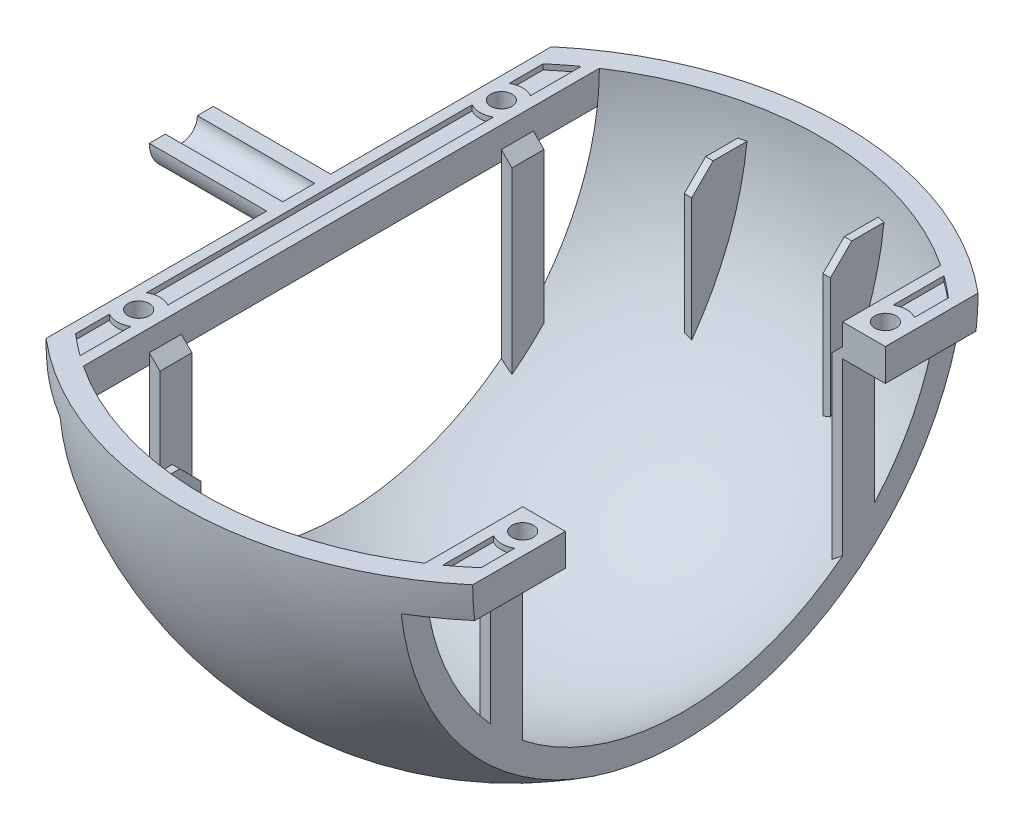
ISO-10303-21;
HEADER;
FILE_DESCRIPTION(('STEP AP214'),'2;1');
FILE_NAME('part.step','',(''),(''),'','','');
FILE_SCHEMA(('AUTOMOTIVE_DESIGN { 1 0 10303 214 1 1 1 1 }'));
ENDSEC;
DATA;
#1=APPLICATION_CONTEXT('core data for automotive mechanical design processes');
#2=APPLICATION_PROTOCOL_DEFINITION('international standard','automotive_design',2000,#1);
#3=PRODUCT_CONTEXT('',#1,'mechanical');
#4=PRODUCT('Part','Part','',(#3));
#5=PRODUCT_RELATED_PRODUCT_CATEGORY('part','',(#4));
#6=PRODUCT_DEFINITION_FORMATION('','',#4);
#7=PRODUCT_DEFINITION_CONTEXT('part definition',#1,'design');
#8=PRODUCT_DEFINITION('design','',#6,#7);
#9=PRODUCT_DEFINITION_SHAPE('','',#8);
#10=(LENGTH_UNIT() NAMED_UNIT(*) SI_UNIT(.MILLI.,.METRE.));
#11=(NAMED_UNIT(*) PLANE_ANGLE_UNIT() SI_UNIT($,.RADIAN.));
#12=(NAMED_UNIT(*) SI_UNIT($,.STERADIAN.) SOLID_ANGLE_UNIT());
#13=UNCERTAINTY_MEASURE_WITH_UNIT(LENGTH_MEASURE(1.E-05),#10,'distance_accuracy_value','');
#14=(GEOMETRIC_REPRESENTATION_CONTEXT(3) GLOBAL_UNCERTAINTY_ASSIGNED_CONTEXT((#13)) GLOBAL_UNIT_ASSIGNED_CONTEXT((#10,
#11,#12)) REPRESENTATION_CONTEXT('',''));
#15=CARTESIAN_POINT('',(0.,0.,0.));
#16=DIRECTION('',(0.,0.,1.));
#17=DIRECTION('',(1.,0.,0.));
#18=AXIS2_PLACEMENT_3D('',#15,#16,#17);
#19=CARTESIAN_POINT('',(0.,0.,0.));
#20=DIRECTION('',(1.,0.,0.));
#21=DIRECTION('',(0.,-1.,0.));
#22=AXIS2_PLACEMENT_3D('',#19,#20,#21);
#23=SPHERICAL_SURFACE('',#22,29.);
#24=CARTESIAN_POINT('',(6.85,0.,0.));
#25=DIRECTION('',(1.,0.,0.));
#26=DIRECTION('',(0.,0.,-1.));
#27=AXIS2_PLACEMENT_3D('',#24,#25,#26);
#28=CIRCLE('',#27,28.1793807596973);
#29=CARTESIAN_POINT('',(6.85,-16.2812008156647,-23.));
#30=VERTEX_POINT('',#29);
#31=CARTESIAN_POINT('',(6.85,-3.00000000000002,-28.0192344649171));
#32=VERTEX_POINT('',#31);
#33=EDGE_CURVE('E640',#30,#32,#28,.T.);
#34=ORIENTED_EDGE('',*,*,#33,.F.);
#35=CARTESIAN_POINT('',(0.,0.,-23.));
#36=DIRECTION('',(0.,0.,1.));
#37=DIRECTION('',(0.,-1.,0.));
#38=AXIS2_PLACEMENT_3D('',#35,#36,#37);
#39=CIRCLE('',#38,17.6635217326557);
#40=CARTESIAN_POINT('',(6.15,-16.5583060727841,-23.));
#41=VERTEX_POINT('',#40);
#42=EDGE_CURVE('E644',#41,#30,#39,.T.);
#43=ORIENTED_EDGE('',*,*,#42,.F.);
#44=CARTESIAN_POINT('',(6.15,0.,0.));
#45=DIRECTION('',(1.,0.,0.));
#46=DIRECTION('',(0.,0.,-1.));
#47=AXIS2_PLACEMENT_3D('',#44,#45,#46);
#48=CIRCLE('',#47,28.3403863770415);
#49=CARTESIAN_POINT('',(6.15,-3.00000000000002,-28.1811550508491));
#50=VERTEX_POINT('',#49);
#51=EDGE_CURVE('E626',#41,#50,#48,.T.);
#52=ORIENTED_EDGE('',*,*,#51,.T.);
#53=CARTESIAN_POINT('',(0.,-2.99999999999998,0.));
#54=DIRECTION('',(0.,1.,0.));
#55=DIRECTION('',(0.,0.,1.));
#56=AXIS2_PLACEMENT_3D('',#53,#54,#55);
#57=CIRCLE('',#56,28.8444102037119);
#58=EDGE_CURVE('E642',#32,#50,#57,.T.);
#59=ORIENTED_EDGE('',*,*,#58,.F.);
#60=EDGE_LOOP('',(#34,#43,#52,#59));
#61=FACE_BOUND('',#60,.T.);
#62=CARTESIAN_POINT('',(-6.85,0.,0.));
#63=DIRECTION('',(-1.,0.,0.));
#64=DIRECTION('',(0.,0.,1.));
#65=AXIS2_PLACEMENT_3D('',#62,#63,#64);
#66=CIRCLE('',#65,28.1793807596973);
#67=CARTESIAN_POINT('',(-6.85,-3.00000000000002,-28.0192344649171));
#68=VERTEX_POINT('',#67);
#69=CARTESIAN_POINT('',(-6.85,-16.2812008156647,-23.));
#70=VERTEX_POINT('',#69);
#71=EDGE_CURVE('E667',#68,#70,#66,.T.);
#72=ORIENTED_EDGE('',*,*,#71,.F.);
#73=CARTESIAN_POINT('',(0.,-2.99999999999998,0.));
#74=DIRECTION('',(0.,-1.,0.));
#75=DIRECTION('',(0.,0.,-1.));
#76=AXIS2_PLACEMENT_3D('',#73,#74,#75);
#77=CIRCLE('',#76,28.8444102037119);
#78=CARTESIAN_POINT('',(-6.15,-3.00000000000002,-28.1811550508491));
#79=VERTEX_POINT('',#78);
#80=EDGE_CURVE('E669',#79,#68,#77,.F.);
#81=ORIENTED_EDGE('',*,*,#80,.F.);
#82=CARTESIAN_POINT('',(-6.15,0.,0.));
#83=DIRECTION('',(-1.,0.,0.));
#84=DIRECTION('',(0.,0.,1.));
#85=AXIS2_PLACEMENT_3D('',#82,#83,#84);
#86=CIRCLE('',#85,28.3403863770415);
#87=CARTESIAN_POINT('',(-6.15,-16.5583060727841,-23.));
#88=VERTEX_POINT('',#87);
#89=EDGE_CURVE('E664',#79,#88,#86,.T.);
#90=ORIENTED_EDGE('',*,*,#89,.T.);
#91=CARTESIAN_POINT('',(0.,0.,-23.));
#92=DIRECTION('',(0.,0.,-1.));
#93=DIRECTION('',(0.,1.,0.));
#94=AXIS2_PLACEMENT_3D('',#91,#92,#93);
#95=CIRCLE('',#94,17.6635217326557);
#96=EDGE_CURVE('E671',#70,#88,#95,.F.);
#97=ORIENTED_EDGE('',*,*,#96,.F.);
#98=EDGE_LOOP('',(#72,#81,#90,#97));
#99=FACE_BOUND('',#98,.T.);
#100=CARTESIAN_POINT('',(6.85,0.,0.));
#101=DIRECTION('',(1.,0.,0.));
#102=DIRECTION('',(0.,0.,-1.));
#103=AXIS2_PLACEMENT_3D('',#100,#101,#102);
#104=CIRCLE('',#103,28.1793807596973);
#105=CARTESIAN_POINT('',(6.85,-3.00000000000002,28.0192344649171));
#106=VERTEX_POINT('',#105);
#107=CARTESIAN_POINT('',(6.85,-16.2812008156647,23.));
#108=VERTEX_POINT('',#107);
#109=EDGE_CURVE('E748',#106,#108,#104,.T.);
#110=ORIENTED_EDGE('',*,*,#109,.F.);
#111=CARTESIAN_POINT('',(0.,-2.99999999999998,0.));
#112=DIRECTION('',(0.,-1.,0.));
#113=DIRECTION('',(0.,0.,-1.));
#114=AXIS2_PLACEMENT_3D('',#111,#112,#113);
#115=CIRCLE('',#114,28.8444102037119);
#116=CARTESIAN_POINT('',(6.15,-3.00000000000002,28.1811550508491));
#117=VERTEX_POINT('',#116);
#118=EDGE_CURVE('E750',#117,#106,#115,.F.);
#119=ORIENTED_EDGE('',*,*,#118,.F.);
#120=CARTESIAN_POINT('',(6.15,0.,0.));
#121=DIRECTION('',(1.,0.,0.));
#122=DIRECTION('',(0.,0.,-1.));
#123=AXIS2_PLACEMENT_3D('',#120,#121,#122);
#124=CIRCLE('',#123,28.3403863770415);
#125=CARTESIAN_POINT('',(6.15,-16.5583060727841,23.));
#126=VERTEX_POINT('',#125);
#127=EDGE_CURVE('E745',#117,#126,#124,.T.);
#128=ORIENTED_EDGE('',*,*,#127,.T.);
#129=CARTESIAN_POINT('',(0.,0.,23.));
#130=DIRECTION('',(0.,0.,1.));
#131=DIRECTION('',(0.,-1.,0.));
#132=AXIS2_PLACEMENT_3D('',#129,#130,#131);
#133=CIRCLE('',#132,17.6635217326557);
#134=EDGE_CURVE('E752',#108,#126,#133,.F.);
#135=ORIENTED_EDGE('',*,*,#134,.F.);
#136=EDGE_LOOP('',(#110,#119,#128,#135));
#137=FACE_BOUND('',#136,.T.);
#138=CARTESIAN_POINT('',(-6.85,0.,0.));
#139=DIRECTION('',(-1.,0.,0.));
#140=DIRECTION('',(0.,0.,1.));
#141=AXIS2_PLACEMENT_3D('',#138,#139,#140);
#142=CIRCLE('',#141,28.1793807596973);
#143=CARTESIAN_POINT('',(-6.85,-16.2812008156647,23.));
#144=VERTEX_POINT('',#143);
#145=CARTESIAN_POINT('',(-6.85,-3.00000000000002,28.0192344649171));
#146=VERTEX_POINT('',#145);
#147=EDGE_CURVE('E718',#144,#146,#142,.T.);
#148=ORIENTED_EDGE('',*,*,#147,.F.);
#149=CARTESIAN_POINT('',(0.,0.,23.));
#150=DIRECTION('',(0.,0.,-1.));
#151=DIRECTION('',(0.,1.,0.));
#152=AXIS2_PLACEMENT_3D('',#149,#150,#151);
#153=CIRCLE('',#152,17.6635217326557);
#154=CARTESIAN_POINT('',(-6.15,-16.5583060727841,23.));
#155=VERTEX_POINT('',#154);
#156=EDGE_CURVE('E723',#155,#144,#153,.T.);
#157=ORIENTED_EDGE('',*,*,#156,.F.);
#158=CARTESIAN_POINT('',(-6.15,0.,0.));
#159=DIRECTION('',(-1.,0.,0.));
#160=DIRECTION('',(0.,0.,1.));
#161=AXIS2_PLACEMENT_3D('',#158,#159,#160);
#162=CIRCLE('',#161,28.3403863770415);
#163=CARTESIAN_POINT('',(-6.15,-3.00000000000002,28.1811550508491));
#164=VERTEX_POINT('',#163);
#165=EDGE_CURVE('E715',#155,#164,#162,.T.);
#166=ORIENTED_EDGE('',*,*,#165,.T.);
#167=CARTESIAN_POINT('',(0.,-2.99999999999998,0.));
#168=DIRECTION('',(0.,1.,0.));
#169=DIRECTION('',(0.,0.,1.));
#170=AXIS2_PLACEMENT_3D('',#167,#168,#169);
#171=CIRCLE('',#170,28.8444102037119);
#172=EDGE_CURVE('E720',#146,#164,#171,.T.);
#173=ORIENTED_EDGE('',*,*,#172,.F.);
#174=EDGE_LOOP('',(#148,#157,#166,#173));
#175=FACE_BOUND('',#174,.T.);
#176=CARTESIAN_POINT('',(-16.,0.,0.));
#177=DIRECTION('',(1.,0.,0.));
#178=DIRECTION('',(0.,0.,-1.));
#179=AXIS2_PLACEMENT_3D('',#176,#177,#178);
#180=CIRCLE('',#179,24.1867732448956);
#181=CARTESIAN_POINT('',(-16.,-16.1554944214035,-18.));
#182=VERTEX_POINT('',#181);
#183=CARTESIAN_POINT('',(-16.,-3.,-24.));
#184=VERTEX_POINT('',#183);
#185=EDGE_CURVE('E850',#182,#184,#180,.T.);
#186=ORIENTED_EDGE('',*,*,#185,.F.);
#187=CARTESIAN_POINT('',(0.,0.,-18.));
#188=DIRECTION('',(0.,0.,1.));
#189=DIRECTION('',(1.,0.,0.));
#190=AXIS2_PLACEMENT_3D('',#187,#188,#189);
#191=CIRCLE('',#190,22.7376340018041);
#192=CARTESIAN_POINT('',(-14.999999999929,-17.0880074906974,-18.));
#193=VERTEX_POINT('',#192);
#194=EDGE_CURVE('E674',#193,#182,#191,.F.);
#195=ORIENTED_EDGE('',*,*,#194,.F.);
#196=CARTESIAN_POINT('',(-15.0000000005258,0.,-4.97379915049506E-10));
#197=DIRECTION('',(-1.,0.,-3.3158661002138E-11));
#198=DIRECTION('',(-3.3158661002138E-11,0.,1.));
#199=AXIS2_PLACEMENT_3D('',#196,#197,#198);
#200=CIRCLE('',#199,24.8193472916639);
#201=CARTESIAN_POINT('',(-15.0000000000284,-19.7737199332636,-15.));
#202=VERTEX_POINT('',#201);
#203=EDGE_CURVE('E677',#202,#193,#200,.F.);
#204=ORIENTED_EDGE('',*,*,#203,.F.);
#205=CARTESIAN_POINT('',(0.,0.,-15.));
#206=DIRECTION('',(0.,0.,-1.));
#207=DIRECTION('',(-1.,0.,0.));
#208=AXIS2_PLACEMENT_3D('',#205,#206,#207);
#209=CIRCLE('',#208,24.8193472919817);
#210=CARTESIAN_POINT('',(-16.,-18.9736659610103,-15.));
#211=VERTEX_POINT('',#210);
#212=EDGE_CURVE('E680',#211,#202,#209,.F.);
#213=ORIENTED_EDGE('',*,*,#212,.F.);
#214=CARTESIAN_POINT('',(-16.,-18.9736659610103,15.));
#215=VERTEX_POINT('',#214);
#216=EDGE_CURVE('E1547',#215,#211,#180,.T.);
#217=ORIENTED_EDGE('',*,*,#216,.F.);
#218=CARTESIAN_POINT('',(0.,0.,15.));
#219=DIRECTION('',(0.,0.,-1.));
#220=DIRECTION('',(-1.,0.,0.));
#221=AXIS2_PLACEMENT_3D('',#218,#219,#220);
#222=CIRCLE('',#221,24.8193472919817);
#223=CARTESIAN_POINT('',(-15.0000000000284,-19.7737199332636,15.));
#224=VERTEX_POINT('',#223);
#225=EDGE_CURVE('E760',#215,#224,#222,.F.);
#226=ORIENTED_EDGE('',*,*,#225,.T.);
#227=CARTESIAN_POINT('',(-15.0000000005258,0.,4.97379915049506E-10));
#228=DIRECTION('',(1.,0.,-3.3158661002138E-11));
#229=DIRECTION('',(-3.3158661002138E-11,0.,-1.));
#230=AXIS2_PLACEMENT_3D('',#227,#228,#229);
#231=CIRCLE('',#230,24.8193472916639);
#232=CARTESIAN_POINT('',(-14.999999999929,-17.0880074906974,18.));
#233=VERTEX_POINT('',#232);
#234=EDGE_CURVE('E759',#224,#233,#231,.F.);
#235=ORIENTED_EDGE('',*,*,#234,.T.);
#236=CARTESIAN_POINT('',(0.,0.,18.));
#237=DIRECTION('',(0.,0.,1.));
#238=DIRECTION('',(1.,0.,0.));
#239=AXIS2_PLACEMENT_3D('',#236,#237,#238);
#240=CIRCLE('',#239,22.7376340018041);
#241=CARTESIAN_POINT('',(-16.,-16.1554944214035,18.));
#242=VERTEX_POINT('',#241);
#243=EDGE_CURVE('E756',#233,#242,#240,.F.);
#244=ORIENTED_EDGE('',*,*,#243,.T.);
#245=CARTESIAN_POINT('',(-16.,-3.,24.));
#246=VERTEX_POINT('',#245);
#247=EDGE_CURVE('E1546',#246,#242,#180,.T.);
#248=ORIENTED_EDGE('',*,*,#247,.F.);
#249=CARTESIAN_POINT('',(-16.,0.,24.1867732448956));
#250=VERTEX_POINT('',#249);
#251=EDGE_CURVE('E903',#250,#246,#180,.T.);
#252=ORIENTED_EDGE('',*,*,#251,.F.);
#253=CARTESIAN_POINT('',(0.,0.,0.));
#254=DIRECTION('',(0.,1.,0.));
#255=DIRECTION('',(0.,0.,1.));
#256=AXIS2_PLACEMENT_3D('',#253,#254,#255);
#257=CIRCLE('',#256,29.);
#258=CARTESIAN_POINT('',(16.,0.,24.1867732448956));
#259=VERTEX_POINT('',#258);
#260=EDGE_CURVE('E892',#259,#250,#257,.F.);
#261=ORIENTED_EDGE('',*,*,#260,.F.);
#262=CARTESIAN_POINT('',(16.,0.,0.));
#263=DIRECTION('',(1.,0.,0.));
#264=DIRECTION('',(0.,0.,-1.));
#265=AXIS2_PLACEMENT_3D('',#262,#263,#264);
#266=CIRCLE('',#265,24.1867732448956);
#267=CARTESIAN_POINT('',(16.,-3.,24.));
#268=VERTEX_POINT('',#267);
#269=EDGE_CURVE('E905',#259,#268,#266,.T.);
#270=ORIENTED_EDGE('',*,*,#269,.T.);
#271=CARTESIAN_POINT('',(16.,-16.1554944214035,18.));
#272=VERTEX_POINT('',#271);
#273=EDGE_CURVE('E1433',#268,#272,#266,.T.);
#274=ORIENTED_EDGE('',*,*,#273,.T.);
#275=CARTESIAN_POINT('',(0.,0.,18.));
#276=DIRECTION('',(0.,0.,-1.));
#277=DIRECTION('',(-1.,0.,0.));
#278=AXIS2_PLACEMENT_3D('',#275,#276,#277);
#279=CIRCLE('',#278,22.7376340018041);
#280=CARTESIAN_POINT('',(15.,-17.0880074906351,18.));
#281=VERTEX_POINT('',#280);
#282=EDGE_CURVE('E1105',#281,#272,#279,.F.);
#283=ORIENTED_EDGE('',*,*,#282,.F.);
#284=CARTESIAN_POINT('',(15.,0.,0.));
#285=DIRECTION('',(1.,0.,0.));
#286=DIRECTION('',(0.,0.,-1.));
#287=AXIS2_PLACEMENT_3D('',#284,#285,#286);
#288=CIRCLE('',#287,24.8193472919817);
#289=CARTESIAN_POINT('',(15.,-19.7737199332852,15.));
#290=VERTEX_POINT('',#289);
#291=EDGE_CURVE('E1108',#290,#281,#288,.F.);
#292=ORIENTED_EDGE('',*,*,#291,.F.);
#293=CARTESIAN_POINT('',(0.,0.,15.));
#294=DIRECTION('',(0.,0.,1.));
#295=DIRECTION('',(1.,0.,0.));
#296=AXIS2_PLACEMENT_3D('',#293,#294,#295);
#297=CIRCLE('',#296,24.8193472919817);
#298=CARTESIAN_POINT('',(16.,-18.9736659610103,15.));
#299=VERTEX_POINT('',#298);
#300=EDGE_CURVE('E1104',#299,#290,#297,.F.);
#301=ORIENTED_EDGE('',*,*,#300,.F.);
#302=CARTESIAN_POINT('',(16.,-18.9736659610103,-15.));
#303=VERTEX_POINT('',#302);
#304=EDGE_CURVE('E904',#299,#303,#266,.T.);
#305=ORIENTED_EDGE('',*,*,#304,.T.);
#306=CARTESIAN_POINT('',(0.,0.,-15.));
#307=DIRECTION('',(0.,0.,1.));
#308=DIRECTION('',(1.,0.,0.));
#309=AXIS2_PLACEMENT_3D('',#306,#307,#308);
#310=CIRCLE('',#309,24.8193472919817);
#311=CARTESIAN_POINT('',(15.,-19.7737199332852,-15.));
#312=VERTEX_POINT('',#311);
#313=EDGE_CURVE('E1020',#303,#312,#310,.F.);
#314=ORIENTED_EDGE('',*,*,#313,.T.);
#315=CARTESIAN_POINT('',(15.,0.,0.));
#316=DIRECTION('',(-1.,0.,0.));
#317=DIRECTION('',(0.,0.,1.));
#318=AXIS2_PLACEMENT_3D('',#315,#316,#317);
#319=CIRCLE('',#318,24.8193472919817);
#320=CARTESIAN_POINT('',(15.,-17.0880074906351,-18.));
#321=VERTEX_POINT('',#320);
#322=EDGE_CURVE('E1022',#312,#321,#319,.F.);
#323=ORIENTED_EDGE('',*,*,#322,.T.);
#324=CARTESIAN_POINT('',(0.,0.,-18.));
#325=DIRECTION('',(0.,0.,-1.));
#326=DIRECTION('',(-1.,0.,0.));
#327=AXIS2_PLACEMENT_3D('',#324,#325,#326);
#328=CIRCLE('',#327,22.7376340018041);
#329=CARTESIAN_POINT('',(16.,-16.1554944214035,-18.));
#330=VERTEX_POINT('',#329);
#331=EDGE_CURVE('E1037',#321,#330,#328,.F.);
#332=ORIENTED_EDGE('',*,*,#331,.T.);
#333=CARTESIAN_POINT('',(16.,-3.,-24.));
#334=VERTEX_POINT('',#333);
#335=EDGE_CURVE('E902',#330,#334,#266,.T.);
#336=ORIENTED_EDGE('',*,*,#335,.T.);
#337=CARTESIAN_POINT('',(16.,0.,-24.1867732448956));
#338=VERTEX_POINT('',#337);
#339=EDGE_CURVE('E899',#334,#338,#266,.T.);
#340=ORIENTED_EDGE('',*,*,#339,.T.);
#341=CARTESIAN_POINT('',(-16.,0.,-24.1867732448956));
#342=VERTEX_POINT('',#341);
#343=EDGE_CURVE('E891',#342,#338,#257,.F.);
#344=ORIENTED_EDGE('',*,*,#343,.F.);
#345=EDGE_CURVE('E906',#184,#342,#180,.T.);
#346=ORIENTED_EDGE('',*,*,#345,.F.);
#347=EDGE_LOOP('',(#186,#195,#204,#213,#217,#226,#235,#244,#248,#252,#261,#270,#274,#283,#292,
#301,#305,#314,#323,#332,#336,#340,#344,#346));
#348=FACE_BOUND('',#347,.T.);
#349=ADVANCED_FACE('F31',(#61,#99,#137,#175,#348),#23,.F.);
#350=CARTESIAN_POINT('',(-16.,0.,0.));
#351=DIRECTION('',(1.,0.,0.));
#352=DIRECTION('',(0.,0.,-1.));
#353=AXIS2_PLACEMENT_3D('',#350,#351,#352);
#354=PLANE('',#353);
#355=DIRECTION('',(0.,0.,-1.));
#356=VECTOR('',#355,1.);
#357=CARTESIAN_POINT('',(-16.,-2.,-18.));
#358=LINE('',#357,#356);
#359=CARTESIAN_POINT('',(-16.,-2.,-15.));
#360=VERTEX_POINT('',#359);
#361=CARTESIAN_POINT('',(-16.,-2.,-18.));
#362=VERTEX_POINT('',#361);
#363=EDGE_CURVE('E673',#360,#362,#358,.T.);
#364=ORIENTED_EDGE('',*,*,#363,.T.);
#365=DIRECTION('',(0.,-1.,0.));
#366=VECTOR('',#365,1.);
#367=CARTESIAN_POINT('',(-16.,0.,-18.));
#368=LINE('',#367,#366);
#369=CARTESIAN_POINT('',(-16.,-3.,-18.));
#370=VERTEX_POINT('',#369);
#371=EDGE_CURVE('E818',#362,#370,#368,.T.);
#372=ORIENTED_EDGE('',*,*,#371,.T.);
#373=DIRECTION('',(0.,0.,1.));
#374=VECTOR('',#373,1.);
#375=CARTESIAN_POINT('',(-16.,-3.,-31.));
#376=LINE('',#375,#374);
#377=EDGE_CURVE('E860',#184,#370,#376,.T.);
#378=ORIENTED_EDGE('',*,*,#377,.F.);
#379=ORIENTED_EDGE('',*,*,#345,.T.);
#380=DIRECTION('',(0.,0.,-1.));
#381=VECTOR('',#380,1.);
#382=CARTESIAN_POINT('',(-16.,0.,37.5162573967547));
#383=LINE('',#382,#381);
#384=EDGE_CURVE('E887',#250,#342,#383,.T.);
#385=ORIENTED_EDGE('',*,*,#384,.F.);
#386=ORIENTED_EDGE('',*,*,#251,.T.);
#387=CARTESIAN_POINT('',(-16.,-3.,18.));
#388=VERTEX_POINT('',#387);
#389=EDGE_CURVE('E862',#388,#246,#376,.T.);
#390=ORIENTED_EDGE('',*,*,#389,.F.);
#391=DIRECTION('',(0.,-1.,0.));
#392=VECTOR('',#391,1.);
#393=CARTESIAN_POINT('',(-16.,0.,18.));
#394=LINE('',#393,#392);
#395=CARTESIAN_POINT('',(-16.,-2.,18.));
#396=VERTEX_POINT('',#395);
#397=EDGE_CURVE('E806',#396,#388,#394,.T.);
#398=ORIENTED_EDGE('',*,*,#397,.F.);
#399=DIRECTION('',(0.,0.,1.));
#400=VECTOR('',#399,1.);
#401=CARTESIAN_POINT('',(-16.,-2.,18.));
#402=LINE('',#401,#400);
#403=CARTESIAN_POINT('',(-16.,-2.,15.));
#404=VERTEX_POINT('',#403);
#405=EDGE_CURVE('E755',#404,#396,#402,.T.);
#406=ORIENTED_EDGE('',*,*,#405,.F.);
#407=DIRECTION('',(0.,1.,0.));
#408=VECTOR('',#407,1.);
#409=CARTESIAN_POINT('',(-16.,0.,15.));
#410=LINE('',#409,#408);
#411=CARTESIAN_POINT('',(-16.,-3.,15.));
#412=VERTEX_POINT('',#411);
#413=EDGE_CURVE('E803',#412,#404,#410,.T.);
#414=ORIENTED_EDGE('',*,*,#413,.F.);
#415=CARTESIAN_POINT('',(-16.,-3.,-15.));
#416=VERTEX_POINT('',#415);
#417=EDGE_CURVE('E833',#416,#412,#376,.T.);
#418=ORIENTED_EDGE('',*,*,#417,.F.);
#419=DIRECTION('',(0.,1.,0.));
#420=VECTOR('',#419,1.);
#421=CARTESIAN_POINT('',(-16.,0.,-15.));
#422=LINE('',#421,#420);
#423=EDGE_CURVE('E815',#416,#360,#422,.T.);
#424=ORIENTED_EDGE('',*,*,#423,.T.);
#425=EDGE_LOOP('',(#364,#372,#378,#379,#385,#386,#390,#398,#406,#414,#418,#424));
#426=FACE_BOUND('',#425,.T.);
#427=ADVANCED_FACE('F830',(#426),#354,.T.);
#428=CARTESIAN_POINT('',(-20.,23.685438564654,0.));
#429=DIRECTION('',(1.,0.,0.));
#430=DIRECTION('',(0.,0.,-1.));
#431=AXIS2_PLACEMENT_3D('',#428,#429,#430);
#432=PLANE('',#431);
#433=CARTESIAN_POINT('',(-20.,0.,0.));
#434=DIRECTION('',(-1.,0.,0.));
#435=DIRECTION('',(0.,0.,1.));
#436=AXIS2_PLACEMENT_3D('',#433,#434,#435);
#437=CIRCLE('',#436,3.);
#438=CARTESIAN_POINT('',(-20.,0.,-3.));
#439=VERTEX_POINT('',#438);
#440=CARTESIAN_POINT('',(-20.,-3.,0.));
#441=VERTEX_POINT('',#440);
#442=EDGE_CURVE('E779',#439,#441,#437,.T.);
#443=ORIENTED_EDGE('',*,*,#442,.F.);
#444=DIRECTION('',(0.,0.,1.));
#445=VECTOR('',#444,1.);
#446=CARTESIAN_POINT('',(-20.,0.,0.));
#447=LINE('',#446,#445);
#448=CARTESIAN_POINT('',(-20.,0.,-23.685438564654));
#449=VERTEX_POINT('',#448);
#450=EDGE_CURVE('E1367',#449,#439,#447,.T.);
#451=ORIENTED_EDGE('',*,*,#450,.F.);
#452=CARTESIAN_POINT('',(-20.,0.,0.));
#453=DIRECTION('',(-1.,0.,0.));
#454=DIRECTION('',(0.,0.,1.));
#455=AXIS2_PLACEMENT_3D('',#452,#453,#454);
#456=CIRCLE('',#455,23.685438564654);
#457=CARTESIAN_POINT('',(-20.,-3.,-23.4946802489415));
#458=VERTEX_POINT('',#457);
#459=EDGE_CURVE('E1451',#449,#458,#456,.T.);
#460=ORIENTED_EDGE('',*,*,#459,.T.);
#461=DIRECTION('',(0.,0.,1.));
#462=VECTOR('',#461,1.);
#463=CARTESIAN_POINT('',(-20.,-3.,0.));
#464=LINE('',#463,#462);
#465=EDGE_CURVE('E1399',#458,#441,#464,.T.);
#466=ORIENTED_EDGE('',*,*,#465,.T.);
#467=EDGE_LOOP('',(#443,#451,#460,#466));
#468=FACE_BOUND('',#467,.T.);
#469=ADVANCED_FACE('F1459',(#468),#432,.F.);
#470=CARTESIAN_POINT('',(-20.,0.,3.));
#471=VERTEX_POINT('',#470);
#472=EDGE_CURVE('E786',#441,#471,#437,.T.);
#473=ORIENTED_EDGE('',*,*,#472,.F.);
#474=CARTESIAN_POINT('',(-20.,-3.,23.4946802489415));
#475=VERTEX_POINT('',#474);
#476=EDGE_CURVE('E1404',#441,#475,#464,.T.);
#477=ORIENTED_EDGE('',*,*,#476,.T.);
#478=CARTESIAN_POINT('',(-20.,0.,23.685438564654));
#479=VERTEX_POINT('',#478);
#480=EDGE_CURVE('E1449',#475,#479,#456,.T.);
#481=ORIENTED_EDGE('',*,*,#480,.T.);
#482=EDGE_CURVE('E1348',#471,#479,#447,.T.);
#483=ORIENTED_EDGE('',*,*,#482,.F.);
#484=EDGE_LOOP('',(#473,#477,#481,#483));
#485=FACE_BOUND('',#484,.T.);
#486=ADVANCED_FACE('F1504',(#485),#432,.F.);
#487=CARTESIAN_POINT('',(-20.,0.,0.));
#488=DIRECTION('',(1.,0.,0.));
#489=DIRECTION('',(0.,0.,1.));
#490=AXIS2_PLACEMENT_3D('',#487,#488,#489);
#491=CIRCLE('',#490,1.5);
#492=CARTESIAN_POINT('',(-20.,0.,1.5));
#493=VERTEX_POINT('',#492);
#494=CARTESIAN_POINT('',(-20.,0.,-1.5));
#495=VERTEX_POINT('',#494);
#496=EDGE_CURVE('E793',#493,#495,#491,.T.);
#497=ORIENTED_EDGE('',*,*,#496,.F.);
#498=EDGE_CURVE('E1372',#495,#493,#447,.T.);
#499=ORIENTED_EDGE('',*,*,#498,.F.);
#500=EDGE_LOOP('',(#497,#499));
#501=FACE_BOUND('',#500,.T.);
#502=ADVANCED_FACE('F1505',(#501),#432,.F.);
#503=CARTESIAN_POINT('',(16.,-24.1867732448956,0.));
#504=DIRECTION('',(-1.,0.,0.));
#505=DIRECTION('',(0.,0.,1.));
#506=AXIS2_PLACEMENT_3D('',#503,#504,#505);
#507=PLANE('',#506);
#508=DIRECTION('',(0.,0.,1.));
#509=VECTOR('',#508,1.);
#510=CARTESIAN_POINT('',(16.,-2.,15.));
#511=LINE('',#510,#509);
#512=CARTESIAN_POINT('',(16.,-2.,15.));
#513=VERTEX_POINT('',#512);
#514=CARTESIAN_POINT('',(16.,-2.,18.));
#515=VERTEX_POINT('',#514);
#516=EDGE_CURVE('E1122',#513,#515,#511,.T.);
#517=ORIENTED_EDGE('',*,*,#516,.T.);
#518=DIRECTION('',(0.,1.,0.));
#519=VECTOR('',#518,1.);
#520=CARTESIAN_POINT('',(16.,-500000.,18.));
#521=LINE('',#520,#519);
#522=CARTESIAN_POINT('',(16.,-3.,18.));
#523=VERTEX_POINT('',#522);
#524=EDGE_CURVE('E1121',#523,#515,#521,.T.);
#525=ORIENTED_EDGE('',*,*,#524,.F.);
#526=DIRECTION('',(0.,0.,1.));
#527=VECTOR('',#526,1.);
#528=CARTESIAN_POINT('',(16.,-3.,-31.));
#529=LINE('',#528,#527);
#530=EDGE_CURVE('E886',#523,#268,#529,.T.);
#531=ORIENTED_EDGE('',*,*,#530,.T.);
#532=ORIENTED_EDGE('',*,*,#269,.F.);
#533=DIRECTION('',(0.,0.,1.));
#534=VECTOR('',#533,1.);
#535=CARTESIAN_POINT('',(16.,0.,37.5162573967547));
#536=LINE('',#535,#534);
#537=CARTESIAN_POINT('',(16.,0.,15.));
#538=VERTEX_POINT('',#537);
#539=EDGE_CURVE('E898',#538,#259,#536,.T.);
#540=ORIENTED_EDGE('',*,*,#539,.F.);
#541=DIRECTION('',(0.,-1.,0.));
#542=VECTOR('',#541,1.);
#543=CARTESIAN_POINT('',(16.,0.,15.));
#544=LINE('',#543,#542);
#545=EDGE_CURVE('E921',#538,#513,#544,.T.);
#546=ORIENTED_EDGE('',*,*,#545,.T.);
#547=EDGE_LOOP('',(#517,#525,#531,#532,#540,#546));
#548=FACE_BOUND('',#547,.T.);
#549=ADVANCED_FACE('F1487',(#548),#507,.T.);
#550=CARTESIAN_POINT('',(20.,-3.,-31.));
#551=DIRECTION('',(0.,1.,0.));
#552=DIRECTION('',(-1.,0.,0.));
#553=AXIS2_PLACEMENT_3D('',#550,#551,#552);
#554=PLANE('',#553);
#555=DIRECTION('',(-1.,0.,0.));
#556=VECTOR('',#555,1.);
#557=CARTESIAN_POINT('',(20.001,-3.,15.));
#558=LINE('',#557,#556);
#559=CARTESIAN_POINT('',(20.,-3.,15.));
#560=VERTEX_POINT('',#559);
#561=CARTESIAN_POINT('',(16.,-3.00000000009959,15.));
#562=VERTEX_POINT('',#561);
#563=EDGE_CURVE('E908',#560,#562,#558,.T.);
#564=ORIENTED_EDGE('',*,*,#563,.F.);
#565=DIRECTION('',(0.,0.,-1.));
#566=VECTOR('',#565,1.);
#567=CARTESIAN_POINT('',(20.,-3.,0.));
#568=LINE('',#567,#566);
#569=CARTESIAN_POINT('',(20.,-3.,23.4946802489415));
#570=VERTEX_POINT('',#569);
#571=EDGE_CURVE('E1401',#570,#560,#568,.T.);
#572=ORIENTED_EDGE('',*,*,#571,.F.);
#573=CARTESIAN_POINT('',(0.,-3.,0.));
#574=DIRECTION('',(0.,1.,0.));
#575=DIRECTION('',(-1.,0.,0.));
#576=AXIS2_PLACEMENT_3D('',#573,#574,#575);
#577=CIRCLE('',#576,30.854497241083);
#578=CARTESIAN_POINT('',(16.,-3.,26.3818119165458));
#579=VERTEX_POINT('',#578);
#580=EDGE_CURVE('E870',#579,#570,#577,.T.);
#581=ORIENTED_EDGE('',*,*,#580,.F.);
#582=EDGE_CURVE('E890',#268,#579,#529,.T.);
#583=ORIENTED_EDGE('',*,*,#582,.F.);
#584=ORIENTED_EDGE('',*,*,#530,.F.);
#585=EDGE_CURVE('E1435',#562,#523,#529,.T.);
#586=ORIENTED_EDGE('',*,*,#585,.F.);
#587=EDGE_LOOP('',(#564,#572,#581,#583,#584,#586));
#588=FACE_BOUND('',#587,.T.);
#589=CARTESIAN_POINT('',(18.,-3.,17.));
#590=DIRECTION('',(0.,1.,0.));
#591=DIRECTION('',(-1.,0.,0.));
#592=AXIS2_PLACEMENT_3D('',#589,#590,#591);
#593=CIRCLE('',#592,1.);
#594=CARTESIAN_POINT('',(17.,-3.,17.));
#595=VERTEX_POINT('',#594);
#596=EDGE_CURVE('E936',#595,#595,#593,.F.);
#597=ORIENTED_EDGE('',*,*,#596,.F.);
#598=EDGE_LOOP('',(#597));
#599=FACE_BOUND('',#598,.T.);
#600=CARTESIAN_POINT('',(18.,-3.,17.));
#601=DIRECTION('',(0.,-1.,0.));
#602=DIRECTION('',(1.,0.,0.));
#603=AXIS2_PLACEMENT_3D('',#600,#601,#602);
#604=CIRCLE('',#603,2.);
#605=CARTESIAN_POINT('',(19.,-3.,18.7320508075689));
#606=VERTEX_POINT('',#605);
#607=CARTESIAN_POINT('',(17.,-3.,18.7320508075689));
#608=VERTEX_POINT('',#607);
#609=EDGE_CURVE('E1101',#606,#608,#604,.T.);
#610=ORIENTED_EDGE('',*,*,#609,.T.);
#611=DIRECTION('',(0.,0.,1.));
#612=VECTOR('',#611,1.);
#613=CARTESIAN_POINT('',(17.,-3.,18.7320508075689));
#614=LINE('',#613,#612);
#615=CARTESIAN_POINT('',(17.,-3.,23.4946802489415));
#616=VERTEX_POINT('',#615);
#617=EDGE_CURVE('E1092',#608,#616,#614,.T.);
#618=ORIENTED_EDGE('',*,*,#617,.T.);
#619=CARTESIAN_POINT('',(0.,-3.,0.));
#620=DIRECTION('',(0.,1.,0.));
#621=DIRECTION('',(1.,0.,0.));
#622=AXIS2_PLACEMENT_3D('',#619,#620,#621);
#623=CIRCLE('',#622,29.);
#624=CARTESIAN_POINT('',(19.,-3.,21.9089023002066));
#625=VERTEX_POINT('',#624);
#626=EDGE_CURVE('E1095',#616,#625,#623,.T.);
#627=ORIENTED_EDGE('',*,*,#626,.T.);
#628=DIRECTION('',(0.,0.,-1.));
#629=VECTOR('',#628,1.);
#630=CARTESIAN_POINT('',(19.,-3.,21.9089023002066));
#631=LINE('',#630,#629);
#632=EDGE_CURVE('E1098',#625,#606,#631,.T.);
#633=ORIENTED_EDGE('',*,*,#632,.T.);
#634=EDGE_LOOP('',(#610,#618,#627,#633));
#635=FACE_BOUND('',#634,.T.);
#636=ADVANCED_FACE('F1443',(#588,#599,#635),#554,.F.);
#637=CARTESIAN_POINT('',(145.467838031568,0.,37.5162573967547));
#638=DIRECTION('',(0.,1.,0.));
#639=DIRECTION('',(0.,0.,1.));
#640=AXIS2_PLACEMENT_3D('',#637,#638,#639);
#641=PLANE('',#640);
#642=CARTESIAN_POINT('',(0.,0.,0.));
#643=DIRECTION('',(0.,1.,0.));
#644=DIRECTION('',(0.,0.,1.));
#645=AXIS2_PLACEMENT_3D('',#642,#643,#644);
#646=CIRCLE('',#645,29.);
#647=CARTESIAN_POINT('',(-17.,0.,-23.4946802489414));
#648=VERTEX_POINT('',#647);
#649=CARTESIAN_POINT('',(-19.,0.,-21.9089023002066));
#650=VERTEX_POINT('',#649);
#651=EDGE_CURVE('E1222',#648,#650,#646,.T.);
#652=ORIENTED_EDGE('',*,*,#651,.F.);
#653=DIRECTION('',(0.,0.,-1.));
#654=VECTOR('',#653,1.);
#655=CARTESIAN_POINT('',(-17.,0.,-18.7320508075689));
#656=LINE('',#655,#654);
#657=CARTESIAN_POINT('',(-17.,0.,-18.7320508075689));
#658=VERTEX_POINT('',#657);
#659=EDGE_CURVE('E1213',#658,#648,#656,.T.);
#660=ORIENTED_EDGE('',*,*,#659,.F.);
#661=CARTESIAN_POINT('',(-18.,0.,-17.));
#662=DIRECTION('',(0.,-1.,0.));
#663=DIRECTION('',(0.,0.,1.));
#664=AXIS2_PLACEMENT_3D('',#661,#662,#663);
#665=CIRCLE('',#664,2.);
#666=CARTESIAN_POINT('',(-19.,0.,-18.7320508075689));
#667=VERTEX_POINT('',#666);
#668=EDGE_CURVE('E1216',#667,#658,#665,.T.);
#669=ORIENTED_EDGE('',*,*,#668,.F.);
#670=DIRECTION('',(0.,0.,1.));
#671=VECTOR('',#670,1.);
#672=CARTESIAN_POINT('',(-19.,0.,-21.9089023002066));
#673=LINE('',#672,#671);
#674=EDGE_CURVE('E1219',#650,#667,#673,.T.);
#675=ORIENTED_EDGE('',*,*,#674,.F.);
#676=EDGE_LOOP('',(#652,#660,#669,#675));
#677=FACE_BOUND('',#676,.T.);
#678=CARTESIAN_POINT('',(0.,0.,0.));
#679=DIRECTION('',(0.,1.,0.));
#680=DIRECTION('',(0.,0.,1.));
#681=AXIS2_PLACEMENT_3D('',#678,#679,#680);
#682=CIRCLE('',#681,29.);
#683=CARTESIAN_POINT('',(-19.,0.,21.9089023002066));
#684=VERTEX_POINT('',#683);
#685=CARTESIAN_POINT('',(-17.,0.,23.4946802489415));
#686=VERTEX_POINT('',#685);
#687=EDGE_CURVE('E1190',#684,#686,#682,.T.);
#688=ORIENTED_EDGE('',*,*,#687,.F.);
#689=DIRECTION('',(0.,0.,1.));
#690=VECTOR('',#689,1.);
#691=CARTESIAN_POINT('',(-19.,0.,18.7320508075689));
#692=LINE('',#691,#690);
#693=CARTESIAN_POINT('',(-19.,0.,18.7320508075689));
#694=VERTEX_POINT('',#693);
#695=EDGE_CURVE('E1181',#694,#684,#692,.T.);
#696=ORIENTED_EDGE('',*,*,#695,.F.);
#697=CARTESIAN_POINT('',(-18.,0.,17.));
#698=DIRECTION('',(0.,-1.,0.));
#699=DIRECTION('',(0.,0.,1.));
#700=AXIS2_PLACEMENT_3D('',#697,#698,#699);
#701=CIRCLE('',#700,2.);
#702=CARTESIAN_POINT('',(-17.,0.,18.7320508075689));
#703=VERTEX_POINT('',#702);
#704=EDGE_CURVE('E1184',#703,#694,#701,.T.);
#705=ORIENTED_EDGE('',*,*,#704,.F.);
#706=DIRECTION('',(0.,0.,-1.));
#707=VECTOR('',#706,1.);
#708=CARTESIAN_POINT('',(-17.,0.,23.4946802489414));
#709=LINE('',#708,#707);
#710=EDGE_CURVE('E1187',#686,#703,#709,.T.);
#711=ORIENTED_EDGE('',*,*,#710,.F.);
#712=EDGE_LOOP('',(#688,#696,#705,#711));
#713=FACE_BOUND('',#712,.T.);
#714=CARTESIAN_POINT('',(-18.,0.,-17.));
#715=DIRECTION('',(0.,-1.,0.));
#716=DIRECTION('',(0.,0.,1.));
#717=AXIS2_PLACEMENT_3D('',#714,#715,#716);
#718=CIRCLE('',#717,2.);
#719=CARTESIAN_POINT('',(-17.,0.,-15.2679491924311));
#720=VERTEX_POINT('',#719);
#721=CARTESIAN_POINT('',(-19.,0.,-15.2679491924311));
#722=VERTEX_POINT('',#721);
#723=EDGE_CURVE('E1158',#720,#722,#718,.T.);
#724=ORIENTED_EDGE('',*,*,#723,.F.);
#725=DIRECTION('',(0.,0.,-1.));
#726=VECTOR('',#725,1.);
#727=CARTESIAN_POINT('',(-17.,0.,15.2679491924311));
#728=LINE('',#727,#726);
#729=CARTESIAN_POINT('',(-17.,0.,15.2679491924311));
#730=VERTEX_POINT('',#729);
#731=EDGE_CURVE('E1149',#730,#720,#728,.T.);
#732=ORIENTED_EDGE('',*,*,#731,.F.);
#733=CARTESIAN_POINT('',(-18.,0.,17.));
#734=DIRECTION('',(0.,-1.,0.));
#735=DIRECTION('',(0.,0.,1.));
#736=AXIS2_PLACEMENT_3D('',#733,#734,#735);
#737=CIRCLE('',#736,2.);
#738=CARTESIAN_POINT('',(-19.,0.,15.2679491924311));
#739=VERTEX_POINT('',#738);
#740=EDGE_CURVE('E1152',#739,#730,#737,.T.);
#741=ORIENTED_EDGE('',*,*,#740,.F.);
#742=DIRECTION('',(0.,0.,1.));
#743=VECTOR('',#742,1.);
#744=CARTESIAN_POINT('',(-19.,0.,-15.2679491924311));
#745=LINE('',#744,#743);
#746=EDGE_CURVE('E1155',#722,#739,#745,.T.);
#747=ORIENTED_EDGE('',*,*,#746,.F.);
#748=EDGE_LOOP('',(#724,#732,#741,#747));
#749=FACE_BOUND('',#748,.T.);
#750=CARTESIAN_POINT('',(-18.,0.,17.));
#751=DIRECTION('',(0.,-1.,0.));
#752=DIRECTION('',(0.,0.,1.));
#753=AXIS2_PLACEMENT_3D('',#750,#751,#752);
#754=CIRCLE('',#753,1.);
#755=CARTESIAN_POINT('',(-18.,0.,18.));
#756=VERTEX_POINT('',#755);
#757=EDGE_CURVE('E946',#756,#756,#754,.T.);
#758=ORIENTED_EDGE('',*,*,#757,.T.);
#759=EDGE_LOOP('',(#758));
#760=FACE_BOUND('',#759,.T.);
#761=DIRECTION('',(0.,0.,-1.));
#762=VECTOR('',#761,1.);
#763=CARTESIAN_POINT('',(20.,0.,0.));
#764=LINE('',#763,#762);
#765=CARTESIAN_POINT('',(20.,0.,23.685438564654));
#766=VERTEX_POINT('',#765);
#767=CARTESIAN_POINT('',(20.,0.,15.));
#768=VERTEX_POINT('',#767);
#769=EDGE_CURVE('E1448',#766,#768,#764,.T.);
#770=ORIENTED_EDGE('',*,*,#769,.T.);
#771=DIRECTION('',(-1.,0.,0.));
#772=VECTOR('',#771,1.);
#773=CARTESIAN_POINT('',(20.001,0.,15.));
#774=LINE('',#773,#772);
#775=EDGE_CURVE('E916',#768,#538,#774,.T.);
#776=ORIENTED_EDGE('',*,*,#775,.T.);
#777=ORIENTED_EDGE('',*,*,#539,.T.);
#778=ORIENTED_EDGE('',*,*,#260,.T.);
#779=ORIENTED_EDGE('',*,*,#384,.T.);
#780=ORIENTED_EDGE('',*,*,#343,.T.);
#781=CARTESIAN_POINT('',(16.,0.,-15.));
#782=VERTEX_POINT('',#781);
#783=EDGE_CURVE('E895',#338,#782,#536,.T.);
#784=ORIENTED_EDGE('',*,*,#783,.T.);
#785=DIRECTION('',(-1.,0.,0.));
#786=VECTOR('',#785,1.);
#787=CARTESIAN_POINT('',(20.001,0.,-15.));
#788=LINE('',#787,#786);
#789=CARTESIAN_POINT('',(20.,0.,-15.));
#790=VERTEX_POINT('',#789);
#791=EDGE_CURVE('E913',#790,#782,#788,.T.);
#792=ORIENTED_EDGE('',*,*,#791,.F.);
#793=CARTESIAN_POINT('',(20.,0.,-23.685438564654));
#794=VERTEX_POINT('',#793);
#795=EDGE_CURVE('E1452',#790,#794,#764,.T.);
#796=ORIENTED_EDGE('',*,*,#795,.T.);
#797=CARTESIAN_POINT('',(0.,0.,0.));
#798=DIRECTION('',(0.,1.,0.));
#799=DIRECTION('',(0.,0.,1.));
#800=AXIS2_PLACEMENT_3D('',#797,#798,#799);
#801=CIRCLE('',#800,31.);
#802=EDGE_CURVE('E1381',#794,#449,#801,.T.);
#803=ORIENTED_EDGE('',*,*,#802,.T.);
#804=ORIENTED_EDGE('',*,*,#450,.T.);
#805=DIRECTION('',(1.,0.,0.));
#806=VECTOR('',#805,1.);
#807=CARTESIAN_POINT('',(-31.,0.,-3.));
#808=LINE('',#807,#806);
#809=CARTESIAN_POINT('',(-31.,0.,-3.));
#810=VERTEX_POINT('',#809);
#811=EDGE_CURVE('E796',#810,#439,#808,.T.);
#812=ORIENTED_EDGE('',*,*,#811,.F.);
#813=DIRECTION('',(0.,0.,-1.));
#814=VECTOR('',#813,1.);
#815=CARTESIAN_POINT('',(-31.,0.,-3.));
#816=LINE('',#815,#814);
#817=CARTESIAN_POINT('',(-31.,0.,-1.5));
#818=VERTEX_POINT('',#817);
#819=EDGE_CURVE('E800',#818,#810,#816,.T.);
#820=ORIENTED_EDGE('',*,*,#819,.F.);
#821=DIRECTION('',(1.,0.,0.));
#822=VECTOR('',#821,1.);
#823=CARTESIAN_POINT('',(-31.,0.,-1.5));
#824=LINE('',#823,#822);
#825=EDGE_CURVE('E799',#818,#495,#824,.T.);
#826=ORIENTED_EDGE('',*,*,#825,.T.);
#827=ORIENTED_EDGE('',*,*,#498,.T.);
#828=DIRECTION('',(1.,0.,0.));
#829=VECTOR('',#828,1.);
#830=CARTESIAN_POINT('',(-31.,0.,1.5));
#831=LINE('',#830,#829);
#832=CARTESIAN_POINT('',(-31.,0.,1.5));
#833=VERTEX_POINT('',#832);
#834=EDGE_CURVE('E1337',#833,#493,#831,.T.);
#835=ORIENTED_EDGE('',*,*,#834,.F.);
#836=DIRECTION('',(0.,0.,-1.));
#837=VECTOR('',#836,1.);
#838=CARTESIAN_POINT('',(-31.,0.,1.5));
#839=LINE('',#838,#837);
#840=CARTESIAN_POINT('',(-31.,0.,3.));
#841=VERTEX_POINT('',#840);
#842=EDGE_CURVE('E1324',#841,#833,#839,.T.);
#843=ORIENTED_EDGE('',*,*,#842,.F.);
#844=DIRECTION('',(1.,0.,0.));
#845=VECTOR('',#844,1.);
#846=CARTESIAN_POINT('',(-31.,0.,3.));
#847=LINE('',#846,#845);
#848=EDGE_CURVE('E1320',#841,#471,#847,.T.);
#849=ORIENTED_EDGE('',*,*,#848,.T.);
#850=ORIENTED_EDGE('',*,*,#482,.T.);
#851=EDGE_CURVE('E1376',#479,#766,#801,.T.);
#852=ORIENTED_EDGE('',*,*,#851,.T.);
#853=EDGE_LOOP('',(#770,#776,#777,#778,#779,#780,#784,#792,#796,#803,#804,#812,#820,#826,#827,
#835,#843,#849,#850,#852));
#854=FACE_BOUND('',#853,.T.);
#855=CARTESIAN_POINT('',(18.,0.,-17.));
#856=DIRECTION('',(0.,1.,0.));
#857=DIRECTION('',(0.,0.,1.));
#858=AXIS2_PLACEMENT_3D('',#855,#856,#857);
#859=CIRCLE('',#858,1.);
#860=CARTESIAN_POINT('',(18.,0.,-16.));
#861=VERTEX_POINT('',#860);
#862=EDGE_CURVE('E933',#861,#861,#859,.T.);
#863=ORIENTED_EDGE('',*,*,#862,.F.);
#864=EDGE_LOOP('',(#863));
#865=FACE_BOUND('',#864,.T.);
#866=CARTESIAN_POINT('',(18.,0.,17.));
#867=DIRECTION('',(0.,1.,0.));
#868=DIRECTION('',(0.,0.,1.));
#869=AXIS2_PLACEMENT_3D('',#866,#867,#868);
#870=CIRCLE('',#869,1.);
#871=CARTESIAN_POINT('',(18.,0.,18.));
#872=VERTEX_POINT('',#871);
#873=EDGE_CURVE('E939',#872,#872,#870,.T.);
#874=ORIENTED_EDGE('',*,*,#873,.F.);
#875=EDGE_LOOP('',(#874));
#876=FACE_BOUND('',#875,.T.);
#877=CARTESIAN_POINT('',(-18.,0.,-17.));
#878=DIRECTION('',(0.,-1.,0.));
#879=DIRECTION('',(0.,0.,1.));
#880=AXIS2_PLACEMENT_3D('',#877,#878,#879);
#881=CIRCLE('',#880,1.);
#882=CARTESIAN_POINT('',(-18.,0.,-16.));
#883=VERTEX_POINT('',#882);
#884=EDGE_CURVE('E942',#883,#883,#881,.T.);
#885=ORIENTED_EDGE('',*,*,#884,.T.);
#886=EDGE_LOOP('',(#885));
#887=FACE_BOUND('',#886,.T.);
#888=CARTESIAN_POINT('',(18.,0.,-17.));
#889=DIRECTION('',(0.,-1.,0.));
#890=DIRECTION('',(0.,0.,1.));
#891=AXIS2_PLACEMENT_3D('',#888,#889,#890);
#892=CIRCLE('',#891,2.);
#893=CARTESIAN_POINT('',(17.,0.,-18.7320508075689));
#894=VERTEX_POINT('',#893);
#895=CARTESIAN_POINT('',(19.,0.,-18.7320508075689));
#896=VERTEX_POINT('',#895);
#897=EDGE_CURVE('E984',#894,#896,#892,.T.);
#898=ORIENTED_EDGE('',*,*,#897,.F.);
#899=DIRECTION('',(0.,0.,1.));
#900=VECTOR('',#899,1.);
#901=CARTESIAN_POINT('',(17.,0.,-23.4946802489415));
#902=LINE('',#901,#900);
#903=CARTESIAN_POINT('',(17.,0.,-23.4946802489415));
#904=VERTEX_POINT('',#903);
#905=EDGE_CURVE('E975',#904,#894,#902,.T.);
#906=ORIENTED_EDGE('',*,*,#905,.F.);
#907=CARTESIAN_POINT('',(0.,0.,0.));
#908=DIRECTION('',(0.,1.,0.));
#909=DIRECTION('',(0.,0.,1.));
#910=AXIS2_PLACEMENT_3D('',#907,#908,#909);
#911=CIRCLE('',#910,29.);
#912=CARTESIAN_POINT('',(19.,0.,-21.9089023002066));
#913=VERTEX_POINT('',#912);
#914=EDGE_CURVE('E978',#913,#904,#911,.T.);
#915=ORIENTED_EDGE('',*,*,#914,.F.);
#916=DIRECTION('',(0.,0.,-1.));
#917=VECTOR('',#916,1.);
#918=CARTESIAN_POINT('',(19.,0.,-18.7320508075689));
#919=LINE('',#918,#917);
#920=EDGE_CURVE('E981',#896,#913,#919,.T.);
#921=ORIENTED_EDGE('',*,*,#920,.F.);
#922=EDGE_LOOP('',(#898,#906,#915,#921));
#923=FACE_BOUND('',#922,.T.);
#924=DIRECTION('',(0.,0.,-1.));
#925=VECTOR('',#924,1.);
#926=CARTESIAN_POINT('',(17.,0.,23.4946802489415));
#927=LINE('',#926,#925);
#928=CARTESIAN_POINT('',(17.,0.,23.4946802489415));
#929=VERTEX_POINT('',#928);
#930=CARTESIAN_POINT('',(17.,0.,18.7320508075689));
#931=VERTEX_POINT('',#930);
#932=EDGE_CURVE('E1067',#929,#931,#927,.T.);
#933=ORIENTED_EDGE('',*,*,#932,.T.);
#934=CARTESIAN_POINT('',(18.,0.,17.));
#935=DIRECTION('',(0.,1.,0.));
#936=DIRECTION('',(0.,0.,-1.));
#937=AXIS2_PLACEMENT_3D('',#934,#935,#936);
#938=CIRCLE('',#937,2.);
#939=CARTESIAN_POINT('',(19.,0.,18.7320508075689));
#940=VERTEX_POINT('',#939);
#941=EDGE_CURVE('E1070',#931,#940,#938,.T.);
#942=ORIENTED_EDGE('',*,*,#941,.T.);
#943=DIRECTION('',(0.,0.,1.));
#944=VECTOR('',#943,1.);
#945=CARTESIAN_POINT('',(19.,0.,18.7320508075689));
#946=LINE('',#945,#944);
#947=CARTESIAN_POINT('',(19.,0.,21.9089023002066));
#948=VERTEX_POINT('',#947);
#949=EDGE_CURVE('E1061',#940,#948,#946,.T.);
#950=ORIENTED_EDGE('',*,*,#949,.T.);
#951=CARTESIAN_POINT('',(0.,0.,0.));
#952=DIRECTION('',(0.,-1.,0.));
#953=DIRECTION('',(0.,0.,-1.));
#954=AXIS2_PLACEMENT_3D('',#951,#952,#953);
#955=CIRCLE('',#954,29.);
#956=EDGE_CURVE('E1064',#948,#929,#955,.T.);
#957=ORIENTED_EDGE('',*,*,#956,.T.);
#958=EDGE_LOOP('',(#933,#942,#950,#957));
#959=FACE_BOUND('',#958,.T.);
#960=ADVANCED_FACE('F1345',(#677,#713,#749,#760,#854,#865,#876,#887,#923,#959),#641,.T.);
#961=CARTESIAN_POINT('',(-20.,-3.,-31.));
#962=DIRECTION('',(0.,1.,0.));
#963=DIRECTION('',(-1.,0.,0.));
#964=AXIS2_PLACEMENT_3D('',#961,#962,#963);
#965=PLANE('',#964);
#966=DIRECTION('',(0.,0.,-1.));
#967=VECTOR('',#966,1.);
#968=CARTESIAN_POINT('',(-19.,-3.,15.2679491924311));
#969=LINE('',#968,#967);
#970=CARTESIAN_POINT('',(-19.,-3.,15.2679491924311));
#971=VERTEX_POINT('',#970);
#972=CARTESIAN_POINT('',(-19.,-3.,-15.2679491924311));
#973=VERTEX_POINT('',#972);
#974=EDGE_CURVE('E1315',#971,#973,#969,.T.);
#975=ORIENTED_EDGE('',*,*,#974,.F.);
#976=CARTESIAN_POINT('',(-18.,-3.,17.));
#977=DIRECTION('',(0.,1.,0.));
#978=DIRECTION('',(1.,0.,0.));
#979=AXIS2_PLACEMENT_3D('',#976,#977,#978);
#980=CIRCLE('',#979,2.);
#981=CARTESIAN_POINT('',(-17.,-3.,15.2679491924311));
#982=VERTEX_POINT('',#981);
#983=EDGE_CURVE('E1318',#982,#971,#980,.T.);
#984=ORIENTED_EDGE('',*,*,#983,.F.);
#985=DIRECTION('',(0.,0.,1.));
#986=VECTOR('',#985,1.);
#987=CARTESIAN_POINT('',(-17.,-3.,-15.2679491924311));
#988=LINE('',#987,#986);
#989=CARTESIAN_POINT('',(-17.,-3.,-15.2679491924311));
#990=VERTEX_POINT('',#989);
#991=EDGE_CURVE('E1309',#990,#982,#988,.T.);
#992=ORIENTED_EDGE('',*,*,#991,.F.);
#993=CARTESIAN_POINT('',(-18.,-3.,-17.));
#994=DIRECTION('',(0.,1.,0.));
#995=DIRECTION('',(1.,0.,0.));
#996=AXIS2_PLACEMENT_3D('',#993,#994,#995);
#997=CIRCLE('',#996,2.);
#998=EDGE_CURVE('E1312',#973,#990,#997,.T.);
#999=ORIENTED_EDGE('',*,*,#998,.F.);
#1000=EDGE_LOOP('',(#975,#984,#992,#999));
#1001=FACE_BOUND('',#1000,.T.);
#1002=DIRECTION('',(0.,0.,-1.));
#1003=VECTOR('',#1002,1.);
#1004=CARTESIAN_POINT('',(-19.,-3.,21.9089023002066));
#1005=LINE('',#1004,#1003);
#1006=CARTESIAN_POINT('',(-19.,-3.,21.9089023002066));
#1007=VERTEX_POINT('',#1006);
#1008=CARTESIAN_POINT('',(-19.,-3.,18.7320508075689));
#1009=VERTEX_POINT('',#1008);
#1010=EDGE_CURVE('E1283',#1007,#1009,#1005,.T.);
#1011=ORIENTED_EDGE('',*,*,#1010,.F.);
#1012=CARTESIAN_POINT('',(0.,-3.00000000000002,0.));
#1013=DIRECTION('',(0.,-1.,0.));
#1014=DIRECTION('',(1.,0.,0.));
#1015=AXIS2_PLACEMENT_3D('',#1012,#1013,#1014);
#1016=CIRCLE('',#1015,29.);
#1017=CARTESIAN_POINT('',(-17.,-3.,23.4946802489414));
#1018=VERTEX_POINT('',#1017);
#1019=EDGE_CURVE('E1286',#1018,#1007,#1016,.T.);
#1020=ORIENTED_EDGE('',*,*,#1019,.F.);
#1021=DIRECTION('',(0.,0.,1.));
#1022=VECTOR('',#1021,1.);
#1023=CARTESIAN_POINT('',(-17.,-3.,18.7320508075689));
#1024=LINE('',#1023,#1022);
#1025=CARTESIAN_POINT('',(-17.,-3.,18.7320508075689));
#1026=VERTEX_POINT('',#1025);
#1027=EDGE_CURVE('E1277',#1026,#1018,#1024,.T.);
#1028=ORIENTED_EDGE('',*,*,#1027,.F.);
#1029=CARTESIAN_POINT('',(-18.,-3.,17.));
#1030=DIRECTION('',(0.,1.,0.));
#1031=DIRECTION('',(1.,0.,0.));
#1032=AXIS2_PLACEMENT_3D('',#1029,#1030,#1031);
#1033=CIRCLE('',#1032,2.);
#1034=EDGE_CURVE('E1280',#1009,#1026,#1033,.T.);
#1035=ORIENTED_EDGE('',*,*,#1034,.F.);
#1036=EDGE_LOOP('',(#1011,#1020,#1028,#1035));
#1037=FACE_BOUND('',#1036,.T.);
#1038=DIRECTION('',(0.,0.,1.));
#1039=VECTOR('',#1038,1.);
#1040=CARTESIAN_POINT('',(-17.,-3.,-23.4946802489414));
#1041=LINE('',#1040,#1039);
#1042=CARTESIAN_POINT('',(-17.,-3.,-23.4946802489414));
#1043=VERTEX_POINT('',#1042);
#1044=CARTESIAN_POINT('',(-17.,-3.,-18.7320508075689));
#1045=VERTEX_POINT('',#1044);
#1046=EDGE_CURVE('E1251',#1043,#1045,#1041,.T.);
#1047=ORIENTED_EDGE('',*,*,#1046,.F.);
#1048=CARTESIAN_POINT('',(0.,-3.00000000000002,0.));
#1049=DIRECTION('',(0.,-1.,0.));
#1050=DIRECTION('',(1.,0.,0.));
#1051=AXIS2_PLACEMENT_3D('',#1048,#1049,#1050);
#1052=CIRCLE('',#1051,29.);
#1053=CARTESIAN_POINT('',(-19.,-3.,-21.9089023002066));
#1054=VERTEX_POINT('',#1053);
#1055=EDGE_CURVE('E1254',#1054,#1043,#1052,.T.);
#1056=ORIENTED_EDGE('',*,*,#1055,.F.);
#1057=DIRECTION('',(0.,0.,-1.));
#1058=VECTOR('',#1057,1.);
#1059=CARTESIAN_POINT('',(-19.,-3.,-18.7320508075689));
#1060=LINE('',#1059,#1058);
#1061=CARTESIAN_POINT('',(-19.,-3.,-18.7320508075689));
#1062=VERTEX_POINT('',#1061);
#1063=EDGE_CURVE('E1245',#1062,#1054,#1060,.T.);
#1064=ORIENTED_EDGE('',*,*,#1063,.F.);
#1065=CARTESIAN_POINT('',(-18.,-3.,-17.));
#1066=DIRECTION('',(0.,1.,0.));
#1067=DIRECTION('',(1.,0.,0.));
#1068=AXIS2_PLACEMENT_3D('',#1065,#1066,#1067);
#1069=CIRCLE('',#1068,2.);
#1070=EDGE_CURVE('E1248',#1045,#1062,#1069,.T.);
#1071=ORIENTED_EDGE('',*,*,#1070,.F.);
#1072=EDGE_LOOP('',(#1047,#1056,#1064,#1071));
#1073=FACE_BOUND('',#1072,.T.);
#1074=CARTESIAN_POINT('',(-18.,-3.,-17.));
#1075=DIRECTION('',(0.,1.,0.));
#1076=DIRECTION('',(-1.,0.,0.));
#1077=AXIS2_PLACEMENT_3D('',#1074,#1075,#1076);
#1078=CIRCLE('',#1077,1.);
#1079=CARTESIAN_POINT('',(-19.,-3.,-17.));
#1080=VERTEX_POINT('',#1079);
#1081=EDGE_CURVE('E943',#1080,#1080,#1078,.T.);
#1082=ORIENTED_EDGE('',*,*,#1081,.T.);
#1083=EDGE_LOOP('',(#1082));
#1084=FACE_BOUND('',#1083,.T.);
#1085=ORIENTED_EDGE('',*,*,#465,.F.);
#1086=CARTESIAN_POINT('',(0.,-3.00000000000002,0.));
#1087=DIRECTION('',(0.,1.,0.));
#1088=DIRECTION('',(-1.,0.,0.));
#1089=AXIS2_PLACEMENT_3D('',#1086,#1087,#1088);
#1090=CIRCLE('',#1089,30.854497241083);
#1091=CARTESIAN_POINT('',(-16.,-3.,-26.3818119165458));
#1092=VERTEX_POINT('',#1091);
#1093=EDGE_CURVE('E1388',#1092,#458,#1090,.T.);
#1094=ORIENTED_EDGE('',*,*,#1093,.F.);
#1095=EDGE_CURVE('E863',#1092,#184,#376,.T.);
#1096=ORIENTED_EDGE('',*,*,#1095,.T.);
#1097=ORIENTED_EDGE('',*,*,#377,.T.);
#1098=EDGE_CURVE('E857',#370,#416,#376,.T.);
#1099=ORIENTED_EDGE('',*,*,#1098,.T.);
#1100=ORIENTED_EDGE('',*,*,#417,.T.);
#1101=EDGE_CURVE('E865',#412,#388,#376,.T.);
#1102=ORIENTED_EDGE('',*,*,#1101,.T.);
#1103=ORIENTED_EDGE('',*,*,#389,.T.);
#1104=CARTESIAN_POINT('',(-16.,-3.,26.3818119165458));
#1105=VERTEX_POINT('',#1104);
#1106=EDGE_CURVE('E864',#246,#1105,#376,.T.);
#1107=ORIENTED_EDGE('',*,*,#1106,.T.);
#1108=EDGE_CURVE('E1385',#475,#1105,#1090,.T.);
#1109=ORIENTED_EDGE('',*,*,#1108,.F.);
#1110=ORIENTED_EDGE('',*,*,#476,.F.);
#1111=EDGE_LOOP('',(#1085,#1094,#1096,#1097,#1099,#1100,#1102,#1103,#1107,#1109,#1110));
#1112=FACE_BOUND('',#1111,.T.);
#1113=CARTESIAN_POINT('',(-18.,-3.,17.));
#1114=DIRECTION('',(0.,1.,0.));
#1115=DIRECTION('',(-1.,0.,0.));
#1116=AXIS2_PLACEMENT_3D('',#1113,#1114,#1115);
#1117=CIRCLE('',#1116,1.);
#1118=CARTESIAN_POINT('',(-19.,-3.,17.));
#1119=VERTEX_POINT('',#1118);
#1120=EDGE_CURVE('E949',#1119,#1119,#1117,.T.);
#1121=ORIENTED_EDGE('',*,*,#1120,.T.);
#1122=EDGE_LOOP('',(#1121));
#1123=FACE_BOUND('',#1122,.T.);
#1124=ADVANCED_FACE('F1395',(#1001,#1037,#1073,#1084,#1112,#1123),#965,.F.);
#1125=CARTESIAN_POINT('',(20.,23.685438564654,0.));
#1126=DIRECTION('',(-1.,0.,0.));
#1127=DIRECTION('',(0.,0.,1.));
#1128=AXIS2_PLACEMENT_3D('',#1125,#1126,#1127);
#1129=PLANE('',#1128);
#1130=DIRECTION('',(0.,1.,0.));
#1131=VECTOR('',#1130,1.);
#1132=CARTESIAN_POINT('',(20.,0.,15.));
#1133=LINE('',#1132,#1131);
#1134=EDGE_CURVE('E924',#560,#768,#1133,.T.);
#1135=ORIENTED_EDGE('',*,*,#1134,.T.);
#1136=ORIENTED_EDGE('',*,*,#769,.F.);
#1137=CARTESIAN_POINT('',(20.,0.,0.));
#1138=DIRECTION('',(-1.,0.,0.));
#1139=DIRECTION('',(0.,0.,1.));
#1140=AXIS2_PLACEMENT_3D('',#1137,#1138,#1139);
#1141=CIRCLE('',#1140,23.685438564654);
#1142=EDGE_CURVE('E1371',#570,#766,#1141,.T.);
#1143=ORIENTED_EDGE('',*,*,#1142,.F.);
#1144=ORIENTED_EDGE('',*,*,#571,.T.);
#1145=EDGE_LOOP('',(#1135,#1136,#1143,#1144));
#1146=FACE_BOUND('',#1145,.T.);
#1147=ADVANCED_FACE('F1446',(#1146),#1129,.F.);
#1148=DIRECTION('',(0.,-1.,0.));
#1149=VECTOR('',#1148,1.);
#1150=CARTESIAN_POINT('',(20.,0.,-15.));
#1151=LINE('',#1150,#1149);
#1152=CARTESIAN_POINT('',(20.,-3.,-15.));
#1153=VERTEX_POINT('',#1152);
#1154=EDGE_CURVE('E927',#790,#1153,#1151,.T.);
#1155=ORIENTED_EDGE('',*,*,#1154,.T.);
#1156=CARTESIAN_POINT('',(20.,-3.,-23.4946802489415));
#1157=VERTEX_POINT('',#1156);
#1158=EDGE_CURVE('E1398',#1153,#1157,#568,.T.);
#1159=ORIENTED_EDGE('',*,*,#1158,.T.);
#1160=EDGE_CURVE('E1377',#794,#1157,#1141,.T.);
#1161=ORIENTED_EDGE('',*,*,#1160,.F.);
#1162=ORIENTED_EDGE('',*,*,#795,.F.);
#1163=EDGE_LOOP('',(#1155,#1159,#1161,#1162));
#1164=FACE_BOUND('',#1163,.T.);
#1165=ADVANCED_FACE('F1456',(#1164),#1129,.F.);
#1166=DIRECTION('',(0.,0.,-1.));
#1167=VECTOR('',#1166,1.);
#1168=CARTESIAN_POINT('',(17.,-3.,-18.7320508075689));
#1169=LINE('',#1168,#1167);
#1170=CARTESIAN_POINT('',(17.,-3.,-18.7320508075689));
#1171=VERTEX_POINT('',#1170);
#1172=CARTESIAN_POINT('',(17.,-3.,-23.4946802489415));
#1173=VERTEX_POINT('',#1172);
#1174=EDGE_CURVE('E1013',#1171,#1173,#1169,.T.);
#1175=ORIENTED_EDGE('',*,*,#1174,.F.);
#1176=CARTESIAN_POINT('',(18.,-3.,-17.));
#1177=DIRECTION('',(0.,1.,0.));
#1178=DIRECTION('',(1.,0.,0.));
#1179=AXIS2_PLACEMENT_3D('',#1176,#1177,#1178);
#1180=CIRCLE('',#1179,2.);
#1181=CARTESIAN_POINT('',(19.,-3.,-18.7320508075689));
#1182=VERTEX_POINT('',#1181);
#1183=EDGE_CURVE('E1016',#1182,#1171,#1180,.T.);
#1184=ORIENTED_EDGE('',*,*,#1183,.F.);
#1185=DIRECTION('',(0.,0.,1.));
#1186=VECTOR('',#1185,1.);
#1187=CARTESIAN_POINT('',(19.,-3.,-21.9089023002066));
#1188=LINE('',#1187,#1186);
#1189=CARTESIAN_POINT('',(19.,-3.,-21.9089023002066));
#1190=VERTEX_POINT('',#1189);
#1191=EDGE_CURVE('E1007',#1190,#1182,#1188,.T.);
#1192=ORIENTED_EDGE('',*,*,#1191,.F.);
#1193=CARTESIAN_POINT('',(0.,-3.,0.));
#1194=DIRECTION('',(0.,-1.,0.));
#1195=DIRECTION('',(1.,0.,0.));
#1196=AXIS2_PLACEMENT_3D('',#1193,#1194,#1195);
#1197=CIRCLE('',#1196,29.);
#1198=EDGE_CURVE('E1010',#1173,#1190,#1197,.T.);
#1199=ORIENTED_EDGE('',*,*,#1198,.F.);
#1200=EDGE_LOOP('',(#1175,#1184,#1192,#1199));
#1201=FACE_BOUND('',#1200,.T.);
#1202=CARTESIAN_POINT('',(18.,-3.,-17.));
#1203=DIRECTION('',(0.,1.,0.));
#1204=DIRECTION('',(-1.,0.,0.));
#1205=AXIS2_PLACEMENT_3D('',#1202,#1203,#1204);
#1206=CIRCLE('',#1205,1.);
#1207=CARTESIAN_POINT('',(17.,-3.,-17.));
#1208=VERTEX_POINT('',#1207);
#1209=EDGE_CURVE('E930',#1208,#1208,#1206,.F.);
#1210=ORIENTED_EDGE('',*,*,#1209,.F.);
#1211=EDGE_LOOP('',(#1210));
#1212=FACE_BOUND('',#1211,.T.);
#1213=DIRECTION('',(-1.,0.,0.));
#1214=VECTOR('',#1213,1.);
#1215=CARTESIAN_POINT('',(20.001,-3.,-15.));
#1216=LINE('',#1215,#1214);
#1217=CARTESIAN_POINT('',(16.,-3.,-15.));
#1218=VERTEX_POINT('',#1217);
#1219=EDGE_CURVE('E911',#1153,#1218,#1216,.T.);
#1220=ORIENTED_EDGE('',*,*,#1219,.T.);
#1221=DIRECTION('',(0.,0.,-1.));
#1222=VECTOR('',#1221,1.);
#1223=CARTESIAN_POINT('',(16.,-3.,-31.));
#1224=LINE('',#1223,#1222);
#1225=CARTESIAN_POINT('',(16.,-3.,-18.));
#1226=VERTEX_POINT('',#1225);
#1227=EDGE_CURVE('E1018',#1218,#1226,#1224,.T.);
#1228=ORIENTED_EDGE('',*,*,#1227,.T.);
#1229=EDGE_CURVE('E885',#334,#1226,#529,.T.);
#1230=ORIENTED_EDGE('',*,*,#1229,.F.);
#1231=CARTESIAN_POINT('',(16.,-3.,-26.3818119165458));
#1232=VERTEX_POINT('',#1231);
#1233=EDGE_CURVE('E881',#1232,#334,#529,.T.);
#1234=ORIENTED_EDGE('',*,*,#1233,.F.);
#1235=EDGE_CURVE('E875',#1157,#1232,#577,.T.);
#1236=ORIENTED_EDGE('',*,*,#1235,.F.);
#1237=ORIENTED_EDGE('',*,*,#1158,.F.);
#1238=EDGE_LOOP('',(#1220,#1228,#1230,#1234,#1236,#1237));
#1239=FACE_BOUND('',#1238,.T.);
#1240=ADVANCED_FACE('F1492',(#1201,#1212,#1239),#554,.F.);
#1241=DIRECTION('',(0.,1.,0.));
#1242=VECTOR('',#1241,1.);
#1243=CARTESIAN_POINT('',(16.,-500000.,-18.));
#1244=LINE('',#1243,#1242);
#1245=CARTESIAN_POINT('',(16.,-2.,-18.));
#1246=VERTEX_POINT('',#1245);
#1247=EDGE_CURVE('E1033',#1226,#1246,#1244,.T.);
#1248=ORIENTED_EDGE('',*,*,#1247,.T.);
#1249=DIRECTION('',(0.,0.,-1.));
#1250=VECTOR('',#1249,1.);
#1251=CARTESIAN_POINT('',(16.,-2.,-15.));
#1252=LINE('',#1251,#1250);
#1253=CARTESIAN_POINT('',(16.,-2.,-15.));
#1254=VERTEX_POINT('',#1253);
#1255=EDGE_CURVE('E1027',#1254,#1246,#1252,.T.);
#1256=ORIENTED_EDGE('',*,*,#1255,.F.);
#1257=DIRECTION('',(0.,1.,0.));
#1258=VECTOR('',#1257,1.);
#1259=CARTESIAN_POINT('',(16.,0.,-15.));
#1260=LINE('',#1259,#1258);
#1261=EDGE_CURVE('E919',#1254,#782,#1260,.T.);
#1262=ORIENTED_EDGE('',*,*,#1261,.T.);
#1263=ORIENTED_EDGE('',*,*,#783,.F.);
#1264=ORIENTED_EDGE('',*,*,#339,.F.);
#1265=ORIENTED_EDGE('',*,*,#1229,.T.);
#1266=EDGE_LOOP('',(#1248,#1256,#1262,#1263,#1264,#1265));
#1267=FACE_BOUND('',#1266,.T.);
#1268=ADVANCED_FACE('F1498',(#1267),#507,.T.);
#1269=CARTESIAN_POINT('',(-16.,-3.,-31.));
#1270=DIRECTION('',(1.,0.,0.));
#1271=DIRECTION('',(0.,1.,0.));
#1272=AXIS2_PLACEMENT_3D('',#1269,#1270,#1271);
#1273=PLANE('',#1272);
#1274=ORIENTED_EDGE('',*,*,#247,.T.);
#1275=DIRECTION('',(0.,1.,0.));
#1276=VECTOR('',#1275,1.);
#1277=CARTESIAN_POINT('',(-16.,-500000.,18.));
#1278=LINE('',#1277,#1276);
#1279=EDGE_CURVE('E769',#242,#388,#1278,.T.);
#1280=ORIENTED_EDGE('',*,*,#1279,.T.);
#1281=ORIENTED_EDGE('',*,*,#1101,.F.);
#1282=DIRECTION('',(0.,1.,0.));
#1283=VECTOR('',#1282,1.);
#1284=CARTESIAN_POINT('',(-16.,-500000.,15.));
#1285=LINE('',#1284,#1283);
#1286=EDGE_CURVE('E763',#215,#412,#1285,.T.);
#1287=ORIENTED_EDGE('',*,*,#1286,.F.);
#1288=ORIENTED_EDGE('',*,*,#216,.T.);
#1289=DIRECTION('',(0.,1.,0.));
#1290=VECTOR('',#1289,1.);
#1291=CARTESIAN_POINT('',(-16.,-500000.,-15.));
#1292=LINE('',#1291,#1290);
#1293=EDGE_CURVE('E684',#211,#416,#1292,.T.);
#1294=ORIENTED_EDGE('',*,*,#1293,.T.);
#1295=ORIENTED_EDGE('',*,*,#1098,.F.);
#1296=DIRECTION('',(0.,1.,0.));
#1297=VECTOR('',#1296,1.);
#1298=CARTESIAN_POINT('',(-16.,-500000.,-18.));
#1299=LINE('',#1298,#1297);
#1300=EDGE_CURVE('E687',#182,#370,#1299,.T.);
#1301=ORIENTED_EDGE('',*,*,#1300,.F.);
#1302=ORIENTED_EDGE('',*,*,#185,.T.);
#1303=ORIENTED_EDGE('',*,*,#1095,.F.);
#1304=CARTESIAN_POINT('',(-16.,0.,0.));
#1305=DIRECTION('',(1.,0.,0.));
#1306=DIRECTION('',(0.,1.,0.));
#1307=AXIS2_PLACEMENT_3D('',#1304,#1305,#1306);
#1308=CIRCLE('',#1307,26.5518360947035);
#1309=EDGE_CURVE('E1397',#1105,#1092,#1308,.T.);
#1310=ORIENTED_EDGE('',*,*,#1309,.F.);
#1311=ORIENTED_EDGE('',*,*,#1106,.F.);
#1312=EDGE_LOOP('',(#1274,#1280,#1281,#1287,#1288,#1294,#1295,#1301,#1302,#1303,#1310,#1311));
#1313=FACE_BOUND('',#1312,.T.);
#1314=ADVANCED_FACE('F854',(#1313),#1273,.F.);
#1315=CARTESIAN_POINT('',(16.,-3.,-31.));
#1316=DIRECTION('',(-1.,0.,0.));
#1317=DIRECTION('',(0.,-1.,0.));
#1318=AXIS2_PLACEMENT_3D('',#1315,#1316,#1317);
#1319=PLANE('',#1318);
#1320=ORIENTED_EDGE('',*,*,#273,.F.);
#1321=ORIENTED_EDGE('',*,*,#582,.T.);
#1322=CARTESIAN_POINT('',(16.,0.,0.));
#1323=DIRECTION('',(-1.,0.,0.));
#1324=DIRECTION('',(0.,-1.,0.));
#1325=AXIS2_PLACEMENT_3D('',#1322,#1323,#1324);
#1326=CIRCLE('',#1325,26.5518360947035);
#1327=EDGE_CURVE('E1409',#1232,#579,#1326,.T.);
#1328=ORIENTED_EDGE('',*,*,#1327,.F.);
#1329=ORIENTED_EDGE('',*,*,#1233,.T.);
#1330=ORIENTED_EDGE('',*,*,#335,.F.);
#1331=EDGE_CURVE('E1034',#330,#1226,#1244,.T.);
#1332=ORIENTED_EDGE('',*,*,#1331,.T.);
#1333=ORIENTED_EDGE('',*,*,#1227,.F.);
#1334=DIRECTION('',(0.,1.,0.));
#1335=VECTOR('',#1334,1.);
#1336=CARTESIAN_POINT('',(16.,-500000.,-15.));
#1337=LINE('',#1336,#1335);
#1338=EDGE_CURVE('E1023',#303,#1218,#1337,.T.);
#1339=ORIENTED_EDGE('',*,*,#1338,.F.);
#1340=ORIENTED_EDGE('',*,*,#304,.F.);
#1341=DIRECTION('',(0.,1.,0.));
#1342=VECTOR('',#1341,1.);
#1343=CARTESIAN_POINT('',(16.,-500000.,15.));
#1344=LINE('',#1343,#1342);
#1345=EDGE_CURVE('E1109',#299,#562,#1344,.T.);
#1346=ORIENTED_EDGE('',*,*,#1345,.T.);
#1347=ORIENTED_EDGE('',*,*,#585,.T.);
#1348=EDGE_CURVE('E1118',#272,#523,#521,.T.);
#1349=ORIENTED_EDGE('',*,*,#1348,.F.);
#1350=EDGE_LOOP('',(#1320,#1321,#1328,#1329,#1330,#1332,#1333,#1339,#1340,#1346,#1347,#1349));
#1351=FACE_BOUND('',#1350,.T.);
#1352=ADVANCED_FACE('F1432',(#1351),#1319,.F.);
#1353=CARTESIAN_POINT('',(0.,0.,0.));
#1354=DIRECTION('',(-1.,0.,0.));
#1355=DIRECTION('',(0.,1.,0.));
#1356=AXIS2_PLACEMENT_3D('',#1353,#1354,#1355);
#1357=SPHERICAL_SURFACE('',#1356,31.);
#1358=ORIENTED_EDGE('',*,*,#1327,.T.);
#1359=ORIENTED_EDGE('',*,*,#580,.T.);
#1360=ORIENTED_EDGE('',*,*,#1142,.T.);
#1361=ORIENTED_EDGE('',*,*,#851,.F.);
#1362=ORIENTED_EDGE('',*,*,#480,.F.);
#1363=ORIENTED_EDGE('',*,*,#1108,.T.);
#1364=ORIENTED_EDGE('',*,*,#1309,.T.);
#1365=ORIENTED_EDGE('',*,*,#1093,.T.);
#1366=ORIENTED_EDGE('',*,*,#459,.F.);
#1367=ORIENTED_EDGE('',*,*,#802,.F.);
#1368=ORIENTED_EDGE('',*,*,#1160,.T.);
#1369=ORIENTED_EDGE('',*,*,#1235,.T.);
#1370=EDGE_LOOP('',(#1358,#1359,#1360,#1361,#1362,#1363,#1364,#1365,#1366,#1367,#1368,#1369));
#1371=FACE_BOUND('',#1370,.T.);
#1372=ADVANCED_FACE('F33',(#1371),#1357,.T.);
#1373=CARTESIAN_POINT('',(20.001,0.,-15.));
#1374=DIRECTION('',(0.,0.,1.));
#1375=DIRECTION('',(1.,0.,0.));
#1376=AXIS2_PLACEMENT_3D('',#1373,#1374,#1375);
#1377=PLANE('',#1376);
#1378=ORIENTED_EDGE('',*,*,#1261,.F.);
#1379=DIRECTION('',(0.707106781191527,0.707106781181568,0.));
#1380=VECTOR('',#1379,1.);
#1381=CARTESIAN_POINT('',(19.0005000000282,1.00049999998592,-15.));
#1382=LINE('',#1381,#1380);
#1383=CARTESIAN_POINT('',(15.,-3.00000000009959,-15.));
#1384=VERTEX_POINT('',#1383);
#1385=EDGE_CURVE('E1411',#1254,#1384,#1382,.F.);
#1386=ORIENTED_EDGE('',*,*,#1385,.T.);
#1387=DIRECTION('',(0.,1.,0.));
#1388=VECTOR('',#1387,1.);
#1389=CARTESIAN_POINT('',(15.,-500000.,-15.));
#1390=LINE('',#1389,#1388);
#1391=EDGE_CURVE('E1026',#312,#1384,#1390,.T.);
#1392=ORIENTED_EDGE('',*,*,#1391,.F.);
#1393=ORIENTED_EDGE('',*,*,#313,.F.);
#1394=ORIENTED_EDGE('',*,*,#1338,.T.);
#1395=ORIENTED_EDGE('',*,*,#1219,.F.);
#1396=ORIENTED_EDGE('',*,*,#1154,.F.);
#1397=ORIENTED_EDGE('',*,*,#791,.T.);
#1398=EDGE_LOOP('',(#1378,#1386,#1392,#1393,#1394,#1395,#1396,#1397));
#1399=FACE_BOUND('',#1398,.T.);
#1400=ADVANCED_FACE('F1537',(#1399),#1377,.T.);
#1401=CARTESIAN_POINT('',(20.001,0.,15.));
#1402=DIRECTION('',(0.,0.,-1.));
#1403=DIRECTION('',(-1.,0.,0.));
#1404=AXIS2_PLACEMENT_3D('',#1401,#1402,#1403);
#1405=PLANE('',#1404);
#1406=DIRECTION('',(0.,1.,0.));
#1407=VECTOR('',#1406,1.);
#1408=CARTESIAN_POINT('',(15.,-500000.,15.));
#1409=LINE('',#1408,#1407);
#1410=CARTESIAN_POINT('',(15.0000000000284,-2.99999999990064,15.));
#1411=VERTEX_POINT('',#1410);
#1412=EDGE_CURVE('E1112',#290,#1411,#1409,.T.);
#1413=ORIENTED_EDGE('',*,*,#1412,.T.);
#1414=DIRECTION('',(0.707106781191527,0.707106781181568,0.));
#1415=VECTOR('',#1414,1.);
#1416=CARTESIAN_POINT('',(19.0005000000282,1.00049999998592,15.));
#1417=LINE('',#1416,#1415);
#1418=EDGE_CURVE('E1357',#1411,#513,#1417,.T.);
#1419=ORIENTED_EDGE('',*,*,#1418,.T.);
#1420=ORIENTED_EDGE('',*,*,#545,.F.);
#1421=ORIENTED_EDGE('',*,*,#775,.F.);
#1422=ORIENTED_EDGE('',*,*,#1134,.F.);
#1423=ORIENTED_EDGE('',*,*,#563,.T.);
#1424=ORIENTED_EDGE('',*,*,#1345,.F.);
#1425=ORIENTED_EDGE('',*,*,#300,.T.);
#1426=EDGE_LOOP('',(#1413,#1419,#1420,#1421,#1422,#1423,#1424,#1425));
#1427=FACE_BOUND('',#1426,.T.);
#1428=ADVANCED_FACE('F1423',(#1427),#1405,.T.);
#1429=CARTESIAN_POINT('',(18.,-31.001,-17.));
#1430=DIRECTION('',(0.,1.,0.));
#1431=DIRECTION('',(0.,0.,1.));
#1432=AXIS2_PLACEMENT_3D('',#1429,#1430,#1431);
#1433=CYLINDRICAL_SURFACE('',#1432,1.);
#1434=ORIENTED_EDGE('',*,*,#862,.T.);
#1435=EDGE_LOOP('',(#1434));
#1436=FACE_BOUND('',#1435,.T.);
#1437=ORIENTED_EDGE('',*,*,#1209,.T.);
#1438=EDGE_LOOP('',(#1437));
#1439=FACE_BOUND('',#1438,.T.);
#1440=ADVANCED_FACE('F2061',(#1436,#1439),#1433,.F.);
#1441=CARTESIAN_POINT('',(18.,-31.001,17.));
#1442=DIRECTION('',(0.,1.,0.));
#1443=DIRECTION('',(0.,0.,1.));
#1444=AXIS2_PLACEMENT_3D('',#1441,#1442,#1443);
#1445=CYLINDRICAL_SURFACE('',#1444,1.);
#1446=ORIENTED_EDGE('',*,*,#873,.T.);
#1447=EDGE_LOOP('',(#1446));
#1448=FACE_BOUND('',#1447,.T.);
#1449=ORIENTED_EDGE('',*,*,#596,.T.);
#1450=EDGE_LOOP('',(#1449));
#1451=FACE_BOUND('',#1450,.T.);
#1452=ADVANCED_FACE('F2293',(#1448,#1451),#1445,.F.);
#1453=CARTESIAN_POINT('',(-18.,-31.001,-17.));
#1454=DIRECTION('',(0.,1.,0.));
#1455=DIRECTION('',(0.,0.,1.));
#1456=AXIS2_PLACEMENT_3D('',#1453,#1454,#1455);
#1457=CYLINDRICAL_SURFACE('',#1456,1.);
#1458=ORIENTED_EDGE('',*,*,#884,.F.);
#1459=EDGE_LOOP('',(#1458));
#1460=FACE_BOUND('',#1459,.T.);
#1461=ORIENTED_EDGE('',*,*,#1081,.F.);
#1462=EDGE_LOOP('',(#1461));
#1463=FACE_BOUND('',#1462,.T.);
#1464=ADVANCED_FACE('F2284',(#1460,#1463),#1457,.F.);
#1465=CARTESIAN_POINT('',(-18.,-31.001,17.));
#1466=DIRECTION('',(0.,1.,0.));
#1467=DIRECTION('',(0.,0.,1.));
#1468=AXIS2_PLACEMENT_3D('',#1465,#1466,#1467);
#1469=CYLINDRICAL_SURFACE('',#1468,1.);
#1470=ORIENTED_EDGE('',*,*,#757,.F.);
#1471=EDGE_LOOP('',(#1470));
#1472=FACE_BOUND('',#1471,.T.);
#1473=ORIENTED_EDGE('',*,*,#1120,.F.);
#1474=EDGE_LOOP('',(#1473));
#1475=FACE_BOUND('',#1474,.T.);
#1476=ADVANCED_FACE('F2275',(#1472,#1475),#1469,.F.);
#1477=CARTESIAN_POINT('',(18.,-0.5,-17.));
#1478=DIRECTION('',(0.,1.,0.));
#1479=DIRECTION('',(0.,0.,1.));
#1480=AXIS2_PLACEMENT_3D('',#1477,#1478,#1479);
#1481=CYLINDRICAL_SURFACE('',#1480,2.);
#1482=ORIENTED_EDGE('',*,*,#897,.T.);
#1483=DIRECTION('',(0.,1.,0.));
#1484=VECTOR('',#1483,1.);
#1485=CARTESIAN_POINT('',(19.,-0.5,-18.7320508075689));
#1486=LINE('',#1485,#1484);
#1487=CARTESIAN_POINT('',(19.,-0.5,-18.7320508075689));
#1488=VERTEX_POINT('',#1487);
#1489=EDGE_CURVE('E955',#1488,#896,#1486,.T.);
#1490=ORIENTED_EDGE('',*,*,#1489,.F.);
#1491=CARTESIAN_POINT('',(18.,-0.5,-17.));
#1492=DIRECTION('',(0.,-1.,0.));
#1493=DIRECTION('',(0.,0.,1.));
#1494=AXIS2_PLACEMENT_3D('',#1491,#1492,#1493);
#1495=CIRCLE('',#1494,2.);
#1496=CARTESIAN_POINT('',(17.,-0.5,-18.7320508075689));
#1497=VERTEX_POINT('',#1496);
#1498=EDGE_CURVE('E972',#1497,#1488,#1495,.T.);
#1499=ORIENTED_EDGE('',*,*,#1498,.F.);
#1500=DIRECTION('',(0.,1.,0.));
#1501=VECTOR('',#1500,1.);
#1502=CARTESIAN_POINT('',(17.,-0.5,-18.7320508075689));
#1503=LINE('',#1502,#1501);
#1504=EDGE_CURVE('E952',#1497,#894,#1503,.T.);
#1505=ORIENTED_EDGE('',*,*,#1504,.T.);
#1506=EDGE_LOOP('',(#1482,#1490,#1499,#1505));
#1507=FACE_BOUND('',#1506,.T.);
#1508=ADVANCED_FACE('F2266',(#1507),#1481,.T.);
#1509=CARTESIAN_POINT('',(17.,-0.5,-23.4946802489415));
#1510=DIRECTION('',(-1.,0.,0.));
#1511=DIRECTION('',(0.,0.,1.));
#1512=AXIS2_PLACEMENT_3D('',#1509,#1510,#1511);
#1513=PLANE('',#1512);
#1514=ORIENTED_EDGE('',*,*,#905,.T.);
#1515=ORIENTED_EDGE('',*,*,#1504,.F.);
#1516=DIRECTION('',(0.,0.,1.));
#1517=VECTOR('',#1516,1.);
#1518=CARTESIAN_POINT('',(17.,-0.5,-23.4946802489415));
#1519=LINE('',#1518,#1517);
#1520=CARTESIAN_POINT('',(17.,-0.5,-23.4946802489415));
#1521=VERTEX_POINT('',#1520);
#1522=EDGE_CURVE('E959',#1521,#1497,#1519,.T.);
#1523=ORIENTED_EDGE('',*,*,#1522,.F.);
#1524=DIRECTION('',(0.,1.,0.));
#1525=VECTOR('',#1524,1.);
#1526=CARTESIAN_POINT('',(17.,-0.5,-23.4946802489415));
#1527=LINE('',#1526,#1525);
#1528=EDGE_CURVE('E961',#1521,#904,#1527,.T.);
#1529=ORIENTED_EDGE('',*,*,#1528,.T.);
#1530=EDGE_LOOP('',(#1514,#1515,#1523,#1529));
#1531=FACE_BOUND('',#1530,.T.);
#1532=ADVANCED_FACE('F2257',(#1531),#1513,.F.);
#1533=CARTESIAN_POINT('',(0.,-0.5,0.));
#1534=DIRECTION('',(0.,1.,0.));
#1535=DIRECTION('',(0.,0.,1.));
#1536=AXIS2_PLACEMENT_3D('',#1533,#1534,#1535);
#1537=CYLINDRICAL_SURFACE('',#1536,29.);
#1538=ORIENTED_EDGE('',*,*,#914,.T.);
#1539=ORIENTED_EDGE('',*,*,#1528,.F.);
#1540=CARTESIAN_POINT('',(0.,-0.5,0.));
#1541=DIRECTION('',(0.,1.,0.));
#1542=DIRECTION('',(0.,0.,1.));
#1543=AXIS2_PLACEMENT_3D('',#1540,#1541,#1542);
#1544=CIRCLE('',#1543,29.);
#1545=CARTESIAN_POINT('',(19.,-0.5,-21.9089023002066));
#1546=VERTEX_POINT('',#1545);
#1547=EDGE_CURVE('E966',#1546,#1521,#1544,.T.);
#1548=ORIENTED_EDGE('',*,*,#1547,.F.);
#1549=DIRECTION('',(0.,1.,0.));
#1550=VECTOR('',#1549,1.);
#1551=CARTESIAN_POINT('',(19.,-0.5,-21.9089023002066));
#1552=LINE('',#1551,#1550);
#1553=EDGE_CURVE('E958',#1546,#913,#1552,.T.);
#1554=ORIENTED_EDGE('',*,*,#1553,.T.);
#1555=EDGE_LOOP('',(#1538,#1539,#1548,#1554));
#1556=FACE_BOUND('',#1555,.T.);
#1557=ADVANCED_FACE('F2248',(#1556),#1537,.F.);
#1558=CARTESIAN_POINT('',(19.,-0.5,-18.7320508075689));
#1559=DIRECTION('',(1.,0.,0.));
#1560=DIRECTION('',(0.,0.,-1.));
#1561=AXIS2_PLACEMENT_3D('',#1558,#1559,#1560);
#1562=PLANE('',#1561);
#1563=ORIENTED_EDGE('',*,*,#920,.T.);
#1564=ORIENTED_EDGE('',*,*,#1553,.F.);
#1565=DIRECTION('',(0.,0.,-1.));
#1566=VECTOR('',#1565,1.);
#1567=CARTESIAN_POINT('',(19.,-0.5,-18.7320508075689));
#1568=LINE('',#1567,#1566);
#1569=EDGE_CURVE('E969',#1488,#1546,#1568,.T.);
#1570=ORIENTED_EDGE('',*,*,#1569,.F.);
#1571=ORIENTED_EDGE('',*,*,#1489,.T.);
#1572=EDGE_LOOP('',(#1563,#1564,#1570,#1571));
#1573=FACE_BOUND('',#1572,.T.);
#1574=ADVANCED_FACE('F2239',(#1573),#1562,.F.);
#1575=CARTESIAN_POINT('',(18.,-0.5,-17.));
#1576=DIRECTION('',(0.,1.,0.));
#1577=DIRECTION('',(0.,0.,1.));
#1578=AXIS2_PLACEMENT_3D('',#1575,#1576,#1577);
#1579=PLANE('',#1578);
#1580=ORIENTED_EDGE('',*,*,#1498,.T.);
#1581=ORIENTED_EDGE('',*,*,#1569,.T.);
#1582=ORIENTED_EDGE('',*,*,#1547,.T.);
#1583=ORIENTED_EDGE('',*,*,#1522,.T.);
#1584=EDGE_LOOP('',(#1580,#1581,#1582,#1583));
#1585=FACE_BOUND('',#1584,.T.);
#1586=ADVANCED_FACE('F2230',(#1585),#1579,.T.);
#1587=CARTESIAN_POINT('',(18.,-2.5,-17.));
#1588=DIRECTION('',(0.,-1.,0.));
#1589=DIRECTION('',(1.,0.,0.));
#1590=AXIS2_PLACEMENT_3D('',#1587,#1588,#1589);
#1591=CYLINDRICAL_SURFACE('',#1590,2.);
#1592=ORIENTED_EDGE('',*,*,#1183,.T.);
#1593=DIRECTION('',(0.,-1.,0.));
#1594=VECTOR('',#1593,1.);
#1595=CARTESIAN_POINT('',(17.,-2.5,-18.7320508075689));
#1596=LINE('',#1595,#1594);
#1597=CARTESIAN_POINT('',(17.,-2.5,-18.7320508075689));
#1598=VERTEX_POINT('',#1597);
#1599=EDGE_CURVE('E987',#1598,#1171,#1596,.T.);
#1600=ORIENTED_EDGE('',*,*,#1599,.F.);
#1601=CARTESIAN_POINT('',(18.,-2.5,-17.));
#1602=DIRECTION('',(0.,1.,0.));
#1603=DIRECTION('',(1.,0.,0.));
#1604=AXIS2_PLACEMENT_3D('',#1601,#1602,#1603);
#1605=CIRCLE('',#1604,2.);
#1606=CARTESIAN_POINT('',(19.,-2.5,-18.7320508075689));
#1607=VERTEX_POINT('',#1606);
#1608=EDGE_CURVE('E1004',#1607,#1598,#1605,.T.);
#1609=ORIENTED_EDGE('',*,*,#1608,.F.);
#1610=DIRECTION('',(0.,-1.,0.));
#1611=VECTOR('',#1610,1.);
#1612=CARTESIAN_POINT('',(19.,-2.5,-18.7320508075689));
#1613=LINE('',#1612,#1611);
#1614=EDGE_CURVE('E986',#1607,#1182,#1613,.T.);
#1615=ORIENTED_EDGE('',*,*,#1614,.T.);
#1616=EDGE_LOOP('',(#1592,#1600,#1609,#1615));
#1617=FACE_BOUND('',#1616,.T.);
#1618=ADVANCED_FACE('F2221',(#1617),#1591,.T.);
#1619=CARTESIAN_POINT('',(19.,-2.5,-21.9089023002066));
#1620=DIRECTION('',(1.,0.,0.));
#1621=DIRECTION('',(0.,1.,0.));
#1622=AXIS2_PLACEMENT_3D('',#1619,#1620,#1621);
#1623=PLANE('',#1622);
#1624=ORIENTED_EDGE('',*,*,#1191,.T.);
#1625=ORIENTED_EDGE('',*,*,#1614,.F.);
#1626=DIRECTION('',(0.,0.,1.));
#1627=VECTOR('',#1626,1.);
#1628=CARTESIAN_POINT('',(19.,-2.5,-21.9089023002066));
#1629=LINE('',#1628,#1627);
#1630=CARTESIAN_POINT('',(19.,-2.5,-21.9089023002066));
#1631=VERTEX_POINT('',#1630);
#1632=EDGE_CURVE('E991',#1631,#1607,#1629,.T.);
#1633=ORIENTED_EDGE('',*,*,#1632,.F.);
#1634=DIRECTION('',(0.,-1.,0.));
#1635=VECTOR('',#1634,1.);
#1636=CARTESIAN_POINT('',(19.,-2.5,-21.9089023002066));
#1637=LINE('',#1636,#1635);
#1638=EDGE_CURVE('E993',#1631,#1190,#1637,.T.);
#1639=ORIENTED_EDGE('',*,*,#1638,.T.);
#1640=EDGE_LOOP('',(#1624,#1625,#1633,#1639));
#1641=FACE_BOUND('',#1640,.T.);
#1642=ADVANCED_FACE('F2212',(#1641),#1623,.F.);
#1643=CARTESIAN_POINT('',(0.,-2.5,0.));
#1644=DIRECTION('',(0.,-1.,0.));
#1645=DIRECTION('',(1.,0.,0.));
#1646=AXIS2_PLACEMENT_3D('',#1643,#1644,#1645);
#1647=CYLINDRICAL_SURFACE('',#1646,29.);
#1648=ORIENTED_EDGE('',*,*,#1198,.T.);
#1649=ORIENTED_EDGE('',*,*,#1638,.F.);
#1650=CARTESIAN_POINT('',(0.,-2.5,0.));
#1651=DIRECTION('',(0.,-1.,0.));
#1652=DIRECTION('',(1.,0.,0.));
#1653=AXIS2_PLACEMENT_3D('',#1650,#1651,#1652);
#1654=CIRCLE('',#1653,29.);
#1655=CARTESIAN_POINT('',(17.,-2.5,-23.4946802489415));
#1656=VERTEX_POINT('',#1655);
#1657=EDGE_CURVE('E998',#1656,#1631,#1654,.T.);
#1658=ORIENTED_EDGE('',*,*,#1657,.F.);
#1659=DIRECTION('',(0.,-1.,0.));
#1660=VECTOR('',#1659,1.);
#1661=CARTESIAN_POINT('',(17.,-2.5,-23.4946802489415));
#1662=LINE('',#1661,#1660);
#1663=EDGE_CURVE('E990',#1656,#1173,#1662,.T.);
#1664=ORIENTED_EDGE('',*,*,#1663,.T.);
#1665=EDGE_LOOP('',(#1648,#1649,#1658,#1664));
#1666=FACE_BOUND('',#1665,.T.);
#1667=ADVANCED_FACE('F2203',(#1666),#1647,.F.);
#1668=CARTESIAN_POINT('',(17.,-2.5,-18.7320508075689));
#1669=DIRECTION('',(-1.,0.,0.));
#1670=DIRECTION('',(0.,0.,1.));
#1671=AXIS2_PLACEMENT_3D('',#1668,#1669,#1670);
#1672=PLANE('',#1671);
#1673=ORIENTED_EDGE('',*,*,#1174,.T.);
#1674=ORIENTED_EDGE('',*,*,#1663,.F.);
#1675=DIRECTION('',(0.,0.,-1.));
#1676=VECTOR('',#1675,1.);
#1677=CARTESIAN_POINT('',(17.,-2.5,-18.7320508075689));
#1678=LINE('',#1677,#1676);
#1679=EDGE_CURVE('E1001',#1598,#1656,#1678,.T.);
#1680=ORIENTED_EDGE('',*,*,#1679,.F.);
#1681=ORIENTED_EDGE('',*,*,#1599,.T.);
#1682=EDGE_LOOP('',(#1673,#1674,#1680,#1681));
#1683=FACE_BOUND('',#1682,.T.);
#1684=ADVANCED_FACE('F2194',(#1683),#1672,.F.);
#1685=CARTESIAN_POINT('',(18.,-2.5,-17.));
#1686=DIRECTION('',(0.,-1.,0.));
#1687=DIRECTION('',(1.,0.,0.));
#1688=AXIS2_PLACEMENT_3D('',#1685,#1686,#1687);
#1689=PLANE('',#1688);
#1690=ORIENTED_EDGE('',*,*,#1608,.T.);
#1691=ORIENTED_EDGE('',*,*,#1679,.T.);
#1692=ORIENTED_EDGE('',*,*,#1657,.T.);
#1693=ORIENTED_EDGE('',*,*,#1632,.T.);
#1694=EDGE_LOOP('',(#1690,#1691,#1692,#1693));
#1695=FACE_BOUND('',#1694,.T.);
#1696=ADVANCED_FACE('F2164',(#1695),#1689,.T.);
#1697=CARTESIAN_POINT('',(15.,-500000.,-15.));
#1698=DIRECTION('',(-1.,0.,0.));
#1699=DIRECTION('',(0.,0.,1.));
#1700=AXIS2_PLACEMENT_3D('',#1697,#1698,#1699);
#1701=PLANE('',#1700);
#1702=ORIENTED_EDGE('',*,*,#1391,.T.);
#1703=DIRECTION('',(0.,0.,-1.));
#1704=VECTOR('',#1703,1.);
#1705=CARTESIAN_POINT('',(15.,-2.9999999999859,-15.));
#1706=LINE('',#1705,#1704);
#1707=CARTESIAN_POINT('',(14.999999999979,-3.00000000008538,-18.));
#1708=VERTEX_POINT('',#1707);
#1709=EDGE_CURVE('E1413',#1384,#1708,#1706,.T.);
#1710=ORIENTED_EDGE('',*,*,#1709,.T.);
#1711=DIRECTION('',(0.,1.,0.));
#1712=VECTOR('',#1711,1.);
#1713=CARTESIAN_POINT('',(15.,-500000.,-18.));
#1714=LINE('',#1713,#1712);
#1715=EDGE_CURVE('E1030',#321,#1708,#1714,.T.);
#1716=ORIENTED_EDGE('',*,*,#1715,.F.);
#1717=ORIENTED_EDGE('',*,*,#322,.F.);
#1718=EDGE_LOOP('',(#1702,#1710,#1716,#1717));
#1719=FACE_BOUND('',#1718,.T.);
#1720=ADVANCED_FACE('F2156',(#1719),#1701,.T.);
#1721=CARTESIAN_POINT('',(16.,-500000.,-18.));
#1722=DIRECTION('',(0.,0.,-1.));
#1723=DIRECTION('',(-1.,0.,0.));
#1724=AXIS2_PLACEMENT_3D('',#1721,#1722,#1723);
#1725=PLANE('',#1724);
#1726=ORIENTED_EDGE('',*,*,#1715,.T.);
#1727=DIRECTION('',(-0.707106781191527,-0.707106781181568,0.));
#1728=VECTOR('',#1727,1.);
#1729=CARTESIAN_POINT('',(-249983.,-250000.999996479,-18.));
#1730=LINE('',#1729,#1728);
#1731=EDGE_CURVE('E1415',#1708,#1246,#1730,.F.);
#1732=ORIENTED_EDGE('',*,*,#1731,.T.);
#1733=ORIENTED_EDGE('',*,*,#1247,.F.);
#1734=ORIENTED_EDGE('',*,*,#1331,.F.);
#1735=ORIENTED_EDGE('',*,*,#331,.F.);
#1736=EDGE_LOOP('',(#1726,#1732,#1733,#1734,#1735));
#1737=FACE_BOUND('',#1736,.T.);
#1738=ADVANCED_FACE('F2154',(#1737),#1725,.T.);
#1739=CARTESIAN_POINT('',(16.,-2.,-18.));
#1740=DIRECTION('',(0.707106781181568,-0.707106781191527,0.));
#1741=DIRECTION('',(0.707106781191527,0.707106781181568,0.));
#1742=AXIS2_PLACEMENT_3D('',#1739,#1740,#1741);
#1743=PLANE('',#1742);
#1744=ORIENTED_EDGE('',*,*,#1731,.F.);
#1745=ORIENTED_EDGE('',*,*,#1709,.F.);
#1746=ORIENTED_EDGE('',*,*,#1385,.F.);
#1747=ORIENTED_EDGE('',*,*,#1255,.T.);
#1748=EDGE_LOOP('',(#1744,#1745,#1746,#1747));
#1749=FACE_BOUND('',#1748,.T.);
#1750=ADVANCED_FACE('F1532',(#1749),#1743,.F.);
#1751=CARTESIAN_POINT('',(18.,-0.5,17.));
#1752=DIRECTION('',(0.,1.,0.));
#1753=DIRECTION('',(0.,0.,1.));
#1754=AXIS2_PLACEMENT_3D('',#1751,#1752,#1753);
#1755=CYLINDRICAL_SURFACE('',#1754,2.);
#1756=ORIENTED_EDGE('',*,*,#941,.F.);
#1757=DIRECTION('',(0.,1.,0.));
#1758=VECTOR('',#1757,1.);
#1759=CARTESIAN_POINT('',(17.,-0.5,18.7320508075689));
#1760=LINE('',#1759,#1758);
#1761=CARTESIAN_POINT('',(17.,-0.5,18.7320508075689));
#1762=VERTEX_POINT('',#1761);
#1763=EDGE_CURVE('E1043',#1762,#931,#1760,.T.);
#1764=ORIENTED_EDGE('',*,*,#1763,.F.);
#1765=CARTESIAN_POINT('',(18.,-0.5,17.));
#1766=DIRECTION('',(0.,1.,0.));
#1767=DIRECTION('',(0.,0.,-1.));
#1768=AXIS2_PLACEMENT_3D('',#1765,#1766,#1767);
#1769=CIRCLE('',#1768,2.);
#1770=CARTESIAN_POINT('',(19.,-0.5,18.7320508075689));
#1771=VERTEX_POINT('',#1770);
#1772=EDGE_CURVE('E1058',#1762,#1771,#1769,.T.);
#1773=ORIENTED_EDGE('',*,*,#1772,.T.);
#1774=DIRECTION('',(0.,1.,0.));
#1775=VECTOR('',#1774,1.);
#1776=CARTESIAN_POINT('',(19.,-0.5,18.7320508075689));
#1777=LINE('',#1776,#1775);
#1778=EDGE_CURVE('E1040',#1771,#940,#1777,.T.);
#1779=ORIENTED_EDGE('',*,*,#1778,.T.);
#1780=EDGE_LOOP('',(#1756,#1764,#1773,#1779));
#1781=FACE_BOUND('',#1780,.T.);
#1782=ADVANCED_FACE('F2137',(#1781),#1755,.T.);
#1783=CARTESIAN_POINT('',(19.,-0.5,18.7320508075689));
#1784=DIRECTION('',(-1.,0.,0.));
#1785=DIRECTION('',(0.,0.,1.));
#1786=AXIS2_PLACEMENT_3D('',#1783,#1784,#1785);
#1787=PLANE('',#1786);
#1788=ORIENTED_EDGE('',*,*,#949,.F.);
#1789=ORIENTED_EDGE('',*,*,#1778,.F.);
#1790=DIRECTION('',(0.,0.,1.));
#1791=VECTOR('',#1790,1.);
#1792=CARTESIAN_POINT('',(19.,-0.5,18.7320508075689));
#1793=LINE('',#1792,#1791);
#1794=CARTESIAN_POINT('',(19.,-0.5,21.9089023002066));
#1795=VERTEX_POINT('',#1794);
#1796=EDGE_CURVE('E1047',#1771,#1795,#1793,.T.);
#1797=ORIENTED_EDGE('',*,*,#1796,.T.);
#1798=DIRECTION('',(0.,1.,0.));
#1799=VECTOR('',#1798,1.);
#1800=CARTESIAN_POINT('',(19.,-0.5,21.9089023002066));
#1801=LINE('',#1800,#1799);
#1802=EDGE_CURVE('E1049',#1795,#948,#1801,.T.);
#1803=ORIENTED_EDGE('',*,*,#1802,.T.);
#1804=EDGE_LOOP('',(#1788,#1789,#1797,#1803));
#1805=FACE_BOUND('',#1804,.T.);
#1806=ADVANCED_FACE('F2128',(#1805),#1787,.T.);
#1807=CARTESIAN_POINT('',(0.,-0.5,0.));
#1808=DIRECTION('',(0.,1.,0.));
#1809=DIRECTION('',(0.,0.,1.));
#1810=AXIS2_PLACEMENT_3D('',#1807,#1808,#1809);
#1811=CYLINDRICAL_SURFACE('',#1810,29.);
#1812=ORIENTED_EDGE('',*,*,#956,.F.);
#1813=ORIENTED_EDGE('',*,*,#1802,.F.);
#1814=CARTESIAN_POINT('',(0.,-0.5,0.));
#1815=DIRECTION('',(0.,-1.,0.));
#1816=DIRECTION('',(0.,0.,-1.));
#1817=AXIS2_PLACEMENT_3D('',#1814,#1815,#1816);
#1818=CIRCLE('',#1817,29.);
#1819=CARTESIAN_POINT('',(17.,-0.5,23.4946802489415));
#1820=VERTEX_POINT('',#1819);
#1821=EDGE_CURVE('E1054',#1795,#1820,#1818,.T.);
#1822=ORIENTED_EDGE('',*,*,#1821,.T.);
#1823=DIRECTION('',(0.,1.,0.));
#1824=VECTOR('',#1823,1.);
#1825=CARTESIAN_POINT('',(17.,-0.5,23.4946802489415));
#1826=LINE('',#1825,#1824);
#1827=EDGE_CURVE('E1046',#1820,#929,#1826,.T.);
#1828=ORIENTED_EDGE('',*,*,#1827,.T.);
#1829=EDGE_LOOP('',(#1812,#1813,#1822,#1828));
#1830=FACE_BOUND('',#1829,.T.);
#1831=ADVANCED_FACE('F2119',(#1830),#1811,.F.);
#1832=CARTESIAN_POINT('',(17.,-0.5,23.4946802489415));
#1833=DIRECTION('',(1.,0.,0.));
#1834=DIRECTION('',(0.,0.,-1.));
#1835=AXIS2_PLACEMENT_3D('',#1832,#1833,#1834);
#1836=PLANE('',#1835);
#1837=ORIENTED_EDGE('',*,*,#932,.F.);
#1838=ORIENTED_EDGE('',*,*,#1827,.F.);
#1839=DIRECTION('',(0.,0.,-1.));
#1840=VECTOR('',#1839,1.);
#1841=CARTESIAN_POINT('',(17.,-0.5,23.4946802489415));
#1842=LINE('',#1841,#1840);
#1843=EDGE_CURVE('E1056',#1820,#1762,#1842,.T.);
#1844=ORIENTED_EDGE('',*,*,#1843,.T.);
#1845=ORIENTED_EDGE('',*,*,#1763,.T.);
#1846=EDGE_LOOP('',(#1837,#1838,#1844,#1845));
#1847=FACE_BOUND('',#1846,.T.);
#1848=ADVANCED_FACE('F2110',(#1847),#1836,.T.);
#1849=CARTESIAN_POINT('',(18.,-0.5,17.));
#1850=DIRECTION('',(0.,1.,0.));
#1851=DIRECTION('',(0.,0.,-1.));
#1852=AXIS2_PLACEMENT_3D('',#1849,#1850,#1851);
#1853=PLANE('',#1852);
#1854=ORIENTED_EDGE('',*,*,#1772,.F.);
#1855=ORIENTED_EDGE('',*,*,#1843,.F.);
#1856=ORIENTED_EDGE('',*,*,#1821,.F.);
#1857=ORIENTED_EDGE('',*,*,#1796,.F.);
#1858=EDGE_LOOP('',(#1854,#1855,#1856,#1857));
#1859=FACE_BOUND('',#1858,.T.);
#1860=ADVANCED_FACE('F2101',(#1859),#1853,.T.);
#1861=CARTESIAN_POINT('',(18.,-2.5,17.));
#1862=DIRECTION('',(0.,-1.,0.));
#1863=DIRECTION('',(1.,0.,0.));
#1864=AXIS2_PLACEMENT_3D('',#1861,#1862,#1863);
#1865=CYLINDRICAL_SURFACE('',#1864,2.);
#1866=ORIENTED_EDGE('',*,*,#609,.F.);
#1867=DIRECTION('',(0.,-1.,0.));
#1868=VECTOR('',#1867,1.);
#1869=CARTESIAN_POINT('',(19.,-2.5,18.7320508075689));
#1870=LINE('',#1869,#1868);
#1871=CARTESIAN_POINT('',(19.,-2.5,18.7320508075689));
#1872=VERTEX_POINT('',#1871);
#1873=EDGE_CURVE('E1074',#1872,#606,#1870,.T.);
#1874=ORIENTED_EDGE('',*,*,#1873,.F.);
#1875=CARTESIAN_POINT('',(18.,-2.5,17.));
#1876=DIRECTION('',(0.,-1.,0.));
#1877=DIRECTION('',(1.,0.,0.));
#1878=AXIS2_PLACEMENT_3D('',#1875,#1876,#1877);
#1879=CIRCLE('',#1878,2.);
#1880=CARTESIAN_POINT('',(17.,-2.5,18.7320508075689));
#1881=VERTEX_POINT('',#1880);
#1882=EDGE_CURVE('E1089',#1872,#1881,#1879,.T.);
#1883=ORIENTED_EDGE('',*,*,#1882,.T.);
#1884=DIRECTION('',(0.,-1.,0.));
#1885=VECTOR('',#1884,1.);
#1886=CARTESIAN_POINT('',(17.,-2.5,18.7320508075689));
#1887=LINE('',#1886,#1885);
#1888=EDGE_CURVE('E1073',#1881,#608,#1887,.T.);
#1889=ORIENTED_EDGE('',*,*,#1888,.T.);
#1890=EDGE_LOOP('',(#1866,#1874,#1883,#1889));
#1891=FACE_BOUND('',#1890,.T.);
#1892=ADVANCED_FACE('F2092',(#1891),#1865,.T.);
#1893=CARTESIAN_POINT('',(17.,-2.5,18.7320508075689));
#1894=DIRECTION('',(1.,0.,0.));
#1895=DIRECTION('',(0.,0.,-1.));
#1896=AXIS2_PLACEMENT_3D('',#1893,#1894,#1895);
#1897=PLANE('',#1896);
#1898=ORIENTED_EDGE('',*,*,#617,.F.);
#1899=ORIENTED_EDGE('',*,*,#1888,.F.);
#1900=DIRECTION('',(0.,0.,1.));
#1901=VECTOR('',#1900,1.);
#1902=CARTESIAN_POINT('',(17.,-2.5,18.7320508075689));
#1903=LINE('',#1902,#1901);
#1904=CARTESIAN_POINT('',(17.,-2.5,23.4946802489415));
#1905=VERTEX_POINT('',#1904);
#1906=EDGE_CURVE('E1078',#1881,#1905,#1903,.T.);
#1907=ORIENTED_EDGE('',*,*,#1906,.T.);
#1908=DIRECTION('',(0.,-1.,0.));
#1909=VECTOR('',#1908,1.);
#1910=CARTESIAN_POINT('',(17.,-2.5,23.4946802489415));
#1911=LINE('',#1910,#1909);
#1912=EDGE_CURVE('E1080',#1905,#616,#1911,.T.);
#1913=ORIENTED_EDGE('',*,*,#1912,.T.);
#1914=EDGE_LOOP('',(#1898,#1899,#1907,#1913));
#1915=FACE_BOUND('',#1914,.T.);
#1916=ADVANCED_FACE('F2083',(#1915),#1897,.T.);
#1917=CARTESIAN_POINT('',(0.,-2.5,0.));
#1918=DIRECTION('',(0.,-1.,0.));
#1919=DIRECTION('',(1.,0.,0.));
#1920=AXIS2_PLACEMENT_3D('',#1917,#1918,#1919);
#1921=CYLINDRICAL_SURFACE('',#1920,29.);
#1922=ORIENTED_EDGE('',*,*,#626,.F.);
#1923=ORIENTED_EDGE('',*,*,#1912,.F.);
#1924=CARTESIAN_POINT('',(0.,-2.5,0.));
#1925=DIRECTION('',(0.,1.,0.));
#1926=DIRECTION('',(1.,0.,0.));
#1927=AXIS2_PLACEMENT_3D('',#1924,#1925,#1926);
#1928=CIRCLE('',#1927,29.);
#1929=CARTESIAN_POINT('',(19.,-2.5,21.9089023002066));
#1930=VERTEX_POINT('',#1929);
#1931=EDGE_CURVE('E1085',#1905,#1930,#1928,.T.);
#1932=ORIENTED_EDGE('',*,*,#1931,.T.);
#1933=DIRECTION('',(0.,-1.,0.));
#1934=VECTOR('',#1933,1.);
#1935=CARTESIAN_POINT('',(19.,-2.5,21.9089023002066));
#1936=LINE('',#1935,#1934);
#1937=EDGE_CURVE('E1077',#1930,#625,#1936,.T.);
#1938=ORIENTED_EDGE('',*,*,#1937,.T.);
#1939=EDGE_LOOP('',(#1922,#1923,#1932,#1938));
#1940=FACE_BOUND('',#1939,.T.);
#1941=ADVANCED_FACE('F2073',(#1940),#1921,.F.);
#1942=CARTESIAN_POINT('',(19.,-2.5,21.9089023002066));
#1943=DIRECTION('',(-1.,0.,0.));
#1944=DIRECTION('',(0.,-1.,0.));
#1945=AXIS2_PLACEMENT_3D('',#1942,#1943,#1944);
#1946=PLANE('',#1945);
#1947=ORIENTED_EDGE('',*,*,#632,.F.);
#1948=ORIENTED_EDGE('',*,*,#1937,.F.);
#1949=DIRECTION('',(0.,0.,-1.));
#1950=VECTOR('',#1949,1.);
#1951=CARTESIAN_POINT('',(19.,-2.5,21.9089023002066));
#1952=LINE('',#1951,#1950);
#1953=EDGE_CURVE('E1087',#1930,#1872,#1952,.T.);
#1954=ORIENTED_EDGE('',*,*,#1953,.T.);
#1955=ORIENTED_EDGE('',*,*,#1873,.T.);
#1956=EDGE_LOOP('',(#1947,#1948,#1954,#1955));
#1957=FACE_BOUND('',#1956,.T.);
#1958=ADVANCED_FACE('F2067',(#1957),#1946,.T.);
#1959=CARTESIAN_POINT('',(18.,-2.5,17.));
#1960=DIRECTION('',(0.,-1.,0.));
#1961=DIRECTION('',(1.,0.,0.));
#1962=AXIS2_PLACEMENT_3D('',#1959,#1960,#1961);
#1963=PLANE('',#1962);
#1964=ORIENTED_EDGE('',*,*,#1882,.F.);
#1965=ORIENTED_EDGE('',*,*,#1953,.F.);
#1966=ORIENTED_EDGE('',*,*,#1931,.F.);
#1967=ORIENTED_EDGE('',*,*,#1906,.F.);
#1968=EDGE_LOOP('',(#1964,#1965,#1966,#1967));
#1969=FACE_BOUND('',#1968,.T.);
#1970=ADVANCED_FACE('F2072',(#1969),#1963,.T.);
#1971=CARTESIAN_POINT('',(16.,-500000.,18.));
#1972=DIRECTION('',(0.,0.,-1.));
#1973=DIRECTION('',(-1.,0.,0.));
#1974=AXIS2_PLACEMENT_3D('',#1971,#1972,#1973);
#1975=PLANE('',#1974);
#1976=ORIENTED_EDGE('',*,*,#524,.T.);
#1977=DIRECTION('',(-0.707106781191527,-0.707106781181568,0.));
#1978=VECTOR('',#1977,1.);
#1979=CARTESIAN_POINT('',(15.,-2.9999999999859,18.));
#1980=LINE('',#1979,#1978);
#1981=CARTESIAN_POINT('',(14.999999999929,-3.00000000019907,18.));
#1982=VERTEX_POINT('',#1981);
#1983=EDGE_CURVE('E1356',#515,#1982,#1980,.T.);
#1984=ORIENTED_EDGE('',*,*,#1983,.T.);
#1985=DIRECTION('',(0.,1.,0.));
#1986=VECTOR('',#1985,1.);
#1987=CARTESIAN_POINT('',(15.,-500000.,18.));
#1988=LINE('',#1987,#1986);
#1989=EDGE_CURVE('E1115',#281,#1982,#1988,.T.);
#1990=ORIENTED_EDGE('',*,*,#1989,.F.);
#1991=ORIENTED_EDGE('',*,*,#282,.T.);
#1992=ORIENTED_EDGE('',*,*,#1348,.T.);
#1993=EDGE_LOOP('',(#1976,#1984,#1990,#1991,#1992));
#1994=FACE_BOUND('',#1993,.T.);
#1995=ADVANCED_FACE('F1427',(#1994),#1975,.F.);
#1996=CARTESIAN_POINT('',(15.,-500000.,15.));
#1997=DIRECTION('',(1.,0.,0.));
#1998=DIRECTION('',(0.,0.,-1.));
#1999=AXIS2_PLACEMENT_3D('',#1996,#1997,#1998);
#2000=PLANE('',#1999);
#2001=ORIENTED_EDGE('',*,*,#1989,.T.);
#2002=DIRECTION('',(0.,0.,-1.));
#2003=VECTOR('',#2002,1.);
#2004=CARTESIAN_POINT('',(15.,-2.9999999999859,15.));
#2005=LINE('',#2004,#2003);
#2006=EDGE_CURVE('E1363',#1982,#1411,#2005,.T.);
#2007=ORIENTED_EDGE('',*,*,#2006,.T.);
#2008=ORIENTED_EDGE('',*,*,#1412,.F.);
#2009=ORIENTED_EDGE('',*,*,#291,.T.);
#2010=EDGE_LOOP('',(#2001,#2007,#2008,#2009));
#2011=FACE_BOUND('',#2010,.T.);
#2012=ADVANCED_FACE('F1420',(#2011),#2000,.F.);
#2013=CARTESIAN_POINT('',(15.,-2.9999999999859,15.));
#2014=DIRECTION('',(-0.707106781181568,0.707106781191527,0.));
#2015=DIRECTION('',(-0.707106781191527,-0.707106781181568,0.));
#2016=AXIS2_PLACEMENT_3D('',#2013,#2014,#2015);
#2017=PLANE('',#2016);
#2018=ORIENTED_EDGE('',*,*,#1983,.F.);
#2019=ORIENTED_EDGE('',*,*,#516,.F.);
#2020=ORIENTED_EDGE('',*,*,#1418,.F.);
#2021=ORIENTED_EDGE('',*,*,#2006,.F.);
#2022=EDGE_LOOP('',(#2018,#2019,#2020,#2021));
#2023=FACE_BOUND('',#2022,.T.);
#2024=ADVANCED_FACE('F2051',(#2023),#2017,.T.);
#2025=CARTESIAN_POINT('',(-18.,-0.5,-17.));
#2026=DIRECTION('',(0.,1.,0.));
#2027=DIRECTION('',(0.,0.,1.));
#2028=AXIS2_PLACEMENT_3D('',#2025,#2026,#2027);
#2029=CYLINDRICAL_SURFACE('',#2028,2.);
#2030=ORIENTED_EDGE('',*,*,#723,.T.);
#2031=DIRECTION('',(0.,1.,0.));
#2032=VECTOR('',#2031,1.);
#2033=CARTESIAN_POINT('',(-19.,-0.5,-15.2679491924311));
#2034=LINE('',#2033,#2032);
#2035=CARTESIAN_POINT('',(-19.,-0.5,-15.2679491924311));
#2036=VERTEX_POINT('',#2035);
#2037=EDGE_CURVE('E1129',#2036,#722,#2034,.T.);
#2038=ORIENTED_EDGE('',*,*,#2037,.F.);
#2039=CARTESIAN_POINT('',(-18.,-0.5,-17.));
#2040=DIRECTION('',(0.,-1.,0.));
#2041=DIRECTION('',(0.,0.,1.));
#2042=AXIS2_PLACEMENT_3D('',#2039,#2040,#2041);
#2043=CIRCLE('',#2042,2.);
#2044=CARTESIAN_POINT('',(-17.,-0.5,-15.2679491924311));
#2045=VERTEX_POINT('',#2044);
#2046=EDGE_CURVE('E1146',#2045,#2036,#2043,.T.);
#2047=ORIENTED_EDGE('',*,*,#2046,.F.);
#2048=DIRECTION('',(0.,1.,0.));
#2049=VECTOR('',#2048,1.);
#2050=CARTESIAN_POINT('',(-17.,-0.5,-15.2679491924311));
#2051=LINE('',#2050,#2049);
#2052=EDGE_CURVE('E1124',#2045,#720,#2051,.T.);
#2053=ORIENTED_EDGE('',*,*,#2052,.T.);
#2054=EDGE_LOOP('',(#2030,#2038,#2047,#2053));
#2055=FACE_BOUND('',#2054,.T.);
#2056=ADVANCED_FACE('F2042',(#2055),#2029,.T.);
#2057=CARTESIAN_POINT('',(-17.,-0.5,15.2679491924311));
#2058=DIRECTION('',(1.,0.,0.));
#2059=DIRECTION('',(0.,0.,-1.));
#2060=AXIS2_PLACEMENT_3D('',#2057,#2058,#2059);
#2061=PLANE('',#2060);
#2062=ORIENTED_EDGE('',*,*,#731,.T.);
#2063=ORIENTED_EDGE('',*,*,#2052,.F.);
#2064=DIRECTION('',(0.,0.,-1.));
#2065=VECTOR('',#2064,1.);
#2066=CARTESIAN_POINT('',(-17.,-0.5,15.2679491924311));
#2067=LINE('',#2066,#2065);
#2068=CARTESIAN_POINT('',(-17.,-0.5,15.2679491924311));
#2069=VERTEX_POINT('',#2068);
#2070=EDGE_CURVE('E1133',#2069,#2045,#2067,.T.);
#2071=ORIENTED_EDGE('',*,*,#2070,.F.);
#2072=DIRECTION('',(0.,1.,0.));
#2073=VECTOR('',#2072,1.);
#2074=CARTESIAN_POINT('',(-17.,-0.5,15.2679491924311));
#2075=LINE('',#2074,#2073);
#2076=EDGE_CURVE('E1135',#2069,#730,#2075,.T.);
#2077=ORIENTED_EDGE('',*,*,#2076,.T.);
#2078=EDGE_LOOP('',(#2062,#2063,#2071,#2077));
#2079=FACE_BOUND('',#2078,.T.);
#2080=ADVANCED_FACE('F2033',(#2079),#2061,.F.);
#2081=CARTESIAN_POINT('',(-18.,-0.5,17.));
#2082=DIRECTION('',(0.,1.,0.));
#2083=DIRECTION('',(0.,0.,1.));
#2084=AXIS2_PLACEMENT_3D('',#2081,#2082,#2083);
#2085=CYLINDRICAL_SURFACE('',#2084,2.);
#2086=ORIENTED_EDGE('',*,*,#740,.T.);
#2087=ORIENTED_EDGE('',*,*,#2076,.F.);
#2088=CARTESIAN_POINT('',(-18.,-0.5,17.));
#2089=DIRECTION('',(0.,-1.,0.));
#2090=DIRECTION('',(0.,0.,1.));
#2091=AXIS2_PLACEMENT_3D('',#2088,#2089,#2090);
#2092=CIRCLE('',#2091,2.);
#2093=CARTESIAN_POINT('',(-19.,-0.5,15.2679491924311));
#2094=VERTEX_POINT('',#2093);
#2095=EDGE_CURVE('E1140',#2094,#2069,#2092,.T.);
#2096=ORIENTED_EDGE('',*,*,#2095,.F.);
#2097=DIRECTION('',(0.,1.,0.));
#2098=VECTOR('',#2097,1.);
#2099=CARTESIAN_POINT('',(-19.,-0.5,15.2679491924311));
#2100=LINE('',#2099,#2098);
#2101=EDGE_CURVE('E1132',#2094,#739,#2100,.T.);
#2102=ORIENTED_EDGE('',*,*,#2101,.T.);
#2103=EDGE_LOOP('',(#2086,#2087,#2096,#2102));
#2104=FACE_BOUND('',#2103,.T.);
#2105=ADVANCED_FACE('F2024',(#2104),#2085,.T.);
#2106=CARTESIAN_POINT('',(-19.,-0.5,-15.2679491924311));
#2107=DIRECTION('',(-1.,0.,0.));
#2108=DIRECTION('',(0.,0.,1.));
#2109=AXIS2_PLACEMENT_3D('',#2106,#2107,#2108);
#2110=PLANE('',#2109);
#2111=ORIENTED_EDGE('',*,*,#746,.T.);
#2112=ORIENTED_EDGE('',*,*,#2101,.F.);
#2113=DIRECTION('',(0.,0.,1.));
#2114=VECTOR('',#2113,1.);
#2115=CARTESIAN_POINT('',(-19.,-0.5,-15.2679491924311));
#2116=LINE('',#2115,#2114);
#2117=EDGE_CURVE('E1143',#2036,#2094,#2116,.T.);
#2118=ORIENTED_EDGE('',*,*,#2117,.F.);
#2119=ORIENTED_EDGE('',*,*,#2037,.T.);
#2120=EDGE_LOOP('',(#2111,#2112,#2118,#2119));
#2121=FACE_BOUND('',#2120,.T.);
#2122=ADVANCED_FACE('F2015',(#2121),#2110,.F.);
#2123=CARTESIAN_POINT('',(-18.,-0.5,-17.));
#2124=DIRECTION('',(0.,1.,0.));
#2125=DIRECTION('',(0.,0.,1.));
#2126=AXIS2_PLACEMENT_3D('',#2123,#2124,#2125);
#2127=PLANE('',#2126);
#2128=ORIENTED_EDGE('',*,*,#2046,.T.);
#2129=ORIENTED_EDGE('',*,*,#2117,.T.);
#2130=ORIENTED_EDGE('',*,*,#2095,.T.);
#2131=ORIENTED_EDGE('',*,*,#2070,.T.);
#2132=EDGE_LOOP('',(#2128,#2129,#2130,#2131));
#2133=FACE_BOUND('',#2132,.T.);
#2134=ADVANCED_FACE('F2006',(#2133),#2127,.T.);
#2135=CARTESIAN_POINT('',(0.,-0.5,0.));
#2136=DIRECTION('',(0.,1.,0.));
#2137=DIRECTION('',(0.,0.,1.));
#2138=AXIS2_PLACEMENT_3D('',#2135,#2136,#2137);
#2139=CYLINDRICAL_SURFACE('',#2138,29.);
#2140=ORIENTED_EDGE('',*,*,#687,.T.);
#2141=DIRECTION('',(0.,1.,0.));
#2142=VECTOR('',#2141,1.);
#2143=CARTESIAN_POINT('',(-17.,-0.5,23.4946802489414));
#2144=LINE('',#2143,#2142);
#2145=CARTESIAN_POINT('',(-17.,-0.5,23.4946802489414));
#2146=VERTEX_POINT('',#2145);
#2147=EDGE_CURVE('E1161',#2146,#686,#2144,.T.);
#2148=ORIENTED_EDGE('',*,*,#2147,.F.);
#2149=CARTESIAN_POINT('',(0.,-0.5,0.));
#2150=DIRECTION('',(0.,1.,0.));
#2151=DIRECTION('',(0.,0.,1.));
#2152=AXIS2_PLACEMENT_3D('',#2149,#2150,#2151);
#2153=CIRCLE('',#2152,29.);
#2154=CARTESIAN_POINT('',(-19.,-0.5,21.9089023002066));
#2155=VERTEX_POINT('',#2154);
#2156=EDGE_CURVE('E1178',#2155,#2146,#2153,.T.);
#2157=ORIENTED_EDGE('',*,*,#2156,.F.);
#2158=DIRECTION('',(0.,1.,0.));
#2159=VECTOR('',#2158,1.);
#2160=CARTESIAN_POINT('',(-19.,-0.5,21.9089023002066));
#2161=LINE('',#2160,#2159);
#2162=EDGE_CURVE('E1160',#2155,#684,#2161,.T.);
#2163=ORIENTED_EDGE('',*,*,#2162,.T.);
#2164=EDGE_LOOP('',(#2140,#2148,#2157,#2163));
#2165=FACE_BOUND('',#2164,.T.);
#2166=ADVANCED_FACE('F1997',(#2165),#2139,.F.);
#2167=CARTESIAN_POINT('',(-19.,-0.5,18.7320508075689));
#2168=DIRECTION('',(-1.,0.,0.));
#2169=DIRECTION('',(0.,0.,1.));
#2170=AXIS2_PLACEMENT_3D('',#2167,#2168,#2169);
#2171=PLANE('',#2170);
#2172=ORIENTED_EDGE('',*,*,#695,.T.);
#2173=ORIENTED_EDGE('',*,*,#2162,.F.);
#2174=DIRECTION('',(0.,0.,1.));
#2175=VECTOR('',#2174,1.);
#2176=CARTESIAN_POINT('',(-19.,-0.5,18.7320508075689));
#2177=LINE('',#2176,#2175);
#2178=CARTESIAN_POINT('',(-19.,-0.5,18.7320508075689));
#2179=VERTEX_POINT('',#2178);
#2180=EDGE_CURVE('E1165',#2179,#2155,#2177,.T.);
#2181=ORIENTED_EDGE('',*,*,#2180,.F.);
#2182=DIRECTION('',(0.,1.,0.));
#2183=VECTOR('',#2182,1.);
#2184=CARTESIAN_POINT('',(-19.,-0.5,18.7320508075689));
#2185=LINE('',#2184,#2183);
#2186=EDGE_CURVE('E1167',#2179,#694,#2185,.T.);
#2187=ORIENTED_EDGE('',*,*,#2186,.T.);
#2188=EDGE_LOOP('',(#2172,#2173,#2181,#2187));
#2189=FACE_BOUND('',#2188,.T.);
#2190=ADVANCED_FACE('F1988',(#2189),#2171,.F.);
#2191=CARTESIAN_POINT('',(-18.,-0.5,17.));
#2192=DIRECTION('',(0.,1.,0.));
#2193=DIRECTION('',(0.,0.,1.));
#2194=AXIS2_PLACEMENT_3D('',#2191,#2192,#2193);
#2195=CYLINDRICAL_SURFACE('',#2194,2.);
#2196=ORIENTED_EDGE('',*,*,#704,.T.);
#2197=ORIENTED_EDGE('',*,*,#2186,.F.);
#2198=CARTESIAN_POINT('',(-18.,-0.5,17.));
#2199=DIRECTION('',(0.,-1.,0.));
#2200=DIRECTION('',(0.,0.,1.));
#2201=AXIS2_PLACEMENT_3D('',#2198,#2199,#2200);
#2202=CIRCLE('',#2201,2.);
#2203=CARTESIAN_POINT('',(-17.,-0.5,18.7320508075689));
#2204=VERTEX_POINT('',#2203);
#2205=EDGE_CURVE('E1172',#2204,#2179,#2202,.T.);
#2206=ORIENTED_EDGE('',*,*,#2205,.F.);
#2207=DIRECTION('',(0.,1.,0.));
#2208=VECTOR('',#2207,1.);
#2209=CARTESIAN_POINT('',(-17.,-0.5,18.7320508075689));
#2210=LINE('',#2209,#2208);
#2211=EDGE_CURVE('E1164',#2204,#703,#2210,.T.);
#2212=ORIENTED_EDGE('',*,*,#2211,.T.);
#2213=EDGE_LOOP('',(#2196,#2197,#2206,#2212));
#2214=FACE_BOUND('',#2213,.T.);
#2215=ADVANCED_FACE('F1979',(#2214),#2195,.T.);
#2216=CARTESIAN_POINT('',(-17.,-0.5,23.4946802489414));
#2217=DIRECTION('',(1.,0.,0.));
#2218=DIRECTION('',(0.,0.,-1.));
#2219=AXIS2_PLACEMENT_3D('',#2216,#2217,#2218);
#2220=PLANE('',#2219);
#2221=ORIENTED_EDGE('',*,*,#710,.T.);
#2222=ORIENTED_EDGE('',*,*,#2211,.F.);
#2223=DIRECTION('',(0.,0.,-1.));
#2224=VECTOR('',#2223,1.);
#2225=CARTESIAN_POINT('',(-17.,-0.5,23.4946802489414));
#2226=LINE('',#2225,#2224);
#2227=EDGE_CURVE('E1175',#2146,#2204,#2226,.T.);
#2228=ORIENTED_EDGE('',*,*,#2227,.F.);
#2229=ORIENTED_EDGE('',*,*,#2147,.T.);
#2230=EDGE_LOOP('',(#2221,#2222,#2228,#2229));
#2231=FACE_BOUND('',#2230,.T.);
#2232=ADVANCED_FACE('F1970',(#2231),#2220,.F.);
#2233=CARTESIAN_POINT('',(0.,-0.5,0.));
#2234=DIRECTION('',(0.,1.,0.));
#2235=DIRECTION('',(0.,0.,1.));
#2236=AXIS2_PLACEMENT_3D('',#2233,#2234,#2235);
#2237=PLANE('',#2236);
#2238=ORIENTED_EDGE('',*,*,#2156,.T.);
#2239=ORIENTED_EDGE('',*,*,#2227,.T.);
#2240=ORIENTED_EDGE('',*,*,#2205,.T.);
#2241=ORIENTED_EDGE('',*,*,#2180,.T.);
#2242=EDGE_LOOP('',(#2238,#2239,#2240,#2241));
#2243=FACE_BOUND('',#2242,.T.);
#2244=ADVANCED_FACE('F1961',(#2243),#2237,.T.);
#2245=CARTESIAN_POINT('',(0.,-0.5,0.));
#2246=DIRECTION('',(0.,1.,0.));
#2247=DIRECTION('',(0.,0.,1.));
#2248=AXIS2_PLACEMENT_3D('',#2245,#2246,#2247);
#2249=CYLINDRICAL_SURFACE('',#2248,29.);
#2250=ORIENTED_EDGE('',*,*,#651,.T.);
#2251=DIRECTION('',(0.,1.,0.));
#2252=VECTOR('',#2251,1.);
#2253=CARTESIAN_POINT('',(-19.,-0.5,-21.9089023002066));
#2254=LINE('',#2253,#2252);
#2255=CARTESIAN_POINT('',(-19.,-0.5,-21.9089023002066));
#2256=VERTEX_POINT('',#2255);
#2257=EDGE_CURVE('E1193',#2256,#650,#2254,.T.);
#2258=ORIENTED_EDGE('',*,*,#2257,.F.);
#2259=CARTESIAN_POINT('',(0.,-0.5,0.));
#2260=DIRECTION('',(0.,1.,0.));
#2261=DIRECTION('',(0.,0.,1.));
#2262=AXIS2_PLACEMENT_3D('',#2259,#2260,#2261);
#2263=CIRCLE('',#2262,29.);
#2264=CARTESIAN_POINT('',(-17.,-0.5,-23.4946802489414));
#2265=VERTEX_POINT('',#2264);
#2266=EDGE_CURVE('E1210',#2265,#2256,#2263,.T.);
#2267=ORIENTED_EDGE('',*,*,#2266,.F.);
#2268=DIRECTION('',(0.,1.,0.));
#2269=VECTOR('',#2268,1.);
#2270=CARTESIAN_POINT('',(-17.,-0.5,-23.4946802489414));
#2271=LINE('',#2270,#2269);
#2272=EDGE_CURVE('E1192',#2265,#648,#2271,.T.);
#2273=ORIENTED_EDGE('',*,*,#2272,.T.);
#2274=EDGE_LOOP('',(#2250,#2258,#2267,#2273));
#2275=FACE_BOUND('',#2274,.T.);
#2276=ADVANCED_FACE('F1952',(#2275),#2249,.F.);
#2277=CARTESIAN_POINT('',(-17.,-0.5,-18.7320508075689));
#2278=DIRECTION('',(1.,0.,0.));
#2279=DIRECTION('',(0.,0.,-1.));
#2280=AXIS2_PLACEMENT_3D('',#2277,#2278,#2279);
#2281=PLANE('',#2280);
#2282=ORIENTED_EDGE('',*,*,#659,.T.);
#2283=ORIENTED_EDGE('',*,*,#2272,.F.);
#2284=DIRECTION('',(0.,0.,-1.));
#2285=VECTOR('',#2284,1.);
#2286=CARTESIAN_POINT('',(-17.,-0.5,-18.7320508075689));
#2287=LINE('',#2286,#2285);
#2288=CARTESIAN_POINT('',(-17.,-0.5,-18.7320508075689));
#2289=VERTEX_POINT('',#2288);
#2290=EDGE_CURVE('E1197',#2289,#2265,#2287,.T.);
#2291=ORIENTED_EDGE('',*,*,#2290,.F.);
#2292=DIRECTION('',(0.,1.,0.));
#2293=VECTOR('',#2292,1.);
#2294=CARTESIAN_POINT('',(-17.,-0.5,-18.7320508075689));
#2295=LINE('',#2294,#2293);
#2296=EDGE_CURVE('E1199',#2289,#658,#2295,.T.);
#2297=ORIENTED_EDGE('',*,*,#2296,.T.);
#2298=EDGE_LOOP('',(#2282,#2283,#2291,#2297));
#2299=FACE_BOUND('',#2298,.T.);
#2300=ADVANCED_FACE('F1943',(#2299),#2281,.F.);
#2301=CARTESIAN_POINT('',(-18.,-0.5,-17.));
#2302=DIRECTION('',(0.,1.,0.));
#2303=DIRECTION('',(0.,0.,1.));
#2304=AXIS2_PLACEMENT_3D('',#2301,#2302,#2303);
#2305=CYLINDRICAL_SURFACE('',#2304,2.);
#2306=ORIENTED_EDGE('',*,*,#668,.T.);
#2307=ORIENTED_EDGE('',*,*,#2296,.F.);
#2308=CARTESIAN_POINT('',(-18.,-0.5,-17.));
#2309=DIRECTION('',(0.,-1.,0.));
#2310=DIRECTION('',(0.,0.,1.));
#2311=AXIS2_PLACEMENT_3D('',#2308,#2309,#2310);
#2312=CIRCLE('',#2311,2.);
#2313=CARTESIAN_POINT('',(-19.,-0.5,-18.7320508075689));
#2314=VERTEX_POINT('',#2313);
#2315=EDGE_CURVE('E1204',#2314,#2289,#2312,.T.);
#2316=ORIENTED_EDGE('',*,*,#2315,.F.);
#2317=DIRECTION('',(0.,1.,0.));
#2318=VECTOR('',#2317,1.);
#2319=CARTESIAN_POINT('',(-19.,-0.5,-18.7320508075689));
#2320=LINE('',#2319,#2318);
#2321=EDGE_CURVE('E1196',#2314,#667,#2320,.T.);
#2322=ORIENTED_EDGE('',*,*,#2321,.T.);
#2323=EDGE_LOOP('',(#2306,#2307,#2316,#2322));
#2324=FACE_BOUND('',#2323,.T.);
#2325=ADVANCED_FACE('F1934',(#2324),#2305,.T.);
#2326=CARTESIAN_POINT('',(-19.,-0.5,-21.9089023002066));
#2327=DIRECTION('',(-1.,0.,0.));
#2328=DIRECTION('',(0.,0.,1.));
#2329=AXIS2_PLACEMENT_3D('',#2326,#2327,#2328);
#2330=PLANE('',#2329);
#2331=ORIENTED_EDGE('',*,*,#674,.T.);
#2332=ORIENTED_EDGE('',*,*,#2321,.F.);
#2333=DIRECTION('',(0.,0.,1.));
#2334=VECTOR('',#2333,1.);
#2335=CARTESIAN_POINT('',(-19.,-0.5,-21.9089023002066));
#2336=LINE('',#2335,#2334);
#2337=EDGE_CURVE('E1207',#2256,#2314,#2336,.T.);
#2338=ORIENTED_EDGE('',*,*,#2337,.F.);
#2339=ORIENTED_EDGE('',*,*,#2257,.T.);
#2340=EDGE_LOOP('',(#2331,#2332,#2338,#2339));
#2341=FACE_BOUND('',#2340,.T.);
#2342=ADVANCED_FACE('F1925',(#2341),#2330,.F.);
#2343=CARTESIAN_POINT('',(0.,-0.5,0.));
#2344=DIRECTION('',(0.,1.,0.));
#2345=DIRECTION('',(0.,0.,1.));
#2346=AXIS2_PLACEMENT_3D('',#2343,#2344,#2345);
#2347=PLANE('',#2346);
#2348=ORIENTED_EDGE('',*,*,#2266,.T.);
#2349=ORIENTED_EDGE('',*,*,#2337,.T.);
#2350=ORIENTED_EDGE('',*,*,#2315,.T.);
#2351=ORIENTED_EDGE('',*,*,#2290,.T.);
#2352=EDGE_LOOP('',(#2348,#2349,#2350,#2351));
#2353=FACE_BOUND('',#2352,.T.);
#2354=ADVANCED_FACE('F1916',(#2353),#2347,.T.);
#2355=CARTESIAN_POINT('',(0.,-2.50000000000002,0.));
#2356=DIRECTION('',(0.,-1.,0.));
#2357=DIRECTION('',(1.,0.,0.));
#2358=AXIS2_PLACEMENT_3D('',#2355,#2356,#2357);
#2359=CYLINDRICAL_SURFACE('',#2358,29.);
#2360=ORIENTED_EDGE('',*,*,#1055,.T.);
#2361=DIRECTION('',(0.,-1.,0.));
#2362=VECTOR('',#2361,1.);
#2363=CARTESIAN_POINT('',(-17.,-2.5,-23.4946802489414));
#2364=LINE('',#2363,#2362);
#2365=CARTESIAN_POINT('',(-17.,-2.5,-23.4946802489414));
#2366=VERTEX_POINT('',#2365);
#2367=EDGE_CURVE('E1225',#2366,#1043,#2364,.T.);
#2368=ORIENTED_EDGE('',*,*,#2367,.F.);
#2369=CARTESIAN_POINT('',(0.,-2.50000000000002,0.));
#2370=DIRECTION('',(0.,-1.,0.));
#2371=DIRECTION('',(1.,0.,0.));
#2372=AXIS2_PLACEMENT_3D('',#2369,#2370,#2371);
#2373=CIRCLE('',#2372,29.);
#2374=CARTESIAN_POINT('',(-19.,-2.5,-21.9089023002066));
#2375=VERTEX_POINT('',#2374);
#2376=EDGE_CURVE('E1242',#2375,#2366,#2373,.T.);
#2377=ORIENTED_EDGE('',*,*,#2376,.F.);
#2378=DIRECTION('',(0.,-1.,0.));
#2379=VECTOR('',#2378,1.);
#2380=CARTESIAN_POINT('',(-19.,-2.5,-21.9089023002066));
#2381=LINE('',#2380,#2379);
#2382=EDGE_CURVE('E1224',#2375,#1054,#2381,.T.);
#2383=ORIENTED_EDGE('',*,*,#2382,.T.);
#2384=EDGE_LOOP('',(#2360,#2368,#2377,#2383));
#2385=FACE_BOUND('',#2384,.T.);
#2386=ADVANCED_FACE('F1907',(#2385),#2359,.F.);
#2387=CARTESIAN_POINT('',(-19.,-2.5,-18.7320508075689));
#2388=DIRECTION('',(-1.,0.,0.));
#2389=DIRECTION('',(0.,-1.,0.));
#2390=AXIS2_PLACEMENT_3D('',#2387,#2388,#2389);
#2391=PLANE('',#2390);
#2392=ORIENTED_EDGE('',*,*,#1063,.T.);
#2393=ORIENTED_EDGE('',*,*,#2382,.F.);
#2394=DIRECTION('',(0.,0.,-1.));
#2395=VECTOR('',#2394,1.);
#2396=CARTESIAN_POINT('',(-19.,-2.5,-18.7320508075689));
#2397=LINE('',#2396,#2395);
#2398=CARTESIAN_POINT('',(-19.,-2.5,-18.7320508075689));
#2399=VERTEX_POINT('',#2398);
#2400=EDGE_CURVE('E1229',#2399,#2375,#2397,.T.);
#2401=ORIENTED_EDGE('',*,*,#2400,.F.);
#2402=DIRECTION('',(0.,-1.,0.));
#2403=VECTOR('',#2402,1.);
#2404=CARTESIAN_POINT('',(-19.,-2.5,-18.7320508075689));
#2405=LINE('',#2404,#2403);
#2406=EDGE_CURVE('E1231',#2399,#1062,#2405,.T.);
#2407=ORIENTED_EDGE('',*,*,#2406,.T.);
#2408=EDGE_LOOP('',(#2392,#2393,#2401,#2407));
#2409=FACE_BOUND('',#2408,.T.);
#2410=ADVANCED_FACE('F1898',(#2409),#2391,.F.);
#2411=CARTESIAN_POINT('',(-18.,-2.5,-17.));
#2412=DIRECTION('',(0.,-1.,0.));
#2413=DIRECTION('',(1.,0.,0.));
#2414=AXIS2_PLACEMENT_3D('',#2411,#2412,#2413);
#2415=CYLINDRICAL_SURFACE('',#2414,2.);
#2416=ORIENTED_EDGE('',*,*,#1070,.T.);
#2417=ORIENTED_EDGE('',*,*,#2406,.F.);
#2418=CARTESIAN_POINT('',(-18.,-2.5,-17.));
#2419=DIRECTION('',(0.,1.,0.));
#2420=DIRECTION('',(1.,0.,0.));
#2421=AXIS2_PLACEMENT_3D('',#2418,#2419,#2420);
#2422=CIRCLE('',#2421,2.);
#2423=CARTESIAN_POINT('',(-17.,-2.5,-18.7320508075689));
#2424=VERTEX_POINT('',#2423);
#2425=EDGE_CURVE('E1236',#2424,#2399,#2422,.T.);
#2426=ORIENTED_EDGE('',*,*,#2425,.F.);
#2427=DIRECTION('',(0.,-1.,0.));
#2428=VECTOR('',#2427,1.);
#2429=CARTESIAN_POINT('',(-17.,-2.5,-18.7320508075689));
#2430=LINE('',#2429,#2428);
#2431=EDGE_CURVE('E1228',#2424,#1045,#2430,.T.);
#2432=ORIENTED_EDGE('',*,*,#2431,.T.);
#2433=EDGE_LOOP('',(#2416,#2417,#2426,#2432));
#2434=FACE_BOUND('',#2433,.T.);
#2435=ADVANCED_FACE('F1889',(#2434),#2415,.T.);
#2436=CARTESIAN_POINT('',(-17.,-2.5,-23.4946802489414));
#2437=DIRECTION('',(1.,0.,0.));
#2438=DIRECTION('',(0.,1.,0.));
#2439=AXIS2_PLACEMENT_3D('',#2436,#2437,#2438);
#2440=PLANE('',#2439);
#2441=ORIENTED_EDGE('',*,*,#1046,.T.);
#2442=ORIENTED_EDGE('',*,*,#2431,.F.);
#2443=DIRECTION('',(0.,0.,1.));
#2444=VECTOR('',#2443,1.);
#2445=CARTESIAN_POINT('',(-17.,-2.5,-23.4946802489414));
#2446=LINE('',#2445,#2444);
#2447=EDGE_CURVE('E1239',#2366,#2424,#2446,.T.);
#2448=ORIENTED_EDGE('',*,*,#2447,.F.);
#2449=ORIENTED_EDGE('',*,*,#2367,.T.);
#2450=EDGE_LOOP('',(#2441,#2442,#2448,#2449));
#2451=FACE_BOUND('',#2450,.T.);
#2452=ADVANCED_FACE('F1880',(#2451),#2440,.F.);
#2453=CARTESIAN_POINT('',(0.,-2.50000000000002,0.));
#2454=DIRECTION('',(0.,-1.,0.));
#2455=DIRECTION('',(1.,0.,0.));
#2456=AXIS2_PLACEMENT_3D('',#2453,#2454,#2455);
#2457=PLANE('',#2456);
#2458=ORIENTED_EDGE('',*,*,#2376,.T.);
#2459=ORIENTED_EDGE('',*,*,#2447,.T.);
#2460=ORIENTED_EDGE('',*,*,#2425,.T.);
#2461=ORIENTED_EDGE('',*,*,#2400,.T.);
#2462=EDGE_LOOP('',(#2458,#2459,#2460,#2461));
#2463=FACE_BOUND('',#2462,.T.);
#2464=ADVANCED_FACE('F1871',(#2463),#2457,.T.);
#2465=CARTESIAN_POINT('',(0.,-2.50000000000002,0.));
#2466=DIRECTION('',(0.,-1.,0.));
#2467=DIRECTION('',(1.,0.,0.));
#2468=AXIS2_PLACEMENT_3D('',#2465,#2466,#2467);
#2469=CYLINDRICAL_SURFACE('',#2468,29.);
#2470=ORIENTED_EDGE('',*,*,#1019,.T.);
#2471=DIRECTION('',(0.,-1.,0.));
#2472=VECTOR('',#2471,1.);
#2473=CARTESIAN_POINT('',(-19.,-2.5,21.9089023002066));
#2474=LINE('',#2473,#2472);
#2475=CARTESIAN_POINT('',(-19.,-2.5,21.9089023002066));
#2476=VERTEX_POINT('',#2475);
#2477=EDGE_CURVE('E1257',#2476,#1007,#2474,.T.);
#2478=ORIENTED_EDGE('',*,*,#2477,.F.);
#2479=CARTESIAN_POINT('',(0.,-2.50000000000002,0.));
#2480=DIRECTION('',(0.,-1.,0.));
#2481=DIRECTION('',(1.,0.,0.));
#2482=AXIS2_PLACEMENT_3D('',#2479,#2480,#2481);
#2483=CIRCLE('',#2482,29.);
#2484=CARTESIAN_POINT('',(-17.,-2.5,23.4946802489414));
#2485=VERTEX_POINT('',#2484);
#2486=EDGE_CURVE('E1274',#2485,#2476,#2483,.T.);
#2487=ORIENTED_EDGE('',*,*,#2486,.F.);
#2488=DIRECTION('',(0.,-1.,0.));
#2489=VECTOR('',#2488,1.);
#2490=CARTESIAN_POINT('',(-17.,-2.5,23.4946802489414));
#2491=LINE('',#2490,#2489);
#2492=EDGE_CURVE('E1256',#2485,#1018,#2491,.T.);
#2493=ORIENTED_EDGE('',*,*,#2492,.T.);
#2494=EDGE_LOOP('',(#2470,#2478,#2487,#2493));
#2495=FACE_BOUND('',#2494,.T.);
#2496=ADVANCED_FACE('F1862',(#2495),#2469,.F.);
#2497=CARTESIAN_POINT('',(-17.,-2.5,18.7320508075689));
#2498=DIRECTION('',(1.,0.,0.));
#2499=DIRECTION('',(0.,1.,0.));
#2500=AXIS2_PLACEMENT_3D('',#2497,#2498,#2499);
#2501=PLANE('',#2500);
#2502=ORIENTED_EDGE('',*,*,#1027,.T.);
#2503=ORIENTED_EDGE('',*,*,#2492,.F.);
#2504=DIRECTION('',(0.,0.,1.));
#2505=VECTOR('',#2504,1.);
#2506=CARTESIAN_POINT('',(-17.,-2.5,18.7320508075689));
#2507=LINE('',#2506,#2505);
#2508=CARTESIAN_POINT('',(-17.,-2.5,18.7320508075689));
#2509=VERTEX_POINT('',#2508);
#2510=EDGE_CURVE('E1261',#2509,#2485,#2507,.T.);
#2511=ORIENTED_EDGE('',*,*,#2510,.F.);
#2512=DIRECTION('',(0.,-1.,0.));
#2513=VECTOR('',#2512,1.);
#2514=CARTESIAN_POINT('',(-17.,-2.5,18.7320508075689));
#2515=LINE('',#2514,#2513);
#2516=EDGE_CURVE('E1263',#2509,#1026,#2515,.T.);
#2517=ORIENTED_EDGE('',*,*,#2516,.T.);
#2518=EDGE_LOOP('',(#2502,#2503,#2511,#2517));
#2519=FACE_BOUND('',#2518,.T.);
#2520=ADVANCED_FACE('F1853',(#2519),#2501,.F.);
#2521=CARTESIAN_POINT('',(-18.,-2.5,17.));
#2522=DIRECTION('',(0.,-1.,0.));
#2523=DIRECTION('',(1.,0.,0.));
#2524=AXIS2_PLACEMENT_3D('',#2521,#2522,#2523);
#2525=CYLINDRICAL_SURFACE('',#2524,2.);
#2526=ORIENTED_EDGE('',*,*,#1034,.T.);
#2527=ORIENTED_EDGE('',*,*,#2516,.F.);
#2528=CARTESIAN_POINT('',(-18.,-2.5,17.));
#2529=DIRECTION('',(0.,1.,0.));
#2530=DIRECTION('',(1.,0.,0.));
#2531=AXIS2_PLACEMENT_3D('',#2528,#2529,#2530);
#2532=CIRCLE('',#2531,2.);
#2533=CARTESIAN_POINT('',(-19.,-2.5,18.7320508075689));
#2534=VERTEX_POINT('',#2533);
#2535=EDGE_CURVE('E1268',#2534,#2509,#2532,.T.);
#2536=ORIENTED_EDGE('',*,*,#2535,.F.);
#2537=DIRECTION('',(0.,-1.,0.));
#2538=VECTOR('',#2537,1.);
#2539=CARTESIAN_POINT('',(-19.,-2.5,18.7320508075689));
#2540=LINE('',#2539,#2538);
#2541=EDGE_CURVE('E1260',#2534,#1009,#2540,.T.);
#2542=ORIENTED_EDGE('',*,*,#2541,.T.);
#2543=EDGE_LOOP('',(#2526,#2527,#2536,#2542));
#2544=FACE_BOUND('',#2543,.T.);
#2545=ADVANCED_FACE('F1844',(#2544),#2525,.T.);
#2546=CARTESIAN_POINT('',(-19.,-2.5,21.9089023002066));
#2547=DIRECTION('',(-1.,0.,0.));
#2548=DIRECTION('',(0.,-1.,0.));
#2549=AXIS2_PLACEMENT_3D('',#2546,#2547,#2548);
#2550=PLANE('',#2549);
#2551=ORIENTED_EDGE('',*,*,#1010,.T.);
#2552=ORIENTED_EDGE('',*,*,#2541,.F.);
#2553=DIRECTION('',(0.,0.,-1.));
#2554=VECTOR('',#2553,1.);
#2555=CARTESIAN_POINT('',(-19.,-2.5,21.9089023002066));
#2556=LINE('',#2555,#2554);
#2557=EDGE_CURVE('E1271',#2476,#2534,#2556,.T.);
#2558=ORIENTED_EDGE('',*,*,#2557,.F.);
#2559=ORIENTED_EDGE('',*,*,#2477,.T.);
#2560=EDGE_LOOP('',(#2551,#2552,#2558,#2559));
#2561=FACE_BOUND('',#2560,.T.);
#2562=ADVANCED_FACE('F1835',(#2561),#2550,.F.);
#2563=CARTESIAN_POINT('',(0.,-2.50000000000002,0.));
#2564=DIRECTION('',(0.,-1.,0.));
#2565=DIRECTION('',(1.,0.,0.));
#2566=AXIS2_PLACEMENT_3D('',#2563,#2564,#2565);
#2567=PLANE('',#2566);
#2568=ORIENTED_EDGE('',*,*,#2486,.T.);
#2569=ORIENTED_EDGE('',*,*,#2557,.T.);
#2570=ORIENTED_EDGE('',*,*,#2535,.T.);
#2571=ORIENTED_EDGE('',*,*,#2510,.T.);
#2572=EDGE_LOOP('',(#2568,#2569,#2570,#2571));
#2573=FACE_BOUND('',#2572,.T.);
#2574=ADVANCED_FACE('F1826',(#2573),#2567,.T.);
#2575=CARTESIAN_POINT('',(-18.,-2.5,17.));
#2576=DIRECTION('',(0.,-1.,0.));
#2577=DIRECTION('',(1.,0.,0.));
#2578=AXIS2_PLACEMENT_3D('',#2575,#2576,#2577);
#2579=CYLINDRICAL_SURFACE('',#2578,2.);
#2580=ORIENTED_EDGE('',*,*,#983,.T.);
#2581=DIRECTION('',(0.,-1.,0.));
#2582=VECTOR('',#2581,1.);
#2583=CARTESIAN_POINT('',(-19.,-2.5,15.2679491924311));
#2584=LINE('',#2583,#2582);
#2585=CARTESIAN_POINT('',(-19.,-2.5,15.2679491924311));
#2586=VERTEX_POINT('',#2585);
#2587=EDGE_CURVE('E1289',#2586,#971,#2584,.T.);
#2588=ORIENTED_EDGE('',*,*,#2587,.F.);
#2589=CARTESIAN_POINT('',(-18.,-2.5,17.));
#2590=DIRECTION('',(0.,1.,0.));
#2591=DIRECTION('',(1.,0.,0.));
#2592=AXIS2_PLACEMENT_3D('',#2589,#2590,#2591);
#2593=CIRCLE('',#2592,2.);
#2594=CARTESIAN_POINT('',(-17.,-2.5,15.2679491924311));
#2595=VERTEX_POINT('',#2594);
#2596=EDGE_CURVE('E1306',#2595,#2586,#2593,.T.);
#2597=ORIENTED_EDGE('',*,*,#2596,.F.);
#2598=DIRECTION('',(0.,-1.,0.));
#2599=VECTOR('',#2598,1.);
#2600=CARTESIAN_POINT('',(-17.,-2.5,15.2679491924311));
#2601=LINE('',#2600,#2599);
#2602=EDGE_CURVE('E1288',#2595,#982,#2601,.T.);
#2603=ORIENTED_EDGE('',*,*,#2602,.T.);
#2604=EDGE_LOOP('',(#2580,#2588,#2597,#2603));
#2605=FACE_BOUND('',#2604,.T.);
#2606=ADVANCED_FACE('F1817',(#2605),#2579,.T.);
#2607=CARTESIAN_POINT('',(-17.,-2.5,-15.2679491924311));
#2608=DIRECTION('',(1.,0.,0.));
#2609=DIRECTION('',(0.,1.,0.));
#2610=AXIS2_PLACEMENT_3D('',#2607,#2608,#2609);
#2611=PLANE('',#2610);
#2612=ORIENTED_EDGE('',*,*,#991,.T.);
#2613=ORIENTED_EDGE('',*,*,#2602,.F.);
#2614=DIRECTION('',(0.,0.,1.));
#2615=VECTOR('',#2614,1.);
#2616=CARTESIAN_POINT('',(-17.,-2.5,-15.2679491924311));
#2617=LINE('',#2616,#2615);
#2618=CARTESIAN_POINT('',(-17.,-2.5,-15.2679491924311));
#2619=VERTEX_POINT('',#2618);
#2620=EDGE_CURVE('E1293',#2619,#2595,#2617,.T.);
#2621=ORIENTED_EDGE('',*,*,#2620,.F.);
#2622=DIRECTION('',(0.,-1.,0.));
#2623=VECTOR('',#2622,1.);
#2624=CARTESIAN_POINT('',(-17.,-2.5,-15.2679491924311));
#2625=LINE('',#2624,#2623);
#2626=EDGE_CURVE('E1295',#2619,#990,#2625,.T.);
#2627=ORIENTED_EDGE('',*,*,#2626,.T.);
#2628=EDGE_LOOP('',(#2612,#2613,#2621,#2627));
#2629=FACE_BOUND('',#2628,.T.);
#2630=ADVANCED_FACE('F1808',(#2629),#2611,.F.);
#2631=CARTESIAN_POINT('',(-18.,-2.5,-17.));
#2632=DIRECTION('',(0.,-1.,0.));
#2633=DIRECTION('',(1.,0.,0.));
#2634=AXIS2_PLACEMENT_3D('',#2631,#2632,#2633);
#2635=CYLINDRICAL_SURFACE('',#2634,2.);
#2636=ORIENTED_EDGE('',*,*,#998,.T.);
#2637=ORIENTED_EDGE('',*,*,#2626,.F.);
#2638=CARTESIAN_POINT('',(-18.,-2.5,-17.));
#2639=DIRECTION('',(0.,1.,0.));
#2640=DIRECTION('',(1.,0.,0.));
#2641=AXIS2_PLACEMENT_3D('',#2638,#2639,#2640);
#2642=CIRCLE('',#2641,2.);
#2643=CARTESIAN_POINT('',(-19.,-2.5,-15.2679491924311));
#2644=VERTEX_POINT('',#2643);
#2645=EDGE_CURVE('E1300',#2644,#2619,#2642,.T.);
#2646=ORIENTED_EDGE('',*,*,#2645,.F.);
#2647=DIRECTION('',(0.,-1.,0.));
#2648=VECTOR('',#2647,1.);
#2649=CARTESIAN_POINT('',(-19.,-2.5,-15.2679491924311));
#2650=LINE('',#2649,#2648);
#2651=EDGE_CURVE('E1292',#2644,#973,#2650,.T.);
#2652=ORIENTED_EDGE('',*,*,#2651,.T.);
#2653=EDGE_LOOP('',(#2636,#2637,#2646,#2652));
#2654=FACE_BOUND('',#2653,.T.);
#2655=ADVANCED_FACE('F1799',(#2654),#2635,.T.);
#2656=CARTESIAN_POINT('',(-19.,-2.5,15.2679491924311));
#2657=DIRECTION('',(-1.,0.,0.));
#2658=DIRECTION('',(0.,-1.,0.));
#2659=AXIS2_PLACEMENT_3D('',#2656,#2657,#2658);
#2660=PLANE('',#2659);
#2661=ORIENTED_EDGE('',*,*,#974,.T.);
#2662=ORIENTED_EDGE('',*,*,#2651,.F.);
#2663=DIRECTION('',(0.,0.,-1.));
#2664=VECTOR('',#2663,1.);
#2665=CARTESIAN_POINT('',(-19.,-2.5,15.2679491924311));
#2666=LINE('',#2665,#2664);
#2667=EDGE_CURVE('E1303',#2586,#2644,#2666,.T.);
#2668=ORIENTED_EDGE('',*,*,#2667,.F.);
#2669=ORIENTED_EDGE('',*,*,#2587,.T.);
#2670=EDGE_LOOP('',(#2661,#2662,#2668,#2669));
#2671=FACE_BOUND('',#2670,.T.);
#2672=ADVANCED_FACE('F1790',(#2671),#2660,.F.);
#2673=CARTESIAN_POINT('',(-18.,-2.5,17.));
#2674=DIRECTION('',(0.,-1.,0.));
#2675=DIRECTION('',(1.,0.,0.));
#2676=AXIS2_PLACEMENT_3D('',#2673,#2674,#2675);
#2677=PLANE('',#2676);
#2678=ORIENTED_EDGE('',*,*,#2596,.T.);
#2679=ORIENTED_EDGE('',*,*,#2667,.T.);
#2680=ORIENTED_EDGE('',*,*,#2645,.T.);
#2681=ORIENTED_EDGE('',*,*,#2620,.T.);
#2682=EDGE_LOOP('',(#2678,#2679,#2680,#2681));
#2683=FACE_BOUND('',#2682,.T.);
#2684=ADVANCED_FACE('F1474',(#2683),#2677,.T.);
#2685=CARTESIAN_POINT('',(-31.,0.,0.));
#2686=DIRECTION('',(1.,0.,0.));
#2687=DIRECTION('',(0.,0.,-1.));
#2688=AXIS2_PLACEMENT_3D('',#2685,#2686,#2687);
#2689=CYLINDRICAL_SURFACE('',#2688,3.);
#2690=ORIENTED_EDGE('',*,*,#442,.T.);
#2691=ORIENTED_EDGE('',*,*,#472,.T.);
#2692=ORIENTED_EDGE('',*,*,#848,.F.);
#2693=CARTESIAN_POINT('',(-31.,0.,0.));
#2694=DIRECTION('',(-1.,0.,0.));
#2695=DIRECTION('',(0.,0.,1.));
#2696=AXIS2_PLACEMENT_3D('',#2693,#2694,#2695);
#2697=CIRCLE('',#2696,3.);
#2698=EDGE_CURVE('E1325',#810,#841,#2697,.T.);
#2699=ORIENTED_EDGE('',*,*,#2698,.F.);
#2700=ORIENTED_EDGE('',*,*,#811,.T.);
#2701=EDGE_LOOP('',(#2690,#2691,#2692,#2699,#2700));
#2702=FACE_BOUND('',#2701,.T.);
#2703=ADVANCED_FACE('F1353',(#2702),#2689,.T.);
#2704=CARTESIAN_POINT('',(-31.,0.,0.));
#2705=DIRECTION('',(1.,0.,0.));
#2706=DIRECTION('',(0.,0.,-1.));
#2707=AXIS2_PLACEMENT_3D('',#2704,#2705,#2706);
#2708=CYLINDRICAL_SURFACE('',#2707,1.5);
#2709=ORIENTED_EDGE('',*,*,#496,.T.);
#2710=ORIENTED_EDGE('',*,*,#825,.F.);
#2711=CARTESIAN_POINT('',(-31.,0.,0.));
#2712=DIRECTION('',(1.,0.,0.));
#2713=DIRECTION('',(0.,0.,1.));
#2714=AXIS2_PLACEMENT_3D('',#2711,#2712,#2713);
#2715=CIRCLE('',#2714,1.5);
#2716=EDGE_CURVE('E1322',#833,#818,#2715,.T.);
#2717=ORIENTED_EDGE('',*,*,#2716,.F.);
#2718=ORIENTED_EDGE('',*,*,#834,.T.);
#2719=EDGE_LOOP('',(#2709,#2710,#2717,#2718));
#2720=FACE_BOUND('',#2719,.T.);
#2721=ADVANCED_FACE('F1464',(#2720),#2708,.F.);
#2722=CARTESIAN_POINT('',(-31.,0.,0.));
#2723=DIRECTION('',(-1.,0.,0.));
#2724=DIRECTION('',(0.,0.,1.));
#2725=AXIS2_PLACEMENT_3D('',#2722,#2723,#2724);
#2726=PLANE('',#2725);
#2727=ORIENTED_EDGE('',*,*,#2698,.T.);
#2728=ORIENTED_EDGE('',*,*,#842,.T.);
#2729=ORIENTED_EDGE('',*,*,#2716,.T.);
#2730=ORIENTED_EDGE('',*,*,#819,.T.);
#2731=EDGE_LOOP('',(#2727,#2728,#2729,#2730));
#2732=FACE_BOUND('',#2731,.T.);
#2733=ADVANCED_FACE('F1462',(#2732),#2726,.T.);
#2734=CARTESIAN_POINT('',(-15.0000000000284,-500000.,15.));
#2735=DIRECTION('',(1.,0.,-3.3158661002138E-11));
#2736=DIRECTION('',(-3.3158661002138E-11,0.,-1.));
#2737=AXIS2_PLACEMENT_3D('',#2734,#2735,#2736);
#2738=PLANE('',#2737);
#2739=DIRECTION('',(0.,1.,0.));
#2740=VECTOR('',#2739,1.);
#2741=CARTESIAN_POINT('',(-15.0000000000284,-500000.,15.));
#2742=LINE('',#2741,#2740);
#2743=CARTESIAN_POINT('',(-15.0000000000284,-3.00000000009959,15.));
#2744=VERTEX_POINT('',#2743);
#2745=EDGE_CURVE('E766',#224,#2744,#2742,.T.);
#2746=ORIENTED_EDGE('',*,*,#2745,.T.);
#2747=DIRECTION('',(3.3158661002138E-11,0.,1.));
#2748=VECTOR('',#2747,1.);
#2749=CARTESIAN_POINT('',(-15.0000000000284,-2.9999999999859,15.));
#2750=LINE('',#2749,#2748);
#2751=CARTESIAN_POINT('',(-14.9999999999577,-2.99999999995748,18.));
#2752=VERTEX_POINT('',#2751);
#2753=EDGE_CURVE('E811',#2744,#2752,#2750,.T.);
#2754=ORIENTED_EDGE('',*,*,#2753,.T.);
#2755=DIRECTION('',(0.,1.,0.));
#2756=VECTOR('',#2755,1.);
#2757=CARTESIAN_POINT('',(-14.999999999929,-500000.,18.));
#2758=LINE('',#2757,#2756);
#2759=EDGE_CURVE('E772',#233,#2752,#2758,.T.);
#2760=ORIENTED_EDGE('',*,*,#2759,.F.);
#2761=ORIENTED_EDGE('',*,*,#234,.F.);
#2762=EDGE_LOOP('',(#2746,#2754,#2760,#2761));
#2763=FACE_BOUND('',#2762,.T.);
#2764=ADVANCED_FACE('F1471',(#2763),#2738,.T.);
#2765=CARTESIAN_POINT('',(-14.999999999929,-500000.,18.));
#2766=DIRECTION('',(0.,0.,1.));
#2767=DIRECTION('',(1.,0.,0.));
#2768=AXIS2_PLACEMENT_3D('',#2765,#2766,#2767);
#2769=PLANE('',#2768);
#2770=ORIENTED_EDGE('',*,*,#2759,.T.);
#2771=DIRECTION('',(0.707106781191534,-0.707106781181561,0.));
#2772=VECTOR('',#2771,1.);
#2773=CARTESIAN_POINT('',(249983.5,-250001.499996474,18.));
#2774=LINE('',#2773,#2772);
#2775=EDGE_CURVE('E813',#2752,#396,#2774,.F.);
#2776=ORIENTED_EDGE('',*,*,#2775,.T.);
#2777=ORIENTED_EDGE('',*,*,#397,.T.);
#2778=ORIENTED_EDGE('',*,*,#1279,.F.);
#2779=ORIENTED_EDGE('',*,*,#243,.F.);
#2780=EDGE_LOOP('',(#2770,#2776,#2777,#2778,#2779));
#2781=FACE_BOUND('',#2780,.T.);
#2782=ADVANCED_FACE('F1561',(#2781),#2769,.T.);
#2783=CARTESIAN_POINT('',(-16.,-500000.,15.));
#2784=DIRECTION('',(0.,0.,-1.));
#2785=DIRECTION('',(-1.,0.,0.));
#2786=AXIS2_PLACEMENT_3D('',#2783,#2784,#2785);
#2787=PLANE('',#2786);
#2788=ORIENTED_EDGE('',*,*,#413,.T.);
#2789=DIRECTION('',(-0.707106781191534,0.707106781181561,0.));
#2790=VECTOR('',#2789,1.);
#2791=CARTESIAN_POINT('',(249983.,-250000.999996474,15.));
#2792=LINE('',#2791,#2790);
#2793=EDGE_CURVE('E809',#404,#2744,#2792,.F.);
#2794=ORIENTED_EDGE('',*,*,#2793,.T.);
#2795=ORIENTED_EDGE('',*,*,#2745,.F.);
#2796=ORIENTED_EDGE('',*,*,#225,.F.);
#2797=ORIENTED_EDGE('',*,*,#1286,.T.);
#2798=EDGE_LOOP('',(#2788,#2794,#2795,#2796,#2797));
#2799=FACE_BOUND('',#2798,.T.);
#2800=ADVANCED_FACE('F1473',(#2799),#2787,.T.);
#2801=CARTESIAN_POINT('',(-16.0000000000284,-2.,15.));
#2802=DIRECTION('',(-0.707106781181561,-0.707106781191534,2.34467140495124E-11));
#2803=DIRECTION('',(0.707106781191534,-0.707106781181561,0.));
#2804=AXIS2_PLACEMENT_3D('',#2801,#2802,#2803);
#2805=PLANE('',#2804);
#2806=ORIENTED_EDGE('',*,*,#2775,.F.);
#2807=ORIENTED_EDGE('',*,*,#2753,.F.);
#2808=ORIENTED_EDGE('',*,*,#2793,.F.);
#2809=ORIENTED_EDGE('',*,*,#405,.T.);
#2810=EDGE_LOOP('',(#2806,#2807,#2808,#2809));
#2811=FACE_BOUND('',#2810,.T.);
#2812=ADVANCED_FACE('F1557',(#2811),#2805,.F.);
#2813=CARTESIAN_POINT('',(6.5,-5.,23.));
#2814=DIRECTION('',(0.,0.,1.));
#2815=DIRECTION('',(0.,-1.,0.));
#2816=AXIS2_PLACEMENT_3D('',#2813,#2814,#2815);
#2817=PLANE('',#2816);
#2818=DIRECTION('',(0.,1.,0.));
#2819=VECTOR('',#2818,1.);
#2820=CARTESIAN_POINT('',(6.85,-15.499975,23.));
#2821=LINE('',#2820,#2819);
#2822=CARTESIAN_POINT('',(6.85,-5.,23.));
#2823=VERTEX_POINT('',#2822);
#2824=EDGE_CURVE('E728',#2823,#108,#2821,.F.);
#2825=ORIENTED_EDGE('',*,*,#2824,.T.);
#2826=ORIENTED_EDGE('',*,*,#134,.T.);
#2827=DIRECTION('',(0.,1.,0.));
#2828=VECTOR('',#2827,1.);
#2829=CARTESIAN_POINT('',(6.15,-15.499975,23.));
#2830=LINE('',#2829,#2828);
#2831=CARTESIAN_POINT('',(6.15,-5.,23.));
#2832=VERTEX_POINT('',#2831);
#2833=EDGE_CURVE('E725',#2832,#126,#2830,.F.);
#2834=ORIENTED_EDGE('',*,*,#2833,.F.);
#2835=DIRECTION('',(1.,0.,0.));
#2836=VECTOR('',#2835,1.);
#2837=CARTESIAN_POINT('',(6.5,-5.,23.));
#2838=LINE('',#2837,#2836);
#2839=EDGE_CURVE('E743',#2832,#2823,#2838,.T.);
#2840=ORIENTED_EDGE('',*,*,#2839,.T.);
#2841=EDGE_LOOP('',(#2825,#2826,#2834,#2840));
#2842=FACE_BOUND('',#2841,.T.);
#2843=ADVANCED_FACE('F1573',(#2842),#2817,.F.);
#2844=CARTESIAN_POINT('',(6.5,-3.,25.));
#2845=DIRECTION('',(0.,-0.707106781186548,0.707106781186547));
#2846=DIRECTION('',(0.,-0.707106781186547,-0.707106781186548));
#2847=AXIS2_PLACEMENT_3D('',#2844,#2845,#2846);
#2848=PLANE('',#2847);
#2849=ORIENTED_EDGE('',*,*,#2839,.F.);
#2850=DIRECTION('',(0.,-0.707106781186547,-0.707106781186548));
#2851=VECTOR('',#2850,1.);
#2852=CARTESIAN_POINT('',(6.15,-3.,25.));
#2853=LINE('',#2852,#2851);
#2854=CARTESIAN_POINT('',(6.15,-3.,25.));
#2855=VERTEX_POINT('',#2854);
#2856=EDGE_CURVE('E729',#2855,#2832,#2853,.T.);
#2857=ORIENTED_EDGE('',*,*,#2856,.F.);
#2858=DIRECTION('',(1.,0.,0.));
#2859=VECTOR('',#2858,1.);
#2860=CARTESIAN_POINT('',(6.5,-3.,25.));
#2861=LINE('',#2860,#2859);
#2862=CARTESIAN_POINT('',(6.85,-3.,25.));
#2863=VERTEX_POINT('',#2862);
#2864=EDGE_CURVE('E735',#2855,#2863,#2861,.T.);
#2865=ORIENTED_EDGE('',*,*,#2864,.T.);
#2866=DIRECTION('',(0.,-0.707106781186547,-0.707106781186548));
#2867=VECTOR('',#2866,1.);
#2868=CARTESIAN_POINT('',(6.85,-3.,25.));
#2869=LINE('',#2868,#2867);
#2870=EDGE_CURVE('E736',#2863,#2823,#2869,.T.);
#2871=ORIENTED_EDGE('',*,*,#2870,.T.);
#2872=EDGE_LOOP('',(#2849,#2857,#2865,#2871));
#2873=FACE_BOUND('',#2872,.T.);
#2874=ADVANCED_FACE('F1576',(#2873),#2848,.F.);
#2875=CARTESIAN_POINT('',(6.5,-3.,27.9286131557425));
#2876=DIRECTION('',(0.,-1.,0.));
#2877=DIRECTION('',(0.,0.,-1.));
#2878=AXIS2_PLACEMENT_3D('',#2875,#2876,#2877);
#2879=PLANE('',#2878);
#2880=DIRECTION('',(0.,0.,-1.));
#2881=VECTOR('',#2880,1.);
#2882=CARTESIAN_POINT('',(6.15,-3.00000000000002,0.));
#2883=LINE('',#2882,#2881);
#2884=EDGE_CURVE('E726',#117,#2855,#2883,.T.);
#2885=ORIENTED_EDGE('',*,*,#2884,.F.);
#2886=ORIENTED_EDGE('',*,*,#118,.T.);
#2887=DIRECTION('',(0.,0.,-1.));
#2888=VECTOR('',#2887,1.);
#2889=CARTESIAN_POINT('',(6.85,-3.00000000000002,0.));
#2890=LINE('',#2889,#2888);
#2891=EDGE_CURVE('E733',#106,#2863,#2890,.T.);
#2892=ORIENTED_EDGE('',*,*,#2891,.T.);
#2893=ORIENTED_EDGE('',*,*,#2864,.F.);
#2894=EDGE_LOOP('',(#2885,#2886,#2892,#2893));
#2895=FACE_BOUND('',#2894,.T.);
#2896=ADVANCED_FACE('F1580',(#2895),#2879,.F.);
#2897=CARTESIAN_POINT('',(6.85,-15.499975,0.));
#2898=DIRECTION('',(1.,0.,0.));
#2899=DIRECTION('',(0.,0.,-1.));
#2900=AXIS2_PLACEMENT_3D('',#2897,#2898,#2899);
#2901=PLANE('',#2900);
#2902=ORIENTED_EDGE('',*,*,#109,.T.);
#2903=ORIENTED_EDGE('',*,*,#2824,.F.);
#2904=ORIENTED_EDGE('',*,*,#2870,.F.);
#2905=ORIENTED_EDGE('',*,*,#2891,.F.);
#2906=EDGE_LOOP('',(#2902,#2903,#2904,#2905));
#2907=FACE_BOUND('',#2906,.T.);
#2908=ADVANCED_FACE('F1584',(#2907),#2901,.T.);
#2909=CARTESIAN_POINT('',(6.15,-15.499975,0.));
#2910=DIRECTION('',(1.,0.,0.));
#2911=DIRECTION('',(0.,0.,-1.));
#2912=AXIS2_PLACEMENT_3D('',#2909,#2910,#2911);
#2913=PLANE('',#2912);
#2914=ORIENTED_EDGE('',*,*,#127,.F.);
#2915=ORIENTED_EDGE('',*,*,#2884,.T.);
#2916=ORIENTED_EDGE('',*,*,#2856,.T.);
#2917=ORIENTED_EDGE('',*,*,#2833,.T.);
#2918=EDGE_LOOP('',(#2914,#2915,#2916,#2917));
#2919=FACE_BOUND('',#2918,.T.);
#2920=ADVANCED_FACE('F1588',(#2919),#2913,.F.);
#2921=CARTESIAN_POINT('',(-6.5,-3.,25.));
#2922=DIRECTION('',(0.,0.707106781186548,-0.707106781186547));
#2923=DIRECTION('',(0.,-0.707106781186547,-0.707106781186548));
#2924=AXIS2_PLACEMENT_3D('',#2921,#2922,#2923);
#2925=PLANE('',#2924);
#2926=DIRECTION('',(-1.,0.,0.));
#2927=VECTOR('',#2926,1.);
#2928=CARTESIAN_POINT('',(-6.5,-3.,25.));
#2929=LINE('',#2928,#2927);
#2930=CARTESIAN_POINT('',(-6.15,-3.,25.));
#2931=VERTEX_POINT('',#2930);
#2932=CARTESIAN_POINT('',(-6.85,-3.,25.));
#2933=VERTEX_POINT('',#2932);
#2934=EDGE_CURVE('E712',#2931,#2933,#2929,.T.);
#2935=ORIENTED_EDGE('',*,*,#2934,.F.);
#2936=DIRECTION('',(0.,-0.707106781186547,-0.707106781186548));
#2937=VECTOR('',#2936,1.);
#2938=CARTESIAN_POINT('',(-6.15,-3.,25.));
#2939=LINE('',#2938,#2937);
#2940=CARTESIAN_POINT('',(-6.15,-5.,23.));
#2941=VERTEX_POINT('',#2940);
#2942=EDGE_CURVE('E697',#2931,#2941,#2939,.T.);
#2943=ORIENTED_EDGE('',*,*,#2942,.T.);
#2944=DIRECTION('',(-1.,0.,0.));
#2945=VECTOR('',#2944,1.);
#2946=CARTESIAN_POINT('',(-6.5,-5.,23.));
#2947=LINE('',#2946,#2945);
#2948=CARTESIAN_POINT('',(-6.85,-5.,23.));
#2949=VERTEX_POINT('',#2948);
#2950=EDGE_CURVE('E710',#2941,#2949,#2947,.T.);
#2951=ORIENTED_EDGE('',*,*,#2950,.T.);
#2952=DIRECTION('',(0.,-0.707106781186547,-0.707106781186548));
#2953=VECTOR('',#2952,1.);
#2954=CARTESIAN_POINT('',(-6.85,-3.,25.));
#2955=LINE('',#2954,#2953);
#2956=EDGE_CURVE('E705',#2933,#2949,#2955,.T.);
#2957=ORIENTED_EDGE('',*,*,#2956,.F.);
#2958=EDGE_LOOP('',(#2935,#2943,#2951,#2957));
#2959=FACE_BOUND('',#2958,.T.);
#2960=ADVANCED_FACE('F1592',(#2959),#2925,.T.);
#2961=CARTESIAN_POINT('',(-6.5,-5.,23.));
#2962=DIRECTION('',(0.,0.,-1.));
#2963=DIRECTION('',(0.,-1.,0.));
#2964=AXIS2_PLACEMENT_3D('',#2961,#2962,#2963);
#2965=PLANE('',#2964);
#2966=DIRECTION('',(0.,1.,0.));
#2967=VECTOR('',#2966,1.);
#2968=CARTESIAN_POINT('',(-6.15,-15.499975,23.));
#2969=LINE('',#2968,#2967);
#2970=EDGE_CURVE('E682',#2941,#155,#2969,.F.);
#2971=ORIENTED_EDGE('',*,*,#2970,.T.);
#2972=ORIENTED_EDGE('',*,*,#156,.T.);
#2973=DIRECTION('',(0.,1.,0.));
#2974=VECTOR('',#2973,1.);
#2975=CARTESIAN_POINT('',(-6.85,-15.499975,23.));
#2976=LINE('',#2975,#2974);
#2977=EDGE_CURVE('E702',#2949,#144,#2976,.F.);
#2978=ORIENTED_EDGE('',*,*,#2977,.F.);
#2979=ORIENTED_EDGE('',*,*,#2950,.F.);
#2980=EDGE_LOOP('',(#2971,#2972,#2978,#2979));
#2981=FACE_BOUND('',#2980,.T.);
#2982=ADVANCED_FACE('F1598',(#2981),#2965,.T.);
#2983=CARTESIAN_POINT('',(-6.5,-3.,27.9286131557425));
#2984=DIRECTION('',(0.,1.,0.));
#2985=DIRECTION('',(0.,0.,-1.));
#2986=AXIS2_PLACEMENT_3D('',#2983,#2984,#2985);
#2987=PLANE('',#2986);
#2988=DIRECTION('',(0.,0.,1.));
#2989=VECTOR('',#2988,1.);
#2990=CARTESIAN_POINT('',(-6.85,-3.00000000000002,0.));
#2991=LINE('',#2990,#2989);
#2992=EDGE_CURVE('E708',#146,#2933,#2991,.F.);
#2993=ORIENTED_EDGE('',*,*,#2992,.F.);
#2994=ORIENTED_EDGE('',*,*,#172,.T.);
#2995=DIRECTION('',(0.,0.,1.));
#2996=VECTOR('',#2995,1.);
#2997=CARTESIAN_POINT('',(-6.15,-3.00000000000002,0.));
#2998=LINE('',#2997,#2996);
#2999=EDGE_CURVE('E700',#164,#2931,#2998,.F.);
#3000=ORIENTED_EDGE('',*,*,#2999,.T.);
#3001=ORIENTED_EDGE('',*,*,#2934,.T.);
#3002=EDGE_LOOP('',(#2993,#2994,#3000,#3001));
#3003=FACE_BOUND('',#3002,.T.);
#3004=ADVANCED_FACE('F1594',(#3003),#2987,.T.);
#3005=CARTESIAN_POINT('',(-6.85,-15.499975,0.));
#3006=DIRECTION('',(-1.,0.,0.));
#3007=DIRECTION('',(0.,0.,1.));
#3008=AXIS2_PLACEMENT_3D('',#3005,#3006,#3007);
#3009=PLANE('',#3008);
#3010=ORIENTED_EDGE('',*,*,#147,.T.);
#3011=ORIENTED_EDGE('',*,*,#2992,.T.);
#3012=ORIENTED_EDGE('',*,*,#2956,.T.);
#3013=ORIENTED_EDGE('',*,*,#2977,.T.);
#3014=EDGE_LOOP('',(#3010,#3011,#3012,#3013));
#3015=FACE_BOUND('',#3014,.T.);
#3016=ADVANCED_FACE('F1597',(#3015),#3009,.T.);
#3017=CARTESIAN_POINT('',(-6.15,-15.499975,0.));
#3018=DIRECTION('',(-1.,0.,0.));
#3019=DIRECTION('',(0.,0.,1.));
#3020=AXIS2_PLACEMENT_3D('',#3017,#3018,#3019);
#3021=PLANE('',#3020);
#3022=ORIENTED_EDGE('',*,*,#165,.F.);
#3023=ORIENTED_EDGE('',*,*,#2970,.F.);
#3024=ORIENTED_EDGE('',*,*,#2942,.F.);
#3025=ORIENTED_EDGE('',*,*,#2999,.F.);
#3026=EDGE_LOOP('',(#3022,#3023,#3024,#3025));
#3027=FACE_BOUND('',#3026,.T.);
#3028=ADVANCED_FACE('F1600',(#3027),#3021,.F.);
#3029=CARTESIAN_POINT('',(-14.999999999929,-500000.,-18.));
#3030=DIRECTION('',(0.,0.,1.));
#3031=DIRECTION('',(1.,0.,0.));
#3032=AXIS2_PLACEMENT_3D('',#3029,#3030,#3031);
#3033=PLANE('',#3032);
#3034=ORIENTED_EDGE('',*,*,#371,.F.);
#3035=DIRECTION('',(0.707106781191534,-0.707106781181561,0.));
#3036=VECTOR('',#3035,1.);
#3037=CARTESIAN_POINT('',(-14.9999999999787,-2.99999999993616,-18.));
#3038=LINE('',#3037,#3036);
#3039=CARTESIAN_POINT('',(-14.9999999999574,-2.99999999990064,-18.));
#3040=VERTEX_POINT('',#3039);
#3041=EDGE_CURVE('E11',#362,#3040,#3038,.T.);
#3042=ORIENTED_EDGE('',*,*,#3041,.T.);
#3043=DIRECTION('',(0.,1.,0.));
#3044=VECTOR('',#3043,1.);
#3045=CARTESIAN_POINT('',(-14.999999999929,-500000.,-18.));
#3046=LINE('',#3045,#3044);
#3047=EDGE_CURVE('E690',#193,#3040,#3046,.T.);
#3048=ORIENTED_EDGE('',*,*,#3047,.F.);
#3049=ORIENTED_EDGE('',*,*,#194,.T.);
#3050=ORIENTED_EDGE('',*,*,#1300,.T.);
#3051=EDGE_LOOP('',(#3034,#3042,#3048,#3049,#3050));
#3052=FACE_BOUND('',#3051,.T.);
#3053=ADVANCED_FACE('F839',(#3052),#3033,.F.);
#3054=CARTESIAN_POINT('',(-15.0000000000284,-500000.,-15.));
#3055=DIRECTION('',(-1.,0.,-3.3158661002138E-11));
#3056=DIRECTION('',(-3.3158661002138E-11,0.,1.));
#3057=AXIS2_PLACEMENT_3D('',#3054,#3055,#3056);
#3058=PLANE('',#3057);
#3059=ORIENTED_EDGE('',*,*,#3047,.T.);
#3060=DIRECTION('',(-3.3158661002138E-11,0.,1.));
#3061=VECTOR('',#3060,1.);
#3062=CARTESIAN_POINT('',(-15.0000000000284,-2.9999999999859,-15.));
#3063=LINE('',#3062,#3061);
#3064=CARTESIAN_POINT('',(-15.0000000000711,-2.99999999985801,-15.));
#3065=VERTEX_POINT('',#3064);
#3066=EDGE_CURVE('E820',#3040,#3065,#3063,.T.);
#3067=ORIENTED_EDGE('',*,*,#3066,.T.);
#3068=DIRECTION('',(0.,1.,0.));
#3069=VECTOR('',#3068,1.);
#3070=CARTESIAN_POINT('',(-15.0000000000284,-500000.,-15.));
#3071=LINE('',#3070,#3069);
#3072=EDGE_CURVE('E678',#202,#3065,#3071,.T.);
#3073=ORIENTED_EDGE('',*,*,#3072,.F.);
#3074=ORIENTED_EDGE('',*,*,#203,.T.);
#3075=EDGE_LOOP('',(#3059,#3067,#3073,#3074));
#3076=FACE_BOUND('',#3075,.T.);
#3077=ADVANCED_FACE('F842',(#3076),#3058,.F.);
#3078=CARTESIAN_POINT('',(-16.,-500000.,-15.));
#3079=DIRECTION('',(0.,0.,-1.));
#3080=DIRECTION('',(-1.,0.,0.));
#3081=AXIS2_PLACEMENT_3D('',#3078,#3079,#3080);
#3082=PLANE('',#3081);
#3083=ORIENTED_EDGE('',*,*,#3072,.T.);
#3084=DIRECTION('',(-0.707106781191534,0.707106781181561,0.));
#3085=VECTOR('',#3084,1.);
#3086=CARTESIAN_POINT('',(-15.0000000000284,-2.9999999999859,-15.));
#3087=LINE('',#3086,#3085);
#3088=EDGE_CURVE('E39',#3065,#360,#3087,.T.);
#3089=ORIENTED_EDGE('',*,*,#3088,.T.);
#3090=ORIENTED_EDGE('',*,*,#423,.F.);
#3091=ORIENTED_EDGE('',*,*,#1293,.F.);
#3092=ORIENTED_EDGE('',*,*,#212,.T.);
#3093=EDGE_LOOP('',(#3083,#3089,#3090,#3091,#3092));
#3094=FACE_BOUND('',#3093,.T.);
#3095=ADVANCED_FACE('F824',(#3094),#3082,.F.);
#3096=CARTESIAN_POINT('',(-15.0000000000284,-2.9999999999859,-15.));
#3097=DIRECTION('',(0.707106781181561,0.707106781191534,2.34467140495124E-11));
#3098=DIRECTION('',(-0.707106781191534,0.707106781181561,0.));
#3099=AXIS2_PLACEMENT_3D('',#3096,#3097,#3098);
#3100=PLANE('',#3099);
#3101=ORIENTED_EDGE('',*,*,#3041,.F.);
#3102=ORIENTED_EDGE('',*,*,#363,.F.);
#3103=ORIENTED_EDGE('',*,*,#3088,.F.);
#3104=ORIENTED_EDGE('',*,*,#3066,.F.);
#3105=EDGE_LOOP('',(#3101,#3102,#3103,#3104));
#3106=FACE_BOUND('',#3105,.T.);
#3107=ADVANCED_FACE('F836',(#3106),#3100,.T.);
#3108=CARTESIAN_POINT('',(-6.5,-5.,-23.));
#3109=DIRECTION('',(0.,0.,-1.));
#3110=DIRECTION('',(0.,-1.,0.));
#3111=AXIS2_PLACEMENT_3D('',#3108,#3109,#3110);
#3112=PLANE('',#3111);
#3113=DIRECTION('',(0.,1.,0.));
#3114=VECTOR('',#3113,1.);
#3115=CARTESIAN_POINT('',(-6.85,-15.499975,-23.));
#3116=LINE('',#3115,#3114);
#3117=CARTESIAN_POINT('',(-6.85,-5.,-23.));
#3118=VERTEX_POINT('',#3117);
#3119=EDGE_CURVE('E648',#3118,#70,#3116,.F.);
#3120=ORIENTED_EDGE('',*,*,#3119,.T.);
#3121=ORIENTED_EDGE('',*,*,#96,.T.);
#3122=DIRECTION('',(0.,1.,0.));
#3123=VECTOR('',#3122,1.);
#3124=CARTESIAN_POINT('',(-6.15,-15.499975,-23.));
#3125=LINE('',#3124,#3123);
#3126=CARTESIAN_POINT('',(-6.15,-5.,-23.));
#3127=VERTEX_POINT('',#3126);
#3128=EDGE_CURVE('E54',#3127,#88,#3125,.F.);
#3129=ORIENTED_EDGE('',*,*,#3128,.F.);
#3130=DIRECTION('',(-1.,0.,0.));
#3131=VECTOR('',#3130,1.);
#3132=CARTESIAN_POINT('',(-6.5,-5.,-23.));
#3133=LINE('',#3132,#3131);
#3134=EDGE_CURVE('E662',#3127,#3118,#3133,.T.);
#3135=ORIENTED_EDGE('',*,*,#3134,.T.);
#3136=EDGE_LOOP('',(#3120,#3121,#3129,#3135));
#3137=FACE_BOUND('',#3136,.T.);
#3138=ADVANCED_FACE('F1621',(#3137),#3112,.F.);
#3139=CARTESIAN_POINT('',(-6.5,-3.,-25.));
#3140=DIRECTION('',(0.,-0.707106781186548,-0.707106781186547));
#3141=DIRECTION('',(0.,-0.707106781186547,0.707106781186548));
#3142=AXIS2_PLACEMENT_3D('',#3139,#3140,#3141);
#3143=PLANE('',#3142);
#3144=ORIENTED_EDGE('',*,*,#3134,.F.);
#3145=DIRECTION('',(0.,-0.707106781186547,0.707106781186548));
#3146=VECTOR('',#3145,1.);
#3147=CARTESIAN_POINT('',(-6.15,-3.,-25.));
#3148=LINE('',#3147,#3146);
#3149=CARTESIAN_POINT('',(-6.15,-3.,-25.));
#3150=VERTEX_POINT('',#3149);
#3151=EDGE_CURVE('E649',#3150,#3127,#3148,.T.);
#3152=ORIENTED_EDGE('',*,*,#3151,.F.);
#3153=DIRECTION('',(-1.,0.,0.));
#3154=VECTOR('',#3153,1.);
#3155=CARTESIAN_POINT('',(-6.5,-3.,-25.));
#3156=LINE('',#3155,#3154);
#3157=CARTESIAN_POINT('',(-6.85,-3.,-25.));
#3158=VERTEX_POINT('',#3157);
#3159=EDGE_CURVE('E654',#3150,#3158,#3156,.T.);
#3160=ORIENTED_EDGE('',*,*,#3159,.T.);
#3161=DIRECTION('',(0.,-0.707106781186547,0.707106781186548));
#3162=VECTOR('',#3161,1.);
#3163=CARTESIAN_POINT('',(-6.85,-3.,-25.));
#3164=LINE('',#3163,#3162);
#3165=EDGE_CURVE('E655',#3158,#3118,#3164,.T.);
#3166=ORIENTED_EDGE('',*,*,#3165,.T.);
#3167=EDGE_LOOP('',(#3144,#3152,#3160,#3166));
#3168=FACE_BOUND('',#3167,.T.);
#3169=ADVANCED_FACE('F1624',(#3168),#3143,.F.);
#3170=CARTESIAN_POINT('',(-6.5,-3.,-27.9286131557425));
#3171=DIRECTION('',(0.,-1.,0.));
#3172=DIRECTION('',(0.,0.,1.));
#3173=AXIS2_PLACEMENT_3D('',#3170,#3171,#3172);
#3174=PLANE('',#3173);
#3175=DIRECTION('',(0.,0.,1.));
#3176=VECTOR('',#3175,1.);
#3177=CARTESIAN_POINT('',(-6.15,-3.00000000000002,0.));
#3178=LINE('',#3177,#3176);
#3179=EDGE_CURVE('E646',#79,#3150,#3178,.T.);
#3180=ORIENTED_EDGE('',*,*,#3179,.F.);
#3181=ORIENTED_EDGE('',*,*,#80,.T.);
#3182=DIRECTION('',(0.,0.,1.));
#3183=VECTOR('',#3182,1.);
#3184=CARTESIAN_POINT('',(-6.85,-3.00000000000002,0.));
#3185=LINE('',#3184,#3183);
#3186=EDGE_CURVE('E652',#68,#3158,#3185,.T.);
#3187=ORIENTED_EDGE('',*,*,#3186,.T.);
#3188=ORIENTED_EDGE('',*,*,#3159,.F.);
#3189=EDGE_LOOP('',(#3180,#3181,#3187,#3188));
#3190=FACE_BOUND('',#3189,.T.);
#3191=ADVANCED_FACE('F1628',(#3190),#3174,.F.);
#3192=CARTESIAN_POINT('',(-6.85,-15.499975,0.));
#3193=DIRECTION('',(-1.,0.,0.));
#3194=DIRECTION('',(0.,0.,1.));
#3195=AXIS2_PLACEMENT_3D('',#3192,#3193,#3194);
#3196=PLANE('',#3195);
#3197=ORIENTED_EDGE('',*,*,#71,.T.);
#3198=ORIENTED_EDGE('',*,*,#3119,.F.);
#3199=ORIENTED_EDGE('',*,*,#3165,.F.);
#3200=ORIENTED_EDGE('',*,*,#3186,.F.);
#3201=EDGE_LOOP('',(#3197,#3198,#3199,#3200));
#3202=FACE_BOUND('',#3201,.T.);
#3203=ADVANCED_FACE('F1632',(#3202),#3196,.T.);
#3204=CARTESIAN_POINT('',(-6.15,-15.499975,0.));
#3205=DIRECTION('',(-1.,0.,0.));
#3206=DIRECTION('',(0.,0.,1.));
#3207=AXIS2_PLACEMENT_3D('',#3204,#3205,#3206);
#3208=PLANE('',#3207);
#3209=ORIENTED_EDGE('',*,*,#89,.F.);
#3210=ORIENTED_EDGE('',*,*,#3179,.T.);
#3211=ORIENTED_EDGE('',*,*,#3151,.T.);
#3212=ORIENTED_EDGE('',*,*,#3128,.T.);
#3213=EDGE_LOOP('',(#3209,#3210,#3211,#3212));
#3214=FACE_BOUND('',#3213,.T.);
#3215=ADVANCED_FACE('F1636',(#3214),#3208,.F.);
#3216=CARTESIAN_POINT('',(6.5,-3.,-25.));
#3217=DIRECTION('',(0.,0.707106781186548,0.707106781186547));
#3218=DIRECTION('',(0.,-0.707106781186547,0.707106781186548));
#3219=AXIS2_PLACEMENT_3D('',#3216,#3217,#3218);
#3220=PLANE('',#3219);
#3221=DIRECTION('',(1.,0.,0.));
#3222=VECTOR('',#3221,1.);
#3223=CARTESIAN_POINT('',(6.5,-3.,-25.));
#3224=LINE('',#3223,#3222);
#3225=CARTESIAN_POINT('',(6.15,-3.,-25.));
#3226=VERTEX_POINT('',#3225);
#3227=CARTESIAN_POINT('',(6.85,-3.,-25.));
#3228=VERTEX_POINT('',#3227);
#3229=EDGE_CURVE('E620',#3226,#3228,#3224,.T.);
#3230=ORIENTED_EDGE('',*,*,#3229,.F.);
#3231=DIRECTION('',(0.,-0.707106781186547,0.707106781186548));
#3232=VECTOR('',#3231,1.);
#3233=CARTESIAN_POINT('',(6.15,-3.,-25.));
#3234=LINE('',#3233,#3232);
#3235=CARTESIAN_POINT('',(6.15,-5.,-23.));
#3236=VERTEX_POINT('',#3235);
#3237=EDGE_CURVE('E624',#3226,#3236,#3234,.T.);
#3238=ORIENTED_EDGE('',*,*,#3237,.T.);
#3239=DIRECTION('',(1.,0.,0.));
#3240=VECTOR('',#3239,1.);
#3241=CARTESIAN_POINT('',(6.5,-5.,-23.));
#3242=LINE('',#3241,#3240);
#3243=CARTESIAN_POINT('',(6.85,-5.,-23.));
#3244=VERTEX_POINT('',#3243);
#3245=EDGE_CURVE('E609',#3236,#3244,#3242,.T.);
#3246=ORIENTED_EDGE('',*,*,#3245,.T.);
#3247=DIRECTION('',(0.,-0.707106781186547,0.707106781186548));
#3248=VECTOR('',#3247,1.);
#3249=CARTESIAN_POINT('',(6.85,-3.,-25.));
#3250=LINE('',#3249,#3248);
#3251=EDGE_CURVE('E635',#3228,#3244,#3250,.T.);
#3252=ORIENTED_EDGE('',*,*,#3251,.F.);
#3253=EDGE_LOOP('',(#3230,#3238,#3246,#3252));
#3254=FACE_BOUND('',#3253,.T.);
#3255=ADVANCED_FACE('F629',(#3254),#3220,.T.);
#3256=CARTESIAN_POINT('',(6.5,-5.,-23.));
#3257=DIRECTION('',(0.,0.,1.));
#3258=DIRECTION('',(0.,-1.,0.));
#3259=AXIS2_PLACEMENT_3D('',#3256,#3257,#3258);
#3260=PLANE('',#3259);
#3261=DIRECTION('',(0.,1.,0.));
#3262=VECTOR('',#3261,1.);
#3263=CARTESIAN_POINT('',(6.15,-15.499975,-23.));
#3264=LINE('',#3263,#3262);
#3265=EDGE_CURVE('E612',#3236,#41,#3264,.F.);
#3266=ORIENTED_EDGE('',*,*,#3265,.T.);
#3267=ORIENTED_EDGE('',*,*,#42,.T.);
#3268=DIRECTION('',(0.,1.,0.));
#3269=VECTOR('',#3268,1.);
#3270=CARTESIAN_POINT('',(6.85,-15.499975,-23.));
#3271=LINE('',#3270,#3269);
#3272=EDGE_CURVE('E615',#3244,#30,#3271,.F.);
#3273=ORIENTED_EDGE('',*,*,#3272,.F.);
#3274=ORIENTED_EDGE('',*,*,#3245,.F.);
#3275=EDGE_LOOP('',(#3266,#3267,#3273,#3274));
#3276=FACE_BOUND('',#3275,.T.);
#3277=ADVANCED_FACE('F611',(#3276),#3260,.T.);
#3278=CARTESIAN_POINT('',(6.5,-3.,-27.9286131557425));
#3279=DIRECTION('',(0.,1.,0.));
#3280=DIRECTION('',(0.,0.,1.));
#3281=AXIS2_PLACEMENT_3D('',#3278,#3279,#3280);
#3282=PLANE('',#3281);
#3283=DIRECTION('',(0.,0.,-1.));
#3284=VECTOR('',#3283,1.);
#3285=CARTESIAN_POINT('',(6.85,-3.00000000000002,0.));
#3286=LINE('',#3285,#3284);
#3287=EDGE_CURVE('E621',#32,#3228,#3286,.F.);
#3288=ORIENTED_EDGE('',*,*,#3287,.F.);
#3289=ORIENTED_EDGE('',*,*,#58,.T.);
#3290=DIRECTION('',(0.,0.,-1.));
#3291=VECTOR('',#3290,1.);
#3292=CARTESIAN_POINT('',(6.15,-3.00000000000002,0.));
#3293=LINE('',#3292,#3291);
#3294=EDGE_CURVE('E46',#50,#3226,#3293,.F.);
#3295=ORIENTED_EDGE('',*,*,#3294,.T.);
#3296=ORIENTED_EDGE('',*,*,#3229,.T.);
#3297=EDGE_LOOP('',(#3288,#3289,#3295,#3296));
#3298=FACE_BOUND('',#3297,.T.);
#3299=ADVANCED_FACE('F1640',(#3298),#3282,.T.);
#3300=CARTESIAN_POINT('',(6.85,-15.499975,0.));
#3301=DIRECTION('',(1.,0.,0.));
#3302=DIRECTION('',(0.,0.,-1.));
#3303=AXIS2_PLACEMENT_3D('',#3300,#3301,#3302);
#3304=PLANE('',#3303);
#3305=ORIENTED_EDGE('',*,*,#33,.T.);
#3306=ORIENTED_EDGE('',*,*,#3287,.T.);
#3307=ORIENTED_EDGE('',*,*,#3251,.T.);
#3308=ORIENTED_EDGE('',*,*,#3272,.T.);
#3309=EDGE_LOOP('',(#3305,#3306,#3307,#3308));
#3310=FACE_BOUND('',#3309,.T.);
#3311=ADVANCED_FACE('F1643',(#3310),#3304,.T.);
#3312=CARTESIAN_POINT('',(6.15,-15.499975,0.));
#3313=DIRECTION('',(1.,0.,0.));
#3314=DIRECTION('',(0.,0.,-1.));
#3315=AXIS2_PLACEMENT_3D('',#3312,#3313,#3314);
#3316=PLANE('',#3315);
#3317=ORIENTED_EDGE('',*,*,#51,.F.);
#3318=ORIENTED_EDGE('',*,*,#3265,.F.);
#3319=ORIENTED_EDGE('',*,*,#3237,.F.);
#3320=ORIENTED_EDGE('',*,*,#3294,.F.);
#3321=EDGE_LOOP('',(#3317,#3318,#3319,#3320));
#3322=FACE_BOUND('',#3321,.T.);
#3323=ADVANCED_FACE('F623',(#3322),#3316,.F.);
#3324=CLOSED_SHELL('',(#349,#427,#469,#486,#502,#549,#636,#960,#1124,#1147,#1165,#1240,#1268,
#1314,#1352,#1372,#1400,#1428,#1440,#1452,#1464,#1476,#1508,#1532,#1557,#1574,#1586,#1618,#1642,
#1667,#1684,#1696,#1720,#1738,#1750,#1782,#1806,#1831,#1848,#1860,#1892,#1916,#1941,#1958,#1970,
#1995,#2012,#2024,#2056,#2080,#2105,#2122,#2134,#2166,#2190,#2215,#2232,#2244,#2276,#2300,#2325,
#2342,#2354,#2386,#2410,#2435,#2452,#2464,#2496,#2520,#2545,#2562,#2574,#2606,#2630,#2655,#2672,
#2684,#2703,#2721,#2733,#2764,#2782,#2800,#2812,#2843,#2874,#2896,#2908,#2920,#2960,#2982,#3004,
#3016,#3028,#3053,#3077,#3095,#3107,#3138,#3169,#3191,#3203,#3215,#3255,#3277,#3299,#3311,#3323));
#3325=MANIFOLD_SOLID_BREP('B2',#3324);
#3326=ADVANCED_BREP_SHAPE_REPRESENTATION('',(#18,#3325),#14);
#3327=SHAPE_DEFINITION_REPRESENTATION(#9,#3326);
ENDSEC;
END-ISO-10303-21;
